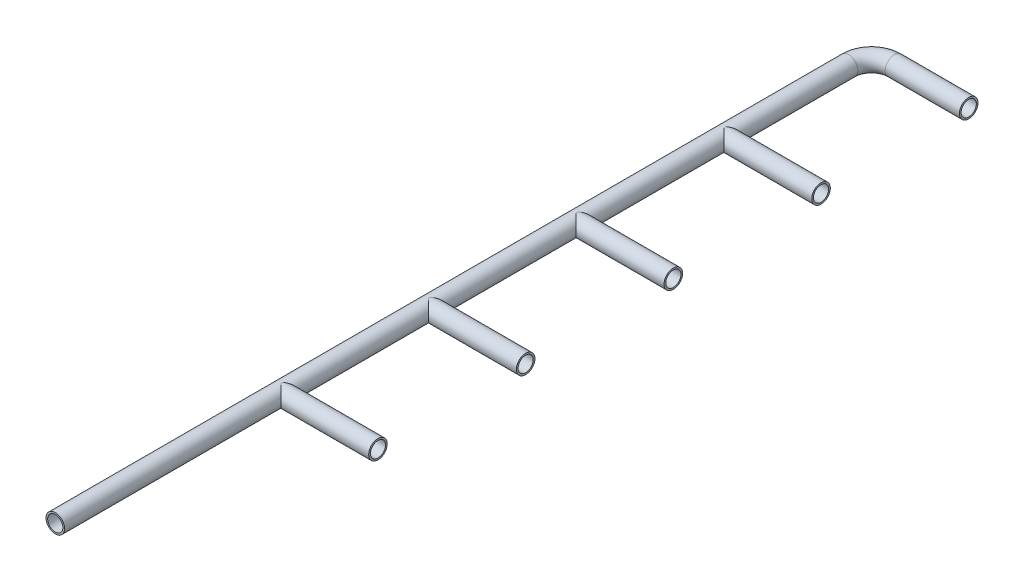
ISO-10303-21;
HEADER;
FILE_DESCRIPTION(('STEP AP214'),'2;1');
FILE_NAME('part.step','',(''),(''),'','','');
FILE_SCHEMA(('AUTOMOTIVE_DESIGN { 1 0 10303 214 1 1 1 1 }'));
ENDSEC;
DATA;
#1=APPLICATION_CONTEXT('core data for automotive mechanical design processes');
#2=APPLICATION_PROTOCOL_DEFINITION('international standard','automotive_design',2000,#1);
#3=PRODUCT_CONTEXT('',#1,'mechanical');
#4=PRODUCT('Part','Part','',(#3));
#5=PRODUCT_RELATED_PRODUCT_CATEGORY('part','',(#4));
#6=PRODUCT_DEFINITION_FORMATION('','',#4);
#7=PRODUCT_DEFINITION_CONTEXT('part definition',#1,'design');
#8=PRODUCT_DEFINITION('design','',#6,#7);
#9=PRODUCT_DEFINITION_SHAPE('','',#8);
#10=(LENGTH_UNIT() NAMED_UNIT(*) SI_UNIT(.MILLI.,.METRE.));
#11=(NAMED_UNIT(*) PLANE_ANGLE_UNIT() SI_UNIT($,.RADIAN.));
#12=(NAMED_UNIT(*) SI_UNIT($,.STERADIAN.) SOLID_ANGLE_UNIT());
#13=UNCERTAINTY_MEASURE_WITH_UNIT(LENGTH_MEASURE(1.E-05),#10,'distance_accuracy_value','');
#14=(GEOMETRIC_REPRESENTATION_CONTEXT(3) GLOBAL_UNCERTAINTY_ASSIGNED_CONTEXT((#13)) GLOBAL_UNIT_ASSIGNED_CONTEXT((#10,
#11,#12)) REPRESENTATION_CONTEXT('',''));
#15=CARTESIAN_POINT('',(0.,0.,0.));
#16=DIRECTION('',(0.,0.,1.));
#17=DIRECTION('',(1.,0.,0.));
#18=AXIS2_PLACEMENT_3D('',#15,#16,#17);
#19=CARTESIAN_POINT('',(44.,0.,175.));
#20=DIRECTION('',(-1.,0.,0.));
#21=DIRECTION('',(0.,0.,1.));
#22=AXIS2_PLACEMENT_3D('',#19,#20,#21);
#23=CYLINDRICAL_SURFACE('',#22,4.49999999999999);
#24=CARTESIAN_POINT('',(44.,0.,175.));
#25=DIRECTION('',(1.,0.,0.));
#26=DIRECTION('',(0.,0.,-1.));
#27=AXIS2_PLACEMENT_3D('',#24,#25,#26);
#28=CIRCLE('',#27,4.49999999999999);
#29=CARTESIAN_POINT('',(44.,0.,170.5));
#30=VERTEX_POINT('',#29);
#31=EDGE_CURVE('E44',#30,#30,#28,.T.);
#32=ORIENTED_EDGE('',*,*,#31,.T.);
#33=EDGE_LOOP('',(#32));
#34=FACE_BOUND('',#33,.T.);
#35=CARTESIAN_POINT('',(-8.09451225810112,0.,170.5));
#36=CARTESIAN_POINT('',(-8.09451286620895,-0.107379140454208,170.500000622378));
#37=CARTESIAN_POINT('',(-8.09766371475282,-0.214768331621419,170.503850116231));
#38=CARTESIAN_POINT('',(-8.11019615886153,-0.42867793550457,170.519180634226));
#39=CARTESIAN_POINT('',(-8.11958077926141,-0.535197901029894,170.53066536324));
#40=CARTESIAN_POINT('',(-8.14438291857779,-0.746615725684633,170.561082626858));
#41=CARTESIAN_POINT('',(-8.15980938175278,-0.851510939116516,170.580026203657));
#42=CARTESIAN_POINT('',(-8.19635944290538,-1.05878683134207,170.625045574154));
#43=CARTESIAN_POINT('',(-8.21748562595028,-1.16116634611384,170.651124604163));
#44=CARTESIAN_POINT('',(-8.2648335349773,-1.36201834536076,170.709804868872));
#45=CARTESIAN_POINT('',(-8.29101905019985,-1.46051293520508,170.742359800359));
#46=CARTESIAN_POINT('',(-8.34808554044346,-1.65383925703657,170.813659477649));
#47=CARTESIAN_POINT('',(-8.37896820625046,-1.74866965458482,170.852406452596));
#48=CARTESIAN_POINT('',(-8.47787144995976,-2.02698200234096,170.977237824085));
#49=CARTESIAN_POINT('',(-8.55219314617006,-2.2044733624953,171.071968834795));
#50=CARTESIAN_POINT('',(-8.68737451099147,-2.4872001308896,171.24739599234));
#51=CARTESIAN_POINT('',(-8.74493664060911,-2.59738857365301,171.322889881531));
#52=CARTESIAN_POINT('',(-8.86447017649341,-2.80917454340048,171.482037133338));
#53=CARTESIAN_POINT('',(-8.92644161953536,-2.91077199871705,171.56569056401));
#54=CARTESIAN_POINT('',(-9.05364976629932,-3.10550182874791,171.740696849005));
#55=CARTESIAN_POINT('',(-9.11889543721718,-3.19860874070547,171.832071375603));
#56=CARTESIAN_POINT('',(-9.2511179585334,-3.37596674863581,172.021795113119));
#57=CARTESIAN_POINT('',(-9.31809414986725,-3.46022115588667,172.120141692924));
#58=CARTESIAN_POINT('',(-9.45352282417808,-3.62125138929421,172.325332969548));
#59=CARTESIAN_POINT('',(-9.52198082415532,-3.69787289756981,172.432295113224));
#60=CARTESIAN_POINT('',(-9.65751631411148,-3.84185330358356,172.653182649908));
#61=CARTESIAN_POINT('',(-9.72459334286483,-3.90920914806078,172.767110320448));
#62=CARTESIAN_POINT('',(-9.85506361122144,-4.0341859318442,173.001758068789));
#63=CARTESIAN_POINT('',(-9.91846590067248,-4.09183151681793,173.122459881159));
#64=CARTESIAN_POINT('',(-10.0390166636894,-4.19700441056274,173.371089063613));
#65=CARTESIAN_POINT('',(-10.096170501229,-4.24454043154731,173.499010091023));
#66=CARTESIAN_POINT('',(-10.2070267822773,-4.333655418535,173.777971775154));
#67=CARTESIAN_POINT('',(-10.2595147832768,-4.37385803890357,173.9299545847));
#68=CARTESIAN_POINT('',(-10.346125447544,-4.43857924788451,174.242218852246));
#69=CARTESIAN_POINT('',(-10.3802938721,-4.46313694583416,174.40247852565));
#70=CARTESIAN_POINT('',(-10.4136923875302,-4.48693097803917,174.647403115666));
#71=CARTESIAN_POINT('',(-10.4218438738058,-4.49268326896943,174.73028973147));
#72=CARTESIAN_POINT('',(-10.4316324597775,-4.49958169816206,174.896654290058));
#73=CARTESIAN_POINT('',(-10.4332700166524,-4.50072815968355,174.980132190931));
#74=CARTESIAN_POINT('',(-10.4299235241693,-4.49837526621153,175.146901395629));
#75=CARTESIAN_POINT('',(-10.424938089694,-4.49487493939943,175.230192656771));
#76=CARTESIAN_POINT('',(-10.4086205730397,-4.48332386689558,175.395863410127));
#77=CARTESIAN_POINT('',(-10.3972851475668,-4.47527072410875,175.478242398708));
#78=CARTESIAN_POINT('',(-10.3671343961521,-4.45358445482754,175.651200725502));
#79=CARTESIAN_POINT('',(-10.3475866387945,-4.43939917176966,175.741582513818));
#80=CARTESIAN_POINT('',(-10.3023005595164,-4.40592067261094,175.919837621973));
#81=CARTESIAN_POINT('',(-10.2765577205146,-4.38662372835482,176.007709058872));
#82=CARTESIAN_POINT('',(-10.1916478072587,-4.32152347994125,176.267412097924));
#83=CARTESIAN_POINT('',(-10.1248642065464,-4.26855420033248,176.435003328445));
#84=CARTESIAN_POINT('',(-9.99578543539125,-4.15988119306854,176.721416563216));
#85=CARTESIAN_POINT('',(-9.93589811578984,-4.1075125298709,176.842688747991));
#86=CARTESIAN_POINT('',(-9.81166705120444,-3.99339376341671,177.078448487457));
#87=CARTESIAN_POINT('',(-9.74732096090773,-3.93163870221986,177.192932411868));
#88=CARTESIAN_POINT('',(-9.61634170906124,-3.79906062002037,177.415352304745));
#89=CARTESIAN_POINT('',(-9.5497057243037,-3.72822608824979,177.523279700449));
#90=CARTESIAN_POINT('',(-9.41600210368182,-3.57773467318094,177.732473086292));
#91=CARTESIAN_POINT('',(-9.34893454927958,-3.49807941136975,177.833740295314));
#92=CARTESIAN_POINT('',(-9.21325884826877,-3.32671380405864,178.033305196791));
#93=CARTESIAN_POINT('',(-9.14469290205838,-3.2346540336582,178.131332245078));
#94=CARTESIAN_POINT('',(-9.01022760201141,-3.0410901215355,178.31963941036));
#95=CARTESIAN_POINT('',(-8.944328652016,-2.93958455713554,178.409918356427));
#96=CARTESIAN_POINT('',(-8.81682151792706,-2.72744159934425,178.581849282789));
#97=CARTESIAN_POINT('',(-8.75520377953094,-2.61682582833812,178.66352069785));
#98=CARTESIAN_POINT('',(-8.63757466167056,-2.38652932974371,178.817551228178));
#99=CARTESIAN_POINT('',(-8.58156327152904,-2.26684861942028,178.889910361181));
#100=CARTESIAN_POINT('',(-8.45258737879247,-1.96189099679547,179.055015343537));
#101=CARTESIAN_POINT('',(-8.38357678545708,-1.7716363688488,179.141961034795));
#102=CARTESIAN_POINT('',(-8.29490400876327,-1.47474820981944,179.252802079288));
#103=CARTESIAN_POINT('',(-8.26781579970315,-1.37384354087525,179.286491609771));
#104=CARTESIAN_POINT('',(-8.21908509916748,-1.16870441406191,179.346899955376));
#105=CARTESIAN_POINT('',(-8.19743997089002,-1.06447159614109,179.373622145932));
#106=CARTESIAN_POINT('',(-8.15992590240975,-0.852602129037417,179.419831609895));
#107=CARTESIAN_POINT('',(-8.14409852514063,-0.744946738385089,179.439266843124));
#108=CARTESIAN_POINT('',(-8.11880697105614,-0.527815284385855,179.470282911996));
#109=CARTESIAN_POINT('',(-8.10933984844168,-0.418340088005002,179.481867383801));
#110=CARTESIAN_POINT('',(-8.096991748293,-0.198471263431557,179.496971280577));
#111=CARTESIAN_POINT('',(-8.0941102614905,-0.0880777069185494,179.500491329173));
#112=CARTESIAN_POINT('',(-8.09500450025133,0.13263546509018,179.4993983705));
#113=CARTESIAN_POINT('',(-8.09877971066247,0.242955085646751,179.494785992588));
#114=CARTESIAN_POINT('',(-8.11217768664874,0.451426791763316,179.478393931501));
#115=CARTESIAN_POINT('',(-8.12117055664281,0.549681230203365,179.467386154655));
#116=CARTESIAN_POINT('',(-8.14427204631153,0.744675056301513,179.439052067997));
#117=CARTESIAN_POINT('',(-8.15838228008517,0.841413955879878,179.421723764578));
#118=CARTESIAN_POINT('',(-8.20801420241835,1.12836191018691,179.360612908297));
#119=CARTESIAN_POINT('',(-8.25084847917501,1.31546948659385,179.307690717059));
#120=CARTESIAN_POINT('',(-8.35501831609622,1.68400246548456,179.17778092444));
#121=CARTESIAN_POINT('',(-8.41699513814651,1.86494167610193,179.099955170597));
#122=CARTESIAN_POINT('',(-8.55502836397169,2.2109496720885,178.924202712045));
#123=CARTESIAN_POINT('',(-8.63108872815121,2.37601397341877,178.826270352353));
#124=CARTESIAN_POINT('',(-8.77117400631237,2.6460966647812,178.642402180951));
#125=CARTESIAN_POINT('',(-8.83279869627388,2.75518794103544,178.560514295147));
#126=CARTESIAN_POINT('',(-8.96001272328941,2.96418085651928,178.388501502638));
#127=CARTESIAN_POINT('',(-9.0256021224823,3.06408235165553,178.29837646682));
#128=CARTESIAN_POINT('',(-9.15957181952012,3.25498997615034,178.110158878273));
#129=CARTESIAN_POINT('',(-9.22796236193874,3.34595836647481,178.012035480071));
#130=CARTESIAN_POINT('',(-9.36574021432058,3.51847465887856,177.808579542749));
#131=CARTESIAN_POINT('',(-9.43512708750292,3.60002655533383,177.703250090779));
#132=CARTESIAN_POINT('',(-9.57441583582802,3.75497743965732,177.483648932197));
#133=CARTESIAN_POINT('',(-9.64430650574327,3.82821480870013,177.369255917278));
#134=CARTESIAN_POINT('',(-9.78133118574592,3.96471949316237,177.132985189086));
#135=CARTESIAN_POINT('',(-9.84846385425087,4.02798199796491,177.01110390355));
#136=CARTESIAN_POINT('',(-9.97694288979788,4.14374569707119,176.760217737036));
#137=CARTESIAN_POINT('',(-10.0383150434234,4.19629621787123,176.631249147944));
#138=CARTESIAN_POINT('',(-10.1520631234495,4.29010168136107,176.365590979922));
#139=CARTESIAN_POINT('',(-10.204450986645,4.33137165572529,176.228911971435));
#140=CARTESIAN_POINT('',(-10.2976432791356,4.40275510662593,175.942506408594));
#141=CARTESIAN_POINT('',(-10.3379270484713,4.43238059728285,175.792480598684));
#142=CARTESIAN_POINT('',(-10.398528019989,4.47628637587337,175.486446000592));
#143=CARTESIAN_POINT('',(-10.4188947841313,4.4906047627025,175.330453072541));
#144=CARTESIAN_POINT('',(-10.4361162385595,4.50274130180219,175.015562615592));
#145=CARTESIAN_POINT('',(-10.4328385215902,4.5004665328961,174.856653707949));
#146=CARTESIAN_POINT('',(-10.4031100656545,4.4794235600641,174.542035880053));
#147=CARTESIAN_POINT('',(-10.3766212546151,4.46062825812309,174.386332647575));
#148=CARTESIAN_POINT('',(-10.2947037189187,4.40050737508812,174.038139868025));
#149=CARTESIAN_POINT('',(-10.2331276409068,4.35424369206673,173.848008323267));
#150=CARTESIAN_POINT('',(-10.0907253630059,4.24048840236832,173.481676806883));
#151=CARTESIAN_POINT('',(-10.0098395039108,4.1729307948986,173.305522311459));
#152=CARTESIAN_POINT('',(-9.85917538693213,4.03792960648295,173.008843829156));
#153=CARTESIAN_POINT('',(-9.79156600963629,3.97455375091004,172.885301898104));
#154=CARTESIAN_POINT('',(-9.6533334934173,3.83752201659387,172.645752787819));
#155=CARTESIAN_POINT('',(-9.58270899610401,3.7638614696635,172.52974906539));
#156=CARTESIAN_POINT('',(-9.44062713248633,3.60645285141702,172.3051307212));
#157=CARTESIAN_POINT('',(-9.369168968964,3.52269426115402,172.196523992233));
#158=CARTESIAN_POINT('',(-9.22734046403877,3.34525190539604,171.987006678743));
#159=CARTESIAN_POINT('',(-9.15696993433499,3.25156988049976,171.886094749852));
#160=CARTESIAN_POINT('',(-9.01779403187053,3.0526438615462,171.690752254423));
#161=CARTESIAN_POINT('',(-8.94903487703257,2.94723193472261,171.596459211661));
#162=CARTESIAN_POINT('',(-8.81598511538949,2.72622721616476,171.416992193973));
#163=CARTESIAN_POINT('',(-8.75169532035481,2.61063258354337,171.331819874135));
#164=CARTESIAN_POINT('',(-8.6294274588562,2.369835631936,171.171851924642));
#165=CARTESIAN_POINT('',(-8.57143345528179,2.24465900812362,171.097029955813));
#166=CARTESIAN_POINT('',(-8.46328230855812,1.98499981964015,170.958790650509));
#167=CARTESIAN_POINT('',(-8.41312013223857,1.85052331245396,170.895365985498));
#168=CARTESIAN_POINT('',(-8.33763823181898,1.62006923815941,170.800566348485));
#169=CARTESIAN_POINT('',(-8.3096492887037,1.52642366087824,170.765600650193));
#170=CARTESIAN_POINT('',(-8.25830017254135,1.33587693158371,170.701683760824));
#171=CARTESIAN_POINT('',(-8.23493874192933,1.23897667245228,170.672730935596));
#172=CARTESIAN_POINT('',(-8.19330996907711,1.04262454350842,170.621277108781));
#173=CARTESIAN_POINT('',(-8.17503226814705,0.943178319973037,170.598762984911));
#174=CARTESIAN_POINT('',(-8.14387268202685,0.742200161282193,170.560450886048));
#175=CARTESIAN_POINT('',(-8.13098860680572,0.640669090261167,170.544650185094));
#176=CARTESIAN_POINT('',(-8.11217499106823,0.449424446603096,170.521600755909));
#177=CARTESIAN_POINT('',(-8.10556212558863,0.359878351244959,170.513511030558));
#178=CARTESIAN_POINT('',(-8.09672995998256,0.180223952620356,170.502709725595));
#179=CARTESIAN_POINT('',(-8.09451174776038,0.0901155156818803,170.499999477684));
#180=CARTESIAN_POINT('',(-8.09451225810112,0.,170.5));
#181=B_SPLINE_CURVE_WITH_KNOTS('',3,(#35,#36,#37,#38,#39,#40,#41,#42,#43,#44,#45,#46,#47,#48,
#49,#50,#51,#52,#53,#54,#55,#56,#57,#58,#59,#60,#61,#62,#63,#64,#65,#66,#67,#68,#69,#70,#71,#72,
#73,#74,#75,#76,#77,#78,#79,#80,#81,#82,#83,#84,#85,#86,#87,#88,#89,#90,#91,#92,#93,#94,#95,#96,
#97,#98,#99,#100,#101,#102,#103,#104,#105,#106,#107,#108,#109,#110,#111,#112,#113,#114,#115,
#116,#117,#118,#119,#120,#121,#122,#123,#124,#125,#126,#127,#128,#129,#130,#131,#132,#133,#134,
#135,#136,#137,#138,#139,#140,#141,#142,#143,#144,#145,#146,#147,#148,#149,#150,#151,#152,#153,
#154,#155,#156,#157,#158,#159,#160,#161,#162,#163,#164,#165,#166,#167,#168,#169,#170,#171,#172,
#173,#174,#175,#176,#177,#178,#179,#180),.UNSPECIFIED.,.T.,.F.,(4,2,2,2,2,2,2,2,2,2,2,2,2,2,2,2,
2,2,2,2,2,2,2,2,2,2,2,2,2,2,2,2,2,2,2,2,2,2,2,2,2,2,2,2,2,2,2,2,2,2,2,2,2,2,2,2,2,2,2,2,2,2,2,2,
2,2,2,2,2,2,2,2,4),(0.,0.322040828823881,0.644238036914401,0.966914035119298,1.28973662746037,
1.61032900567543,1.93103705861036,2.57185439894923,3.00770706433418,3.44356336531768,
3.88068651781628,4.31764557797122,4.76215233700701,5.20680522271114,5.65031194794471,
6.09343490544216,6.58914307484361,7.08360715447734,7.33372842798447,7.5838321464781,
7.83398817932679,8.08427604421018,8.36449723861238,8.64492337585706,9.20677772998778,
9.64140846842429,10.0762695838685,10.5116875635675,10.9470256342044,11.3993741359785,
11.8517908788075,12.303163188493,12.7545346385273,13.4122297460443,13.7412269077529,
14.0700643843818,14.4012074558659,14.7321970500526,15.0631610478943,15.3940994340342,
15.6915739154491,15.989142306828,16.5837805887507,17.2010176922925,17.8184286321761,
18.266926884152,18.7154321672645,19.1657573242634,19.6158907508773,20.0736538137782,
20.5316369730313,20.9874610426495,21.4426747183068,21.9153279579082,22.3868020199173,
22.8609183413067,23.3358137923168,23.9478178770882,24.5617378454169,25.024495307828,
25.4874635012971,25.9509181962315,26.4142917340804,26.8854572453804,27.356708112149,
27.8267367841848,28.2964621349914,28.6075863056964,28.9186258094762,29.229026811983,
29.5393016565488,29.8095002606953,30.0797657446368),.UNSPECIFIED.);
#182=CARTESIAN_POINT('',(-8.09451225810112,0.,170.5));
#183=VERTEX_POINT('',#182);
#184=EDGE_CURVE('E547',#183,#183,#181,.T.);
#185=ORIENTED_EDGE('',*,*,#184,.T.);
#186=EDGE_LOOP('',(#185));
#187=FACE_BOUND('',#186,.T.);
#188=ADVANCED_FACE('F37',(#34,#187),#23,.F.);
#189=CARTESIAN_POINT('',(44.,0.,175.));
#190=DIRECTION('',(-1.,0.,0.));
#191=DIRECTION('',(0.,0.,1.));
#192=AXIS2_PLACEMENT_3D('',#189,#190,#191);
#193=CYLINDRICAL_SURFACE('',#192,5.50000000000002);
#194=CARTESIAN_POINT('',(44.,0.,175.));
#195=DIRECTION('',(1.,0.,0.));
#196=DIRECTION('',(0.,0.,-1.));
#197=AXIS2_PLACEMENT_3D('',#194,#195,#196);
#198=CIRCLE('',#197,5.50000000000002);
#199=CARTESIAN_POINT('',(44.,0.,169.5));
#200=VERTEX_POINT('',#199);
#201=EDGE_CURVE('E11',#200,#200,#198,.T.);
#202=ORIENTED_EDGE('',*,*,#201,.F.);
#203=EDGE_LOOP('',(#202));
#204=FACE_BOUND('',#203,.T.);
#205=CARTESIAN_POINT('',(-13.5945122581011,0.,175.));
#206=DIRECTION('',(0.707106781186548,0.,-0.707106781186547));
#207=DIRECTION('',(-0.707106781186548,0.,-0.707106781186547));
#208=AXIS2_PLACEMENT_3D('',#205,#206,#207);
#209=ELLIPSE('',#208,7.77817459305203,5.5);
#210=CARTESIAN_POINT('',(-13.,-5.4677742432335,175.594512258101));
#211=VERTEX_POINT('',#210);
#212=CARTESIAN_POINT('',(-13.,5.46777424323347,175.594512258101));
#213=VERTEX_POINT('',#212);
#214=EDGE_CURVE('E551',#211,#213,#209,.F.);
#215=ORIENTED_EDGE('',*,*,#214,.F.);
#216=CARTESIAN_POINT('',(-13.,0.,175.));
#217=DIRECTION('',(1.,0.,0.));
#218=DIRECTION('',(0.,0.,-1.));
#219=AXIS2_PLACEMENT_3D('',#216,#217,#218);
#220=CIRCLE('',#219,5.50000000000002);
#221=CARTESIAN_POINT('',(-13.,-5.4677742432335,174.405487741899));
#222=VERTEX_POINT('',#221);
#223=EDGE_CURVE('E701',#211,#222,#220,.T.);
#224=ORIENTED_EDGE('',*,*,#223,.T.);
#225=CARTESIAN_POINT('',(-13.5945122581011,0.,175.));
#226=DIRECTION('',(-0.707106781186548,0.,-0.707106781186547));
#227=DIRECTION('',(0.707106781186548,0.,-0.707106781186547));
#228=AXIS2_PLACEMENT_3D('',#225,#226,#227);
#229=ELLIPSE('',#228,7.77817459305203,5.5);
#230=CARTESIAN_POINT('',(-13.,5.46777424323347,174.405487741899));
#231=VERTEX_POINT('',#230);
#232=EDGE_CURVE('E695',#231,#222,#229,.T.);
#233=ORIENTED_EDGE('',*,*,#232,.F.);
#234=EDGE_CURVE('E205',#231,#213,#220,.T.);
#235=ORIENTED_EDGE('',*,*,#234,.T.);
#236=EDGE_LOOP('',(#215,#224,#233,#235));
#237=FACE_BOUND('',#236,.T.);
#238=ADVANCED_FACE('F535',(#204,#237),#193,.T.);
#239=CARTESIAN_POINT('',(44.,0.,0.));
#240=DIRECTION('',(1.,0.,0.));
#241=DIRECTION('',(0.,0.,-1.));
#242=AXIS2_PLACEMENT_3D('',#239,#240,#241);
#243=PLANE('',#242);
#244=ORIENTED_EDGE('',*,*,#31,.F.);
#245=EDGE_LOOP('',(#244));
#246=FACE_BOUND('',#245,.T.);
#247=ORIENTED_EDGE('',*,*,#201,.T.);
#248=EDGE_LOOP('',(#247));
#249=FACE_BOUND('',#248,.T.);
#250=ADVANCED_FACE('F540',(#246,#249),#243,.T.);
#251=CARTESIAN_POINT('',(-13.5945122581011,0.,396.094512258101));
#252=DIRECTION('',(0.,0.,-1.));
#253=DIRECTION('',(-1.,0.,0.));
#254=AXIS2_PLACEMENT_3D('',#251,#252,#253);
#255=CYLINDRICAL_SURFACE('',#254,5.49999999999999);
#256=ORIENTED_EDGE('',*,*,#184,.F.);
#257=EDGE_LOOP('',(#256));
#258=FACE_BOUND('',#257,.T.);
#259=ADVANCED_FACE('F298',(#258),#255,.T.);
#260=CARTESIAN_POINT('',(-13.5945122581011,0.,396.094512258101));
#261=DIRECTION('',(0.,0.,-1.));
#262=DIRECTION('',(-1.,0.,0.));
#263=AXIS2_PLACEMENT_3D('',#260,#261,#262);
#264=CYLINDRICAL_SURFACE('',#263,4.5);
#265=CARTESIAN_POINT('',(-13.,-4.46055547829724,178.217676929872));
#266=CARTESIAN_POINT('',(-12.8806070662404,-4.44465049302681,178.239708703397));
#267=CARTESIAN_POINT('',(-12.7632286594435,-4.42412168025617,178.267848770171));
#268=CARTESIAN_POINT('',(-12.5334793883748,-4.37469294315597,178.333731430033));
#269=CARTESIAN_POINT('',(-12.4210911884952,-4.34582512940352,178.371437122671));
#270=CARTESIAN_POINT('',(-12.2022568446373,-4.28072137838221,178.453714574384));
#271=CARTESIAN_POINT('',(-12.0957706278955,-4.2445457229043,178.498229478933));
#272=CARTESIAN_POINT('',(-11.8876274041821,-4.16520806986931,178.592330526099));
#273=CARTESIAN_POINT('',(-11.7859762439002,-4.12203787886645,178.641922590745));
#274=CARTESIAN_POINT('',(-11.5590339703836,-4.01580864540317,178.759147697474));
#275=CARTESIAN_POINT('',(-11.4353185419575,-3.95059562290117,178.827877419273));
#276=CARTESIAN_POINT('',(-11.1956119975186,-3.80980251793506,178.968033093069));
#277=CARTESIAN_POINT('',(-11.0796207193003,-3.73422265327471,179.039458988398));
#278=CARTESIAN_POINT('',(-10.8548080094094,-3.57257030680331,179.183118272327));
#279=CARTESIAN_POINT('',(-10.7460175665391,-3.48645651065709,179.255353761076));
#280=CARTESIAN_POINT('',(-10.5363829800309,-3.3041099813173,179.398443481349));
#281=CARTESIAN_POINT('',(-10.4355373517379,-3.2078791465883,179.469297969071));
#282=CARTESIAN_POINT('',(-10.17518604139,-2.93503330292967,179.656040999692));
#283=CARTESIAN_POINT('',(-10.023412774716,-2.7488960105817,179.769141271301));
#284=CARTESIAN_POINT('',(-9.74847359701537,-2.34875665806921,179.978368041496));
#285=CARTESIAN_POINT('',(-9.62522575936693,-2.13483722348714,180.074542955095));
#286=CARTESIAN_POINT('',(-9.43320384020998,-1.72466349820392,180.226253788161));
#287=CARTESIAN_POINT('',(-9.35852602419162,-1.53280022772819,180.286040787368));
#288=CARTESIAN_POINT('',(-9.26610915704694,-1.23521819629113,180.360480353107));
#289=CARTESIAN_POINT('',(-9.23856313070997,-1.13435096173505,180.382759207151));
#290=CARTESIAN_POINT('',(-9.19040030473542,-0.929947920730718,180.42180788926));
#291=CARTESIAN_POINT('',(-9.16978061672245,-0.82641324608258,180.438580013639));
#292=CARTESIAN_POINT('',(-9.13571420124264,-0.616812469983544,180.466331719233));
#293=CARTESIAN_POINT('',(-9.12230722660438,-0.510735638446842,180.477279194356));
#294=CARTESIAN_POINT('',(-9.10308052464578,-0.297482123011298,180.4929889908));
#295=CARTESIAN_POINT('',(-9.09725759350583,-0.1903059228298,180.497753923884));
#296=CARTESIAN_POINT('',(-9.0932983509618,0.0242837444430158,180.500993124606));
#297=CARTESIAN_POINT('',(-9.09516204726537,0.131697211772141,180.499467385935));
#298=CARTESIAN_POINT('',(-9.10654033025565,0.345838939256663,180.490162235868));
#299=CARTESIAN_POINT('',(-9.11605453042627,0.452567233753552,180.482383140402));
#300=CARTESIAN_POINT('',(-9.14147445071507,0.655793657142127,180.461638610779));
#301=CARTESIAN_POINT('',(-9.15679381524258,0.752414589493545,180.449149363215));
#302=CARTESIAN_POINT('',(-9.19350600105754,0.943741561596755,180.419293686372));
#303=CARTESIAN_POINT('',(-9.21490085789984,1.03844694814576,180.401925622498));
#304=CARTESIAN_POINT('',(-9.28778189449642,1.31881929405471,180.342948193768));
#305=CARTESIAN_POINT('',(-9.34798097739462,1.50086999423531,180.294452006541));
#306=CARTESIAN_POINT('',(-9.49353165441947,1.86353483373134,180.178415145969));
#307=CARTESIAN_POINT('',(-9.58030718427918,2.04322188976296,180.10980961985));
#308=CARTESIAN_POINT('',(-9.77368046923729,2.38534417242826,179.959341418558));
#309=CARTESIAN_POINT('',(-9.88027570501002,2.54778158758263,179.877480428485));
#310=CARTESIAN_POINT('',(-10.1329322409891,2.88444321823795,179.687670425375));
#311=CARTESIAN_POINT('',(-10.2826367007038,3.05480308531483,179.577745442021));
#312=CARTESIAN_POINT('',(-10.6037327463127,3.36987902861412,179.351054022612));
#313=CARTESIAN_POINT('',(-10.7752042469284,3.51449563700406,179.234263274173));
#314=CARTESIAN_POINT('',(-11.0678184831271,3.72620908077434,179.046844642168));
#315=CARTESIAN_POINT('',(-11.1827769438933,3.80165516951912,178.975832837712));
#316=CARTESIAN_POINT('',(-11.4204009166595,3.94237546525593,178.836336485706));
#317=CARTESIAN_POINT('',(-11.5430714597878,4.00764293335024,178.767853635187));
#318=CARTESIAN_POINT('',(-11.7953890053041,4.12704558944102,178.636661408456));
#319=CARTESIAN_POINT('',(-11.9249806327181,4.18125612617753,178.573914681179));
#320=CARTESIAN_POINT('',(-12.1920531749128,4.27822809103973,178.457239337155));
#321=CARTESIAN_POINT('',(-12.3295205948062,4.3210084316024,178.403296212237));
#322=CARTESIAN_POINT('',(-12.5562560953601,4.37947415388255,178.327390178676));
#323=CARTESIAN_POINT('',(-12.6430769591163,4.39918305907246,178.301218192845));
#324=CARTESIAN_POINT('',(-12.819552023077,4.43368502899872,178.254728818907));
#325=CARTESIAN_POINT('',(-12.9092151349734,4.44846051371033,178.234432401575));
#326=CARTESIAN_POINT('',(-13.,4.46055547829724,178.217676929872));
#327=B_SPLINE_CURVE_WITH_KNOTS('',3,(#265,#266,#267,#268,#269,#270,#271,#272,#273,#274,#275,
#276,#277,#278,#279,#280,#281,#282,#283,#284,#285,#286,#287,#288,#289,#290,#291,#292,#293,#294,
#295,#296,#297,#298,#299,#300,#301,#302,#303,#304,#305,#306,#307,#308,#309,#310,#311,#312,#313,
#314,#315,#316,#317,#318,#319,#320,#321,#322,#323,#324,#325,#326),.UNSPECIFIED.,.F.,.F.,(4,2,2,
2,2,2,2,2,2,2,2,2,2,2,2,2,2,2,2,2,2,2,2,2,2,2,2,2,2,2,4),(0.,0.366704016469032,
0.732014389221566,1.09442611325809,1.457265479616,1.92410837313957,2.39094145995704,
2.85966800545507,3.32830675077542,4.12143936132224,4.91226497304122,5.55252455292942,
5.87290911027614,6.19315989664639,6.51515811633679,6.83702026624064,7.15888273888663,
7.48072895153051,7.77625351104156,8.07187720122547,8.66274108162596,9.29350296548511,
9.92418472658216,10.6776791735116,11.4340246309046,11.8978444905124,12.3619701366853,
12.8228186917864,13.2828999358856,13.560963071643,13.8400067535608),.UNSPECIFIED.);
#328=CARTESIAN_POINT('',(-13.,-4.46055547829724,178.217676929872));
#329=VERTEX_POINT('',#328);
#330=CARTESIAN_POINT('',(-13.,4.46055547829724,178.217676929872));
#331=VERTEX_POINT('',#330);
#332=EDGE_CURVE('E222',#329,#331,#327,.T.);
#333=ORIENTED_EDGE('',*,*,#332,.F.);
#334=DIRECTION('',(0.,0.,-1.));
#335=VECTOR('',#334,1.);
#336=CARTESIAN_POINT('',(-13.,-4.46055547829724,396.094512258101));
#337=LINE('',#336,#335);
#338=CARTESIAN_POINT('',(-13.,-4.46055547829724,175.594512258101));
#339=VERTEX_POINT('',#338);
#340=EDGE_CURVE('E214',#329,#339,#337,.T.);
#341=ORIENTED_EDGE('',*,*,#340,.T.);
#342=CARTESIAN_POINT('',(-13.5945122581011,0.,175.));
#343=DIRECTION('',(0.707106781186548,0.,-0.707106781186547));
#344=DIRECTION('',(-0.707106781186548,0.,-0.707106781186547));
#345=AXIS2_PLACEMENT_3D('',#342,#343,#344);
#346=ELLIPSE('',#345,6.36396103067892,4.5);
#347=CARTESIAN_POINT('',(-13.,4.46055547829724,175.594512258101));
#348=VERTEX_POINT('',#347);
#349=EDGE_CURVE('E209',#339,#348,#346,.F.);
#350=ORIENTED_EDGE('',*,*,#349,.T.);
#351=DIRECTION('',(0.,0.,-1.));
#352=VECTOR('',#351,1.);
#353=CARTESIAN_POINT('',(-13.,4.46055547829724,396.094512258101));
#354=LINE('',#353,#352);
#355=EDGE_CURVE('E196',#348,#331,#354,.F.);
#356=ORIENTED_EDGE('',*,*,#355,.T.);
#357=EDGE_LOOP('',(#333,#341,#350,#356));
#358=FACE_BOUND('',#357,.T.);
#359=CARTESIAN_POINT('',(-13.,-4.46055547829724,3.21767692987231));
#360=CARTESIAN_POINT('',(-12.8806070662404,-4.44465049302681,3.23970870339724));
#361=CARTESIAN_POINT('',(-12.7632286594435,-4.42412168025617,3.26784877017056));
#362=CARTESIAN_POINT('',(-12.5334793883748,-4.37469294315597,3.33373143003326));
#363=CARTESIAN_POINT('',(-12.4210911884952,-4.34582512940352,3.37143712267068));
#364=CARTESIAN_POINT('',(-12.2022568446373,-4.28072137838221,3.45371457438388));
#365=CARTESIAN_POINT('',(-12.0957706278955,-4.2445457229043,3.49822947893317));
#366=CARTESIAN_POINT('',(-11.8876274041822,-4.16520806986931,3.59233052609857));
#367=CARTESIAN_POINT('',(-11.7859762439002,-4.12203787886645,3.6419225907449));
#368=CARTESIAN_POINT('',(-11.5590339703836,-4.01580864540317,3.75914769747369));
#369=CARTESIAN_POINT('',(-11.4353185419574,-3.95059562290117,3.82787741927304));
#370=CARTESIAN_POINT('',(-11.1956119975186,-3.80980251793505,3.96803309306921));
#371=CARTESIAN_POINT('',(-11.0796207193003,-3.73422265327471,4.03945898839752));
#372=CARTESIAN_POINT('',(-10.8548080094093,-3.57257030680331,4.18311827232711));
#373=CARTESIAN_POINT('',(-10.7460175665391,-3.48645651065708,4.25535376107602));
#374=CARTESIAN_POINT('',(-10.5363829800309,-3.3041099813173,4.39844348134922));
#375=CARTESIAN_POINT('',(-10.4355373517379,-3.20787914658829,4.46929796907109));
#376=CARTESIAN_POINT('',(-10.1751860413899,-2.93503330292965,4.65604099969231));
#377=CARTESIAN_POINT('',(-10.023412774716,-2.74889601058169,4.7691412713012));
#378=CARTESIAN_POINT('',(-9.74847359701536,-2.3487566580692,4.97836804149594));
#379=CARTESIAN_POINT('',(-9.62522575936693,-2.13483722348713,5.07454295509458));
#380=CARTESIAN_POINT('',(-9.43320384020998,-1.72466349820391,5.22625378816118));
#381=CARTESIAN_POINT('',(-9.35852602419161,-1.53280022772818,5.28604078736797));
#382=CARTESIAN_POINT('',(-9.26610915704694,-1.23521819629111,5.3604803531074));
#383=CARTESIAN_POINT('',(-9.23856313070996,-1.13435096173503,5.38275920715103));
#384=CARTESIAN_POINT('',(-9.19040030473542,-0.929947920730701,5.42180788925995));
#385=CARTESIAN_POINT('',(-9.16978061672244,-0.826413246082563,5.43858001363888));
#386=CARTESIAN_POINT('',(-9.13571420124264,-0.616812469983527,5.46633171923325));
#387=CARTESIAN_POINT('',(-9.12230722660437,-0.510735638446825,5.47727919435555));
#388=CARTESIAN_POINT('',(-9.10308052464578,-0.297482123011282,5.49298899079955));
#389=CARTESIAN_POINT('',(-9.09725759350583,-0.190305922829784,5.49775392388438));
#390=CARTESIAN_POINT('',(-9.0932983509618,0.0242837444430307,5.50099312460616));
#391=CARTESIAN_POINT('',(-9.09516204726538,0.131697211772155,5.49946738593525));
#392=CARTESIAN_POINT('',(-9.10654033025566,0.345838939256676,5.49016223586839));
#393=CARTESIAN_POINT('',(-9.11605453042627,0.452567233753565,5.48238314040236));
#394=CARTESIAN_POINT('',(-9.14147445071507,0.655793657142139,5.46163861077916));
#395=CARTESIAN_POINT('',(-9.15679381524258,0.752414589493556,5.4491493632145));
#396=CARTESIAN_POINT('',(-9.19350600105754,0.943741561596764,5.41929368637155));
#397=CARTESIAN_POINT('',(-9.21490085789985,1.03844694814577,5.40192562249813));
#398=CARTESIAN_POINT('',(-9.28778189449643,1.31881929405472,5.34294819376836));
#399=CARTESIAN_POINT('',(-9.34798097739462,1.50086999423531,5.29445200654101));
#400=CARTESIAN_POINT('',(-9.49353165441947,1.86353483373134,5.17841514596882));
#401=CARTESIAN_POINT('',(-9.58030718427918,2.04322188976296,5.10980961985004));
#402=CARTESIAN_POINT('',(-9.77368046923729,2.38534417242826,4.9593414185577));
#403=CARTESIAN_POINT('',(-9.88027570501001,2.54778158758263,4.87748042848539));
#404=CARTESIAN_POINT('',(-10.1329322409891,2.88444321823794,4.68767042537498));
#405=CARTESIAN_POINT('',(-10.2826367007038,3.05480308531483,4.57774544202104));
#406=CARTESIAN_POINT('',(-10.6037327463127,3.36987902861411,4.35105402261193));
#407=CARTESIAN_POINT('',(-10.7752042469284,3.51449563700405,4.23426327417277));
#408=CARTESIAN_POINT('',(-11.0678184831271,3.72620908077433,4.04684464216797));
#409=CARTESIAN_POINT('',(-11.1827769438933,3.80165516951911,3.97583283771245));
#410=CARTESIAN_POINT('',(-11.4204009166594,3.94237546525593,3.83633648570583));
#411=CARTESIAN_POINT('',(-11.5430714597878,4.00764293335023,3.7678536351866));
#412=CARTESIAN_POINT('',(-11.7953890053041,4.12704558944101,3.63666140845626));
#413=CARTESIAN_POINT('',(-11.924980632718,4.18125612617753,3.57391468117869));
#414=CARTESIAN_POINT('',(-12.1920531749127,4.27822809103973,3.45723933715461));
#415=CARTESIAN_POINT('',(-12.3295205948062,4.3210084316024,3.40329621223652));
#416=CARTESIAN_POINT('',(-12.55625609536,4.37947415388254,3.32739017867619));
#417=CARTESIAN_POINT('',(-12.6430769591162,4.39918305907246,3.30121819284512));
#418=CARTESIAN_POINT('',(-12.819552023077,4.43368502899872,3.25472881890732));
#419=CARTESIAN_POINT('',(-12.9092151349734,4.44846051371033,3.23443240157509));
#420=CARTESIAN_POINT('',(-13.,4.46055547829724,3.21767692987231));
#421=B_SPLINE_CURVE_WITH_KNOTS('',3,(#359,#360,#361,#362,#363,#364,#365,#366,#367,#368,#369,
#370,#371,#372,#373,#374,#375,#376,#377,#378,#379,#380,#381,#382,#383,#384,#385,#386,#387,#388,
#389,#390,#391,#392,#393,#394,#395,#396,#397,#398,#399,#400,#401,#402,#403,#404,#405,#406,#407,
#408,#409,#410,#411,#412,#413,#414,#415,#416,#417,#418,#419,#420),.UNSPECIFIED.,.F.,.F.,(4,2,2,
2,2,2,2,2,2,2,2,2,2,2,2,2,2,2,2,2,2,2,2,2,2,2,2,2,2,2,4),(0.,0.366704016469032,
0.732014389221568,1.09442611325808,1.45726547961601,1.92410837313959,2.39094145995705,
2.85966800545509,3.32830675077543,4.12143936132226,4.91226497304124,5.55252455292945,
5.87290911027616,6.19315989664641,6.51515811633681,6.83702026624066,7.15888273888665,
7.48072895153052,7.77625351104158,8.07187720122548,8.66274108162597,9.29350296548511,
9.92418472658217,10.6776791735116,11.4340246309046,11.8978444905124,12.3619701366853,
12.8228186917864,13.2828999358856,13.560963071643,13.8400067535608),.UNSPECIFIED.);
#422=CARTESIAN_POINT('',(-13.,-4.46055547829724,3.21767692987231));
#423=VERTEX_POINT('',#422);
#424=CARTESIAN_POINT('',(-13.,4.46055547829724,3.21767692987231));
#425=VERTEX_POINT('',#424);
#426=EDGE_CURVE('E251',#423,#425,#421,.T.);
#427=ORIENTED_EDGE('',*,*,#426,.F.);
#428=DIRECTION('',(0.,0.,-1.));
#429=VECTOR('',#428,1.);
#430=CARTESIAN_POINT('',(-13.,-4.46055547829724,396.094512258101));
#431=LINE('',#430,#429);
#432=CARTESIAN_POINT('',(-13.,-4.46055547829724,0.594512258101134));
#433=VERTEX_POINT('',#432);
#434=EDGE_CURVE('E243',#423,#433,#431,.T.);
#435=ORIENTED_EDGE('',*,*,#434,.T.);
#436=CARTESIAN_POINT('',(-13.5945122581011,0.,0.));
#437=DIRECTION('',(0.707106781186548,0.,-0.707106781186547));
#438=DIRECTION('',(-0.707106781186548,0.,-0.707106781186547));
#439=AXIS2_PLACEMENT_3D('',#436,#437,#438);
#440=ELLIPSE('',#439,6.36396103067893,4.5);
#441=CARTESIAN_POINT('',(-13.,4.46055547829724,0.594512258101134));
#442=VERTEX_POINT('',#441);
#443=EDGE_CURVE('E506',#433,#442,#440,.F.);
#444=ORIENTED_EDGE('',*,*,#443,.T.);
#445=DIRECTION('',(0.,0.,-1.));
#446=VECTOR('',#445,1.);
#447=CARTESIAN_POINT('',(-13.,4.46055547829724,396.094512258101));
#448=LINE('',#447,#446);
#449=EDGE_CURVE('E236',#442,#425,#448,.F.);
#450=ORIENTED_EDGE('',*,*,#449,.T.);
#451=EDGE_LOOP('',(#427,#435,#444,#450));
#452=FACE_BOUND('',#451,.T.);
#453=CARTESIAN_POINT('',(-13.,-4.46055547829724,90.7176769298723));
#454=CARTESIAN_POINT('',(-12.8806070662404,-4.44465049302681,90.7397087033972));
#455=CARTESIAN_POINT('',(-12.7632286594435,-4.42412168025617,90.7678487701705));
#456=CARTESIAN_POINT('',(-12.5334793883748,-4.37469294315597,90.8337314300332));
#457=CARTESIAN_POINT('',(-12.4210911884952,-4.34582512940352,90.8714371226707));
#458=CARTESIAN_POINT('',(-12.2022568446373,-4.28072137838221,90.9537145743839));
#459=CARTESIAN_POINT('',(-12.0957706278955,-4.2445457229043,90.9982294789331));
#460=CARTESIAN_POINT('',(-11.8876274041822,-4.16520806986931,91.0923305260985));
#461=CARTESIAN_POINT('',(-11.7859762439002,-4.12203787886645,91.1419225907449));
#462=CARTESIAN_POINT('',(-11.5590339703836,-4.01580864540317,91.2591476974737));
#463=CARTESIAN_POINT('',(-11.4353185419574,-3.95059562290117,91.327877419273));
#464=CARTESIAN_POINT('',(-11.1956119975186,-3.80980251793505,91.4680330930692));
#465=CARTESIAN_POINT('',(-11.0796207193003,-3.73422265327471,91.5394589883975));
#466=CARTESIAN_POINT('',(-10.8548080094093,-3.5725703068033,91.6831182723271));
#467=CARTESIAN_POINT('',(-10.7460175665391,-3.48645651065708,91.755353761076));
#468=CARTESIAN_POINT('',(-10.5363829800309,-3.30410998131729,91.8984434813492));
#469=CARTESIAN_POINT('',(-10.4355373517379,-3.20787914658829,91.9692979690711));
#470=CARTESIAN_POINT('',(-10.1751860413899,-2.93503330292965,92.1560409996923));
#471=CARTESIAN_POINT('',(-10.023412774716,-2.74889601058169,92.2691412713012));
#472=CARTESIAN_POINT('',(-9.74847359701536,-2.3487566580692,92.4783680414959));
#473=CARTESIAN_POINT('',(-9.62522575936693,-2.13483722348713,92.5745429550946));
#474=CARTESIAN_POINT('',(-9.43320384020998,-1.72466349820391,92.7262537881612));
#475=CARTESIAN_POINT('',(-9.35852602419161,-1.53280022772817,92.786040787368));
#476=CARTESIAN_POINT('',(-9.26610915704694,-1.23521819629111,92.8604803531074));
#477=CARTESIAN_POINT('',(-9.23856313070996,-1.13435096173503,92.882759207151));
#478=CARTESIAN_POINT('',(-9.19040030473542,-0.929947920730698,92.9218078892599));
#479=CARTESIAN_POINT('',(-9.16978061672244,-0.82641324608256,92.9385800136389));
#480=CARTESIAN_POINT('',(-9.13571420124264,-0.616812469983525,92.9663317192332));
#481=CARTESIAN_POINT('',(-9.12230722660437,-0.510735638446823,92.9772791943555));
#482=CARTESIAN_POINT('',(-9.10308052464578,-0.297482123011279,92.9929889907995));
#483=CARTESIAN_POINT('',(-9.09725759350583,-0.19030592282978,92.9977539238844));
#484=CARTESIAN_POINT('',(-9.0932983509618,0.0242837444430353,93.0009931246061));
#485=CARTESIAN_POINT('',(-9.09516204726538,0.131697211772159,92.9994673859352));
#486=CARTESIAN_POINT('',(-9.10654033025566,0.345838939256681,92.9901622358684));
#487=CARTESIAN_POINT('',(-9.11605453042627,0.452567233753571,92.9823831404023));
#488=CARTESIAN_POINT('',(-9.14147445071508,0.655793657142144,92.9616386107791));
#489=CARTESIAN_POINT('',(-9.15679381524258,0.75241458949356,92.9491493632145));
#490=CARTESIAN_POINT('',(-9.19350600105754,0.943741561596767,92.9192936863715));
#491=CARTESIAN_POINT('',(-9.21490085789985,1.03844694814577,92.9019256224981));
#492=CARTESIAN_POINT('',(-9.28778189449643,1.31881929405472,92.8429481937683));
#493=CARTESIAN_POINT('',(-9.34798097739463,1.50086999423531,92.794452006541));
#494=CARTESIAN_POINT('',(-9.49353165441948,1.86353483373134,92.6784151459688));
#495=CARTESIAN_POINT('',(-9.58030718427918,2.04322188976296,92.60980961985));
#496=CARTESIAN_POINT('',(-9.77368046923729,2.38534417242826,92.4593414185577));
#497=CARTESIAN_POINT('',(-9.88027570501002,2.54778158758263,92.3774804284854));
#498=CARTESIAN_POINT('',(-10.1329322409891,2.88444321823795,92.187670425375));
#499=CARTESIAN_POINT('',(-10.2826367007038,3.05480308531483,92.077745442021));
#500=CARTESIAN_POINT('',(-10.6037327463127,3.36987902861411,91.8510540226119));
#501=CARTESIAN_POINT('',(-10.7752042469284,3.51449563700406,91.7342632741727));
#502=CARTESIAN_POINT('',(-11.0678184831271,3.72620908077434,91.5468446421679));
#503=CARTESIAN_POINT('',(-11.1827769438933,3.80165516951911,91.4758328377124));
#504=CARTESIAN_POINT('',(-11.4204009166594,3.94237546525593,91.3363364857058));
#505=CARTESIAN_POINT('',(-11.5430714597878,4.00764293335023,91.2678536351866));
#506=CARTESIAN_POINT('',(-11.7953890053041,4.12704558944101,91.1366614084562));
#507=CARTESIAN_POINT('',(-11.924980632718,4.18125612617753,91.0739146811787));
#508=CARTESIAN_POINT('',(-12.1920531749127,4.27822809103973,90.9572393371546));
#509=CARTESIAN_POINT('',(-12.3295205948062,4.3210084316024,90.9032962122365));
#510=CARTESIAN_POINT('',(-12.55625609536,4.37947415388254,90.8273901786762));
#511=CARTESIAN_POINT('',(-12.6430769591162,4.39918305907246,90.8012181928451));
#512=CARTESIAN_POINT('',(-12.819552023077,4.43368502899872,90.7547288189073));
#513=CARTESIAN_POINT('',(-12.9092151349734,4.44846051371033,90.7344324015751));
#514=CARTESIAN_POINT('',(-13.,4.46055547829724,90.7176769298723));
#515=B_SPLINE_CURVE_WITH_KNOTS('',3,(#453,#454,#455,#456,#457,#458,#459,#460,#461,#462,#463,
#464,#465,#466,#467,#468,#469,#470,#471,#472,#473,#474,#475,#476,#477,#478,#479,#480,#481,#482,
#483,#484,#485,#486,#487,#488,#489,#490,#491,#492,#493,#494,#495,#496,#497,#498,#499,#500,#501,
#502,#503,#504,#505,#506,#507,#508,#509,#510,#511,#512,#513,#514),.UNSPECIFIED.,.F.,.F.,(4,2,2,
2,2,2,2,2,2,2,2,2,2,2,2,2,2,2,2,2,2,2,2,2,2,2,2,2,2,2,4),(0.,0.366704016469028,
0.732014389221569,1.09442611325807,1.45726547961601,1.9241083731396,2.39094145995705,
2.8596680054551,3.32830675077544,4.12143936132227,4.91226497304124,5.55252455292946,
5.87290911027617,6.19315989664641,6.51515811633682,6.83702026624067,7.15888273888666,
7.48072895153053,7.77625351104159,8.07187720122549,8.66274108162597,9.29350296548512,
9.92418472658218,10.6776791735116,11.4340246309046,11.8978444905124,12.3619701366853,
12.8228186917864,13.2828999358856,13.560963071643,13.8400067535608),.UNSPECIFIED.);
#516=CARTESIAN_POINT('',(-13.,-4.46055547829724,90.7176769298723));
#517=VERTEX_POINT('',#516);
#518=CARTESIAN_POINT('',(-13.,4.46055547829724,90.7176769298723));
#519=VERTEX_POINT('',#518);
#520=EDGE_CURVE('E347',#517,#519,#515,.T.);
#521=ORIENTED_EDGE('',*,*,#520,.F.);
#522=DIRECTION('',(0.,0.,-1.));
#523=VECTOR('',#522,1.);
#524=CARTESIAN_POINT('',(-13.,-4.46055547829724,396.094512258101));
#525=LINE('',#524,#523);
#526=CARTESIAN_POINT('',(-13.,-4.46055547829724,88.0945122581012));
#527=VERTEX_POINT('',#526);
#528=EDGE_CURVE('E489',#517,#527,#525,.T.);
#529=ORIENTED_EDGE('',*,*,#528,.T.);
#530=CARTESIAN_POINT('',(-13.5945122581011,0.,87.5));
#531=DIRECTION('',(0.707106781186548,0.,-0.707106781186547));
#532=DIRECTION('',(-0.707106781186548,0.,-0.707106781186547));
#533=AXIS2_PLACEMENT_3D('',#530,#531,#532);
#534=ELLIPSE('',#533,6.36396103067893,4.5);
#535=CARTESIAN_POINT('',(-13.,4.46055547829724,88.0945122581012));
#536=VERTEX_POINT('',#535);
#537=EDGE_CURVE('E356',#527,#536,#534,.F.);
#538=ORIENTED_EDGE('',*,*,#537,.T.);
#539=DIRECTION('',(0.,0.,-1.));
#540=VECTOR('',#539,1.);
#541=CARTESIAN_POINT('',(-13.,4.46055547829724,396.094512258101));
#542=LINE('',#541,#540);
#543=EDGE_CURVE('E484',#536,#519,#542,.F.);
#544=ORIENTED_EDGE('',*,*,#543,.T.);
#545=EDGE_LOOP('',(#521,#529,#538,#544));
#546=FACE_BOUND('',#545,.T.);
#547=DIRECTION('',(0.,0.,-1.));
#548=VECTOR('',#547,1.);
#549=CARTESIAN_POINT('',(-13.,-4.46055547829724,396.094512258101));
#550=LINE('',#549,#548);
#551=CARTESIAN_POINT('',(-13.,-4.46055547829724,259.282323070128));
#552=VERTEX_POINT('',#551);
#553=CARTESIAN_POINT('',(-13.,-4.46055547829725,261.905487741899));
#554=VERTEX_POINT('',#553);
#555=EDGE_CURVE('E450',#552,#554,#550,.F.);
#556=ORIENTED_EDGE('',*,*,#555,.F.);
#557=CARTESIAN_POINT('',(-13.,4.46055547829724,259.282323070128));
#558=CARTESIAN_POINT('',(-12.8806070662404,4.44465049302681,259.260291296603));
#559=CARTESIAN_POINT('',(-12.7632286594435,4.42412168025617,259.232151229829));
#560=CARTESIAN_POINT('',(-12.5334793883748,4.37469294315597,259.166268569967));
#561=CARTESIAN_POINT('',(-12.4210911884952,4.34582512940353,259.128562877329));
#562=CARTESIAN_POINT('',(-12.2022568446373,4.28072137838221,259.046285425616));
#563=CARTESIAN_POINT('',(-12.0957706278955,4.2445457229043,259.001770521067));
#564=CARTESIAN_POINT('',(-11.8876274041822,4.16520806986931,258.907669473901));
#565=CARTESIAN_POINT('',(-11.7859762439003,4.12203787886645,258.858077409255));
#566=CARTESIAN_POINT('',(-11.5590339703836,4.01580864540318,258.740852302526));
#567=CARTESIAN_POINT('',(-11.4353185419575,3.95059562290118,258.672122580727));
#568=CARTESIAN_POINT('',(-11.1956119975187,3.80980251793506,258.531966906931));
#569=CARTESIAN_POINT('',(-11.0796207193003,3.73422265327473,258.460541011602));
#570=CARTESIAN_POINT('',(-10.8548080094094,3.57257030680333,258.316881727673));
#571=CARTESIAN_POINT('',(-10.7460175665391,3.48645651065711,258.244646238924));
#572=CARTESIAN_POINT('',(-10.536382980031,3.30410998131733,258.101556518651));
#573=CARTESIAN_POINT('',(-10.4355373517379,3.20787914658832,258.030702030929));
#574=CARTESIAN_POINT('',(-10.17518604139,2.93503330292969,257.843959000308));
#575=CARTESIAN_POINT('',(-10.023412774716,2.74889601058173,257.730858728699));
#576=CARTESIAN_POINT('',(-9.74847359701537,2.34875665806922,257.521631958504));
#577=CARTESIAN_POINT('',(-9.62522575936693,2.13483722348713,257.425457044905));
#578=CARTESIAN_POINT('',(-9.43320384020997,1.7246634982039,257.273746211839));
#579=CARTESIAN_POINT('',(-9.35852602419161,1.53280022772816,257.213959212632));
#580=CARTESIAN_POINT('',(-9.26610915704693,1.23521819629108,257.139519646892));
#581=CARTESIAN_POINT('',(-9.23856313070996,1.134350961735,257.117240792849));
#582=CARTESIAN_POINT('',(-9.19040030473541,0.929947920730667,257.07819211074));
#583=CARTESIAN_POINT('',(-9.16978061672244,0.826413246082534,257.061419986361));
#584=CARTESIAN_POINT('',(-9.13571420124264,0.6168124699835,257.033668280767));
#585=CARTESIAN_POINT('',(-9.12230722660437,0.510735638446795,257.022720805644));
#586=CARTESIAN_POINT('',(-9.10308052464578,0.297482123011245,257.0070110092));
#587=CARTESIAN_POINT('',(-9.09725759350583,0.190305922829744,257.002246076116));
#588=CARTESIAN_POINT('',(-9.0932983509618,-0.0242837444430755,256.999006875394));
#589=CARTESIAN_POINT('',(-9.09516204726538,-0.131697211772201,257.000532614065));
#590=CARTESIAN_POINT('',(-9.10654033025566,-0.345838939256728,257.009837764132));
#591=CARTESIAN_POINT('',(-9.11605453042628,-0.45256723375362,257.017616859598));
#592=CARTESIAN_POINT('',(-9.14147445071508,-0.655793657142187,257.038361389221));
#593=CARTESIAN_POINT('',(-9.15679381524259,-0.752414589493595,257.050850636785));
#594=CARTESIAN_POINT('',(-9.19350600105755,-0.943741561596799,257.080706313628));
#595=CARTESIAN_POINT('',(-9.21490085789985,-1.03844694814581,257.098074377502));
#596=CARTESIAN_POINT('',(-9.28778189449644,-1.31881929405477,257.157051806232));
#597=CARTESIAN_POINT('',(-9.34798097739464,-1.50086999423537,257.205547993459));
#598=CARTESIAN_POINT('',(-9.4935316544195,-1.86353483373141,257.321584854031));
#599=CARTESIAN_POINT('',(-9.58030718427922,-2.04322188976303,257.39019038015));
#600=CARTESIAN_POINT('',(-9.77368046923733,-2.38534417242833,257.540658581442));
#601=CARTESIAN_POINT('',(-9.88027570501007,-2.54778158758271,257.622519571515));
#602=CARTESIAN_POINT('',(-10.1329322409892,-2.88444321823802,257.812329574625));
#603=CARTESIAN_POINT('',(-10.2826367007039,-3.05480308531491,257.922254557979));
#604=CARTESIAN_POINT('',(-10.6037327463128,-3.36987902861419,258.148945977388));
#605=CARTESIAN_POINT('',(-10.7752042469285,-3.51449563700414,258.265736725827));
#606=CARTESIAN_POINT('',(-11.0678184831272,-3.72620908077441,258.453155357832));
#607=CARTESIAN_POINT('',(-11.1827769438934,-3.80165516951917,258.524167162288));
#608=CARTESIAN_POINT('',(-11.4204009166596,-3.94237546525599,258.663663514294));
#609=CARTESIAN_POINT('',(-11.5430714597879,-4.0076429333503,258.732146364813));
#610=CARTESIAN_POINT('',(-11.7953890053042,-4.12704558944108,258.863338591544));
#611=CARTESIAN_POINT('',(-11.9249806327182,-4.18125612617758,258.926085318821));
#612=CARTESIAN_POINT('',(-12.1920531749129,-4.27822809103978,259.042760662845));
#613=CARTESIAN_POINT('',(-12.3295205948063,-4.32100843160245,259.096703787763));
#614=CARTESIAN_POINT('',(-12.5562560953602,-4.37947415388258,259.172609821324));
#615=CARTESIAN_POINT('',(-12.6430769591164,-4.39918305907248,259.198781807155));
#616=CARTESIAN_POINT('',(-12.8195520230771,-4.43368502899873,259.245271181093));
#617=CARTESIAN_POINT('',(-12.9092151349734,-4.44846051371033,259.265567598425));
#618=CARTESIAN_POINT('',(-13.,-4.46055547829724,259.282323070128));
#619=B_SPLINE_CURVE_WITH_KNOTS('',3,(#557,#558,#559,#560,#561,#562,#563,#564,#565,#566,#567,
#568,#569,#570,#571,#572,#573,#574,#575,#576,#577,#578,#579,#580,#581,#582,#583,#584,#585,#586,
#587,#588,#589,#590,#591,#592,#593,#594,#595,#596,#597,#598,#599,#600,#601,#602,#603,#604,#605,
#606,#607,#608,#609,#610,#611,#612,#613,#614,#615,#616,#617,#618),.UNSPECIFIED.,.F.,.F.,(4,2,2,
2,2,2,2,2,2,2,2,2,2,2,2,2,2,2,2,2,2,2,2,2,2,2,2,2,2,2,4),(0.,0.366704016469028,
0.732014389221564,1.09442611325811,1.45726547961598,1.92410837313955,2.39094145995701,
2.85966800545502,3.32830675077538,4.12143936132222,4.91226497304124,5.55252455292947,
5.8729091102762,6.19315989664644,6.51515811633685,6.8370202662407,7.1588827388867,
7.48072895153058,7.77625351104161,8.07187720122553,8.66274108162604,9.29350296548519,
9.92418472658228,10.6776791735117,11.4340246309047,11.8978444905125,12.3619701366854,
12.8228186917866,13.2828999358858,13.5609630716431,13.8400067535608),.UNSPECIFIED.);
#620=CARTESIAN_POINT('',(-13.,4.46055547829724,259.282323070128));
#621=VERTEX_POINT('',#620);
#622=EDGE_CURVE('E381',#621,#552,#619,.T.);
#623=ORIENTED_EDGE('',*,*,#622,.F.);
#624=DIRECTION('',(0.,0.,-1.));
#625=VECTOR('',#624,1.);
#626=CARTESIAN_POINT('',(-13.,4.46055547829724,396.094512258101));
#627=LINE('',#626,#625);
#628=CARTESIAN_POINT('',(-13.,4.46055547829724,261.905487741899));
#629=VERTEX_POINT('',#628);
#630=EDGE_CURVE('E444',#629,#621,#627,.T.);
#631=ORIENTED_EDGE('',*,*,#630,.F.);
#632=CARTESIAN_POINT('',(-13.5945122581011,0.,262.5));
#633=DIRECTION('',(-0.707106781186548,0.,-0.707106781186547));
#634=DIRECTION('',(-0.707106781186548,0.,0.707106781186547));
#635=AXIS2_PLACEMENT_3D('',#632,#633,#634);
#636=ELLIPSE('',#635,6.36396103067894,4.50000000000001);
#637=EDGE_CURVE('E390',#629,#554,#636,.T.);
#638=ORIENTED_EDGE('',*,*,#637,.T.);
#639=EDGE_LOOP('',(#556,#623,#631,#638));
#640=FACE_BOUND('',#639,.T.);
#641=CARTESIAN_POINT('',(-13.5945122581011,0.,396.094512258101));
#642=DIRECTION('',(0.,0.,1.));
#643=DIRECTION('',(1.,0.,0.));
#644=AXIS2_PLACEMENT_3D('',#641,#642,#643);
#645=CIRCLE('',#644,4.5);
#646=CARTESIAN_POINT('',(-9.09451225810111,0.,396.094512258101));
#647=VERTEX_POINT('',#646);
#648=EDGE_CURVE('E360',#647,#647,#645,.T.);
#649=ORIENTED_EDGE('',*,*,#648,.T.);
#650=EDGE_LOOP('',(#649));
#651=FACE_BOUND('',#650,.T.);
#652=CARTESIAN_POINT('',(-13.5945122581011,0.,-73.9054877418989));
#653=DIRECTION('',(0.,0.,1.));
#654=DIRECTION('',(1.,0.,0.));
#655=AXIS2_PLACEMENT_3D('',#652,#653,#654);
#656=CIRCLE('',#655,4.5);
#657=CARTESIAN_POINT('',(-18.0945122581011,0.,-73.9054877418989));
#658=VERTEX_POINT('',#657);
#659=EDGE_CURVE('E359',#658,#658,#656,.T.);
#660=ORIENTED_EDGE('',*,*,#659,.F.);
#661=EDGE_LOOP('',(#660));
#662=FACE_BOUND('',#661,.T.);
#663=CARTESIAN_POINT('',(-13.,-4.46055547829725,263.094512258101));
#664=VERTEX_POINT('',#663);
#665=CARTESIAN_POINT('',(-13.,-4.46055547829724,265.717676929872));
#666=VERTEX_POINT('',#665);
#667=EDGE_CURVE('E447',#664,#666,#550,.F.);
#668=ORIENTED_EDGE('',*,*,#667,.F.);
#669=CARTESIAN_POINT('',(-13.5945122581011,0.,262.5));
#670=DIRECTION('',(-0.707106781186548,0.,0.707106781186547));
#671=DIRECTION('',(-0.707106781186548,0.,-0.707106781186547));
#672=AXIS2_PLACEMENT_3D('',#669,#670,#671);
#673=ELLIPSE('',#672,6.36396103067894,4.50000000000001);
#674=CARTESIAN_POINT('',(-13.,4.46055547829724,263.094512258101));
#675=VERTEX_POINT('',#674);
#676=EDGE_CURVE('E411',#664,#675,#673,.T.);
#677=ORIENTED_EDGE('',*,*,#676,.T.);
#678=CARTESIAN_POINT('',(-13.,4.46055547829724,265.717676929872));
#679=VERTEX_POINT('',#678);
#680=EDGE_CURVE('E446',#679,#675,#627,.T.);
#681=ORIENTED_EDGE('',*,*,#680,.F.);
#682=CARTESIAN_POINT('',(-13.,-4.46055547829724,265.717676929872));
#683=CARTESIAN_POINT('',(-12.8806070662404,-4.4446504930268,265.739708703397));
#684=CARTESIAN_POINT('',(-12.7632286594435,-4.42412168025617,265.767848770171));
#685=CARTESIAN_POINT('',(-12.5334793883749,-4.37469294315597,265.833731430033));
#686=CARTESIAN_POINT('',(-12.4210911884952,-4.34582512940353,265.871437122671));
#687=CARTESIAN_POINT('',(-12.2022568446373,-4.28072137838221,265.953714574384));
#688=CARTESIAN_POINT('',(-12.0957706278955,-4.2445457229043,265.998229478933));
#689=CARTESIAN_POINT('',(-11.8876274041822,-4.16520806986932,266.092330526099));
#690=CARTESIAN_POINT('',(-11.7859762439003,-4.12203787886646,266.141922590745));
#691=CARTESIAN_POINT('',(-11.5590339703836,-4.01580864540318,266.259147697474));
#692=CARTESIAN_POINT('',(-11.4353185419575,-3.95059562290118,266.327877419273));
#693=CARTESIAN_POINT('',(-11.1956119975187,-3.80980251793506,266.468033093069));
#694=CARTESIAN_POINT('',(-11.0796207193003,-3.73422265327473,266.539458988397));
#695=CARTESIAN_POINT('',(-10.8548080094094,-3.57257030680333,266.683118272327));
#696=CARTESIAN_POINT('',(-10.7460175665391,-3.48645651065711,266.755353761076));
#697=CARTESIAN_POINT('',(-10.536382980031,-3.30410998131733,266.898443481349));
#698=CARTESIAN_POINT('',(-10.4355373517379,-3.20787914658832,266.969297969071));
#699=CARTESIAN_POINT('',(-10.17518604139,-2.93503330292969,267.156040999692));
#700=CARTESIAN_POINT('',(-10.023412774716,-2.74889601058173,267.269141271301));
#701=CARTESIAN_POINT('',(-9.74847359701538,-2.34875665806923,267.478368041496));
#702=CARTESIAN_POINT('',(-9.62522575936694,-2.13483722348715,267.574542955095));
#703=CARTESIAN_POINT('',(-9.43320384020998,-1.72466349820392,267.726253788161));
#704=CARTESIAN_POINT('',(-9.35852602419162,-1.53280022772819,267.786040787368));
#705=CARTESIAN_POINT('',(-9.26610915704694,-1.23521819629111,267.860480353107));
#706=CARTESIAN_POINT('',(-9.23856313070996,-1.13435096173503,267.882759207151));
#707=CARTESIAN_POINT('',(-9.19040030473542,-0.929947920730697,267.92180788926));
#708=CARTESIAN_POINT('',(-9.16978061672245,-0.826413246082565,267.938580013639));
#709=CARTESIAN_POINT('',(-9.13571420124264,-0.616812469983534,267.966331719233));
#710=CARTESIAN_POINT('',(-9.12230722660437,-0.51073563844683,267.977279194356));
#711=CARTESIAN_POINT('',(-9.10308052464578,-0.297482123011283,267.9929889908));
#712=CARTESIAN_POINT('',(-9.09725759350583,-0.190305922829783,267.997753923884));
#713=CARTESIAN_POINT('',(-9.0932983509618,0.0242837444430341,268.000993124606));
#714=CARTESIAN_POINT('',(-9.09516204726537,0.131697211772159,267.999467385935));
#715=CARTESIAN_POINT('',(-9.10654033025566,0.345838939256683,267.990162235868));
#716=CARTESIAN_POINT('',(-9.11605453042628,0.452567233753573,267.982383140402));
#717=CARTESIAN_POINT('',(-9.14147445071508,0.65579365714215,267.961638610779));
#718=CARTESIAN_POINT('',(-9.15679381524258,0.752414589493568,267.949149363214));
#719=CARTESIAN_POINT('',(-9.19350600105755,0.943741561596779,267.919293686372));
#720=CARTESIAN_POINT('',(-9.21490085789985,1.03844694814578,267.901925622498));
#721=CARTESIAN_POINT('',(-9.28778189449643,1.31881929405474,267.842948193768));
#722=CARTESIAN_POINT('',(-9.34798097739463,1.50086999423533,267.794452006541));
#723=CARTESIAN_POINT('',(-9.49353165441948,1.86353483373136,267.678415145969));
#724=CARTESIAN_POINT('',(-9.5803071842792,2.04322188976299,267.60980961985));
#725=CARTESIAN_POINT('',(-9.77368046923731,2.38534417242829,267.459341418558));
#726=CARTESIAN_POINT('',(-9.88027570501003,2.54778158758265,267.377480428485));
#727=CARTESIAN_POINT('',(-10.1329322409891,2.88444321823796,267.187670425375));
#728=CARTESIAN_POINT('',(-10.2826367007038,3.05480308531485,267.077745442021));
#729=CARTESIAN_POINT('',(-10.6037327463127,3.36987902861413,266.851054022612));
#730=CARTESIAN_POINT('',(-10.7752042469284,3.51449563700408,266.734263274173));
#731=CARTESIAN_POINT('',(-11.0678184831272,3.72620908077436,266.546844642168));
#732=CARTESIAN_POINT('',(-11.1827769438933,3.80165516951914,266.475832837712));
#733=CARTESIAN_POINT('',(-11.4204009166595,3.94237546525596,266.336336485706));
#734=CARTESIAN_POINT('',(-11.5430714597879,4.00764293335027,266.267853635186));
#735=CARTESIAN_POINT('',(-11.7953890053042,4.12704558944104,266.136661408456));
#736=CARTESIAN_POINT('',(-11.9249806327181,4.18125612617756,266.073914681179));
#737=CARTESIAN_POINT('',(-12.1920531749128,4.27822809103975,265.957239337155));
#738=CARTESIAN_POINT('',(-12.3295205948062,4.32100843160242,265.903296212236));
#739=CARTESIAN_POINT('',(-12.5562560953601,4.37947415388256,265.827390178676));
#740=CARTESIAN_POINT('',(-12.6430769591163,4.39918305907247,265.801218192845));
#741=CARTESIAN_POINT('',(-12.819552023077,4.43368502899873,265.754728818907));
#742=CARTESIAN_POINT('',(-12.9092151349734,4.44846051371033,265.734432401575));
#743=CARTESIAN_POINT('',(-13.,4.46055547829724,265.717676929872));
#744=B_SPLINE_CURVE_WITH_KNOTS('',3,(#682,#683,#684,#685,#686,#687,#688,#689,#690,#691,#692,
#693,#694,#695,#696,#697,#698,#699,#700,#701,#702,#703,#704,#705,#706,#707,#708,#709,#710,#711,
#712,#713,#714,#715,#716,#717,#718,#719,#720,#721,#722,#723,#724,#725,#726,#727,#728,#729,#730,
#731,#732,#733,#734,#735,#736,#737,#738,#739,#740,#741,#742,#743),.UNSPECIFIED.,.F.,.F.,(4,2,2,
2,2,2,2,2,2,2,2,2,2,2,2,2,2,2,2,2,2,2,2,2,2,2,2,2,2,2,4),(0.,0.366704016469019,
0.732014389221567,1.09442611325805,1.45726547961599,1.92410837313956,2.39094145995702,
2.85966800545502,3.32830675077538,4.12143936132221,4.91226497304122,5.55252455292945,
5.87290911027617,6.19315989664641,6.51515811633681,6.83702026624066,7.15888273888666,
7.48072895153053,7.7762535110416,8.0718772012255,8.66274108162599,9.29350296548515,
9.9241847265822,10.6776791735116,11.4340246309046,11.8978444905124,12.3619701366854,
12.8228186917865,13.2828999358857,13.560963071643,13.8400067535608),.UNSPECIFIED.);
#745=EDGE_CURVE('E405',#666,#679,#744,.T.);
#746=ORIENTED_EDGE('',*,*,#745,.F.);
#747=EDGE_LOOP('',(#668,#677,#681,#746));
#748=FACE_BOUND('',#747,.T.);
#749=CARTESIAN_POINT('',(-13.5945122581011,0.,87.5));
#750=DIRECTION('',(-0.707106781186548,0.,-0.707106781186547));
#751=DIRECTION('',(0.707106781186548,0.,-0.707106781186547));
#752=AXIS2_PLACEMENT_3D('',#749,#750,#751);
#753=ELLIPSE('',#752,6.36396103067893,4.5);
#754=CARTESIAN_POINT('',(-13.,4.46055547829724,86.9054877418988));
#755=VERTEX_POINT('',#754);
#756=CARTESIAN_POINT('',(-13.,-4.46055547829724,86.9054877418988));
#757=VERTEX_POINT('',#756);
#758=EDGE_CURVE('E353',#755,#757,#753,.T.);
#759=ORIENTED_EDGE('',*,*,#758,.T.);
#760=CARTESIAN_POINT('',(-13.,-4.46055547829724,84.2823230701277));
#761=VERTEX_POINT('',#760);
#762=EDGE_CURVE('E487',#757,#761,#525,.T.);
#763=ORIENTED_EDGE('',*,*,#762,.T.);
#764=CARTESIAN_POINT('',(-13.,4.46055547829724,84.2823230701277));
#765=CARTESIAN_POINT('',(-12.8806070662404,4.4446504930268,84.2602912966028));
#766=CARTESIAN_POINT('',(-12.7632286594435,4.42412168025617,84.2321512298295));
#767=CARTESIAN_POINT('',(-12.5334793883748,4.37469294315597,84.1662685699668));
#768=CARTESIAN_POINT('',(-12.4210911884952,4.34582512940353,84.1285628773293));
#769=CARTESIAN_POINT('',(-12.2022568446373,4.28072137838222,84.0462854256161));
#770=CARTESIAN_POINT('',(-12.0957706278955,4.24454572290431,84.0017705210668));
#771=CARTESIAN_POINT('',(-11.8876274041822,4.16520806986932,83.9076694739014));
#772=CARTESIAN_POINT('',(-11.7859762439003,4.12203787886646,83.8580774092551));
#773=CARTESIAN_POINT('',(-11.5590339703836,4.01580864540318,83.7408523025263));
#774=CARTESIAN_POINT('',(-11.4353185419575,3.95059562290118,83.672122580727));
#775=CARTESIAN_POINT('',(-11.1956119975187,3.80980251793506,83.5319669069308));
#776=CARTESIAN_POINT('',(-11.0796207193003,3.73422265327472,83.4605410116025));
#777=CARTESIAN_POINT('',(-10.8548080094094,3.57257030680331,83.3168817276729));
#778=CARTESIAN_POINT('',(-10.7460175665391,3.48645651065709,83.244646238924));
#779=CARTESIAN_POINT('',(-10.5363829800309,3.3041099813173,83.1015565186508));
#780=CARTESIAN_POINT('',(-10.4355373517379,3.20787914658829,83.0307020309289));
#781=CARTESIAN_POINT('',(-10.1751860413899,2.93503330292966,82.8439590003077));
#782=CARTESIAN_POINT('',(-10.023412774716,2.74889601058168,82.7308587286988));
#783=CARTESIAN_POINT('',(-9.74847359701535,2.34875665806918,82.5216319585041));
#784=CARTESIAN_POINT('',(-9.62522575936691,2.13483722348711,82.4254570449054));
#785=CARTESIAN_POINT('',(-9.43320384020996,1.72466349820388,82.2737462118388));
#786=CARTESIAN_POINT('',(-9.3585260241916,1.53280022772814,82.213959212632));
#787=CARTESIAN_POINT('',(-9.26610915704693,1.23521819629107,82.1395196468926));
#788=CARTESIAN_POINT('',(-9.23856313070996,1.134350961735,82.117240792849));
#789=CARTESIAN_POINT('',(-9.19040030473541,0.929947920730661,82.07819211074));
#790=CARTESIAN_POINT('',(-9.16978061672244,0.826413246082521,82.0614199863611));
#791=CARTESIAN_POINT('',(-9.13571420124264,0.616812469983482,82.0336682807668));
#792=CARTESIAN_POINT('',(-9.12230722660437,0.51073563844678,82.0227208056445));
#793=CARTESIAN_POINT('',(-9.10308052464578,0.297482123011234,82.0070110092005));
#794=CARTESIAN_POINT('',(-9.09725759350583,0.190305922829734,82.0022460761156));
#795=CARTESIAN_POINT('',(-9.09329835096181,-0.0242837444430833,81.9990068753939));
#796=CARTESIAN_POINT('',(-9.09516204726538,-0.131697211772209,82.0005326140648));
#797=CARTESIAN_POINT('',(-9.10654033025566,-0.345838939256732,82.0098377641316));
#798=CARTESIAN_POINT('',(-9.11605453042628,-0.452567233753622,82.0176168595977));
#799=CARTESIAN_POINT('',(-9.14147445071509,-0.655793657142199,82.0383613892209));
#800=CARTESIAN_POINT('',(-9.15679381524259,-0.752414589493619,82.0508506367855));
#801=CARTESIAN_POINT('',(-9.19350600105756,-0.943741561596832,82.0807063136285));
#802=CARTESIAN_POINT('',(-9.21490085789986,-1.03844694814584,82.0980743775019));
#803=CARTESIAN_POINT('',(-9.28778189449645,-1.31881929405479,82.1570518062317));
#804=CARTESIAN_POINT('',(-9.34798097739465,-1.50086999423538,82.205547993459));
#805=CARTESIAN_POINT('',(-9.49353165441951,-1.86353483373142,82.3215848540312));
#806=CARTESIAN_POINT('',(-9.58030718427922,-2.04322188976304,82.39019038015));
#807=CARTESIAN_POINT('',(-9.77368046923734,-2.38534417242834,82.5406585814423));
#808=CARTESIAN_POINT('',(-9.88027570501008,-2.54778158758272,82.6225195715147));
#809=CARTESIAN_POINT('',(-10.1329322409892,-2.88444321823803,82.8123295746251));
#810=CARTESIAN_POINT('',(-10.2826367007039,-3.05480308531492,82.922254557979));
#811=CARTESIAN_POINT('',(-10.6037327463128,-3.3698790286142,83.1489459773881));
#812=CARTESIAN_POINT('',(-10.7752042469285,-3.51449563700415,83.2657367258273));
#813=CARTESIAN_POINT('',(-11.0678184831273,-3.72620908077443,83.4531553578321));
#814=CARTESIAN_POINT('',(-11.1827769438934,-3.8016551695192,83.5241671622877));
#815=CARTESIAN_POINT('',(-11.4204009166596,-3.94237546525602,83.6636635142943));
#816=CARTESIAN_POINT('',(-11.543071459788,-4.00764293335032,83.7321463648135));
#817=CARTESIAN_POINT('',(-11.7953890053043,-4.12704558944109,83.8633385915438));
#818=CARTESIAN_POINT('',(-11.9249806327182,-4.1812561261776,83.9260853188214));
#819=CARTESIAN_POINT('',(-12.1920531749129,-4.2782280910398,84.0427606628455));
#820=CARTESIAN_POINT('',(-12.3295205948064,-4.32100843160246,84.0967037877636));
#821=CARTESIAN_POINT('',(-12.5562560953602,-4.37947415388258,84.1726098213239));
#822=CARTESIAN_POINT('',(-12.6430769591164,-4.39918305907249,84.1987818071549));
#823=CARTESIAN_POINT('',(-12.8195520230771,-4.43368502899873,84.2452711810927));
#824=CARTESIAN_POINT('',(-12.9092151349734,-4.44846051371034,84.2655675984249));
#825=CARTESIAN_POINT('',(-13.,-4.46055547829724,84.2823230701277));
#826=B_SPLINE_CURVE_WITH_KNOTS('',3,(#764,#765,#766,#767,#768,#769,#770,#771,#772,#773,#774,
#775,#776,#777,#778,#779,#780,#781,#782,#783,#784,#785,#786,#787,#788,#789,#790,#791,#792,#793,
#794,#795,#796,#797,#798,#799,#800,#801,#802,#803,#804,#805,#806,#807,#808,#809,#810,#811,#812,
#813,#814,#815,#816,#817,#818,#819,#820,#821,#822,#823,#824,#825),.UNSPECIFIED.,.F.,.F.,(4,2,2,
2,2,2,2,2,2,2,2,2,2,2,2,2,2,2,2,2,2,2,2,2,2,2,2,2,2,2,4),(0.,0.366704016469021,
0.732014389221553,1.09442611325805,1.45726547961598,1.92410837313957,2.39094145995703,
2.85966800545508,3.32830675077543,4.12143936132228,4.91226497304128,5.55252455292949,
5.8729091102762,6.19315989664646,6.51515811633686,6.83702026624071,7.15888273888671,
7.48072895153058,7.77625351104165,8.07187720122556,8.66274108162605,9.29350296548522,
9.9241847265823,10.6776791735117,11.4340246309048,11.8978444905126,12.3619701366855,
12.8228186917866,13.2828999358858,13.5609630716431,13.8400067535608),.UNSPECIFIED.);
#827=CARTESIAN_POINT('',(-13.,4.46055547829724,84.2823230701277));
#828=VERTEX_POINT('',#827);
#829=EDGE_CURVE('E341',#828,#761,#826,.T.);
#830=ORIENTED_EDGE('',*,*,#829,.F.);
#831=EDGE_CURVE('E486',#828,#755,#542,.F.);
#832=ORIENTED_EDGE('',*,*,#831,.T.);
#833=EDGE_LOOP('',(#759,#763,#830,#832));
#834=FACE_BOUND('',#833,.T.);
#835=CARTESIAN_POINT('',(-13.5945122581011,0.,0.));
#836=DIRECTION('',(-0.707106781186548,0.,-0.707106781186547));
#837=DIRECTION('',(0.707106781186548,0.,-0.707106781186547));
#838=AXIS2_PLACEMENT_3D('',#835,#836,#837);
#839=ELLIPSE('',#838,6.36396103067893,4.5);
#840=CARTESIAN_POINT('',(-13.,4.46055547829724,-0.594512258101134));
#841=VERTEX_POINT('',#840);
#842=CARTESIAN_POINT('',(-13.,-4.46055547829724,-0.594512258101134));
#843=VERTEX_POINT('',#842);
#844=EDGE_CURVE('E510',#841,#843,#839,.T.);
#845=ORIENTED_EDGE('',*,*,#844,.T.);
#846=CARTESIAN_POINT('',(-13.,-4.46055547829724,-3.21767692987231));
#847=VERTEX_POINT('',#846);
#848=EDGE_CURVE('E240',#843,#847,#431,.T.);
#849=ORIENTED_EDGE('',*,*,#848,.T.);
#850=CARTESIAN_POINT('',(-13.,4.46055547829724,-3.21767692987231));
#851=CARTESIAN_POINT('',(-12.8806070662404,4.44465049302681,-3.23970870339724));
#852=CARTESIAN_POINT('',(-12.7632286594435,4.42412168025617,-3.26784877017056));
#853=CARTESIAN_POINT('',(-12.5334793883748,4.37469294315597,-3.33373143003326));
#854=CARTESIAN_POINT('',(-12.4210911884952,4.34582512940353,-3.37143712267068));
#855=CARTESIAN_POINT('',(-12.2022568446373,4.28072137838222,-3.45371457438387));
#856=CARTESIAN_POINT('',(-12.0957706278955,4.24454572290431,-3.49822947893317));
#857=CARTESIAN_POINT('',(-11.8876274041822,4.16520806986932,-3.59233052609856));
#858=CARTESIAN_POINT('',(-11.7859762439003,4.12203787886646,-3.64192259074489));
#859=CARTESIAN_POINT('',(-11.5590339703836,4.01580864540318,-3.75914769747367));
#860=CARTESIAN_POINT('',(-11.4353185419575,3.95059562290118,-3.82787741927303));
#861=CARTESIAN_POINT('',(-11.1956119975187,3.80980251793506,-3.96803309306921));
#862=CARTESIAN_POINT('',(-11.0796207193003,3.73422265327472,-4.03945898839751));
#863=CARTESIAN_POINT('',(-10.8548080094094,3.57257030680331,-4.1831182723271));
#864=CARTESIAN_POINT('',(-10.7460175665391,3.48645651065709,-4.25535376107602));
#865=CARTESIAN_POINT('',(-10.5363829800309,3.3041099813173,-4.39844348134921));
#866=CARTESIAN_POINT('',(-10.4355373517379,3.2078791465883,-4.46929796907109));
#867=CARTESIAN_POINT('',(-10.17518604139,2.93503330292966,-4.65604099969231));
#868=CARTESIAN_POINT('',(-10.023412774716,2.74889601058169,-4.76914127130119));
#869=CARTESIAN_POINT('',(-9.74847359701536,2.34875665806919,-4.97836804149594));
#870=CARTESIAN_POINT('',(-9.62522575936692,2.13483722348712,-5.07454295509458));
#871=CARTESIAN_POINT('',(-9.43320384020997,1.72466349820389,-5.22625378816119));
#872=CARTESIAN_POINT('',(-9.3585260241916,1.53280022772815,-5.28604078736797));
#873=CARTESIAN_POINT('',(-9.26610915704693,1.23521819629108,-5.3604803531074));
#874=CARTESIAN_POINT('',(-9.23856313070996,1.134350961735,-5.38275920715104));
#875=CARTESIAN_POINT('',(-9.19040030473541,0.929947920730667,-5.42180788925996));
#876=CARTESIAN_POINT('',(-9.16978061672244,0.826413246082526,-5.43858001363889));
#877=CARTESIAN_POINT('',(-9.13571420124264,0.616812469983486,-5.46633171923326));
#878=CARTESIAN_POINT('',(-9.12230722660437,0.510735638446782,-5.47727919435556));
#879=CARTESIAN_POINT('',(-9.10308052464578,0.297482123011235,-5.49298899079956));
#880=CARTESIAN_POINT('',(-9.09725759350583,0.190305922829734,-5.49775392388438));
#881=CARTESIAN_POINT('',(-9.09329835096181,-0.0242837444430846,-5.50099312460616));
#882=CARTESIAN_POINT('',(-9.09516204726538,-0.131697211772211,-5.49946738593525));
#883=CARTESIAN_POINT('',(-9.10654033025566,-0.345838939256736,-5.49016223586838));
#884=CARTESIAN_POINT('',(-9.11605453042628,-0.452567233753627,-5.48238314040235));
#885=CARTESIAN_POINT('',(-9.14147445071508,-0.655793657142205,-5.46163861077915));
#886=CARTESIAN_POINT('',(-9.15679381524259,-0.752414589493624,-5.44914936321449));
#887=CARTESIAN_POINT('',(-9.19350600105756,-0.943741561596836,-5.41929368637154));
#888=CARTESIAN_POINT('',(-9.21490085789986,-1.03844694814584,-5.40192562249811));
#889=CARTESIAN_POINT('',(-9.28778189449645,-1.31881929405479,-5.34294819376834));
#890=CARTESIAN_POINT('',(-9.34798097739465,-1.50086999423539,-5.29445200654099));
#891=CARTESIAN_POINT('',(-9.49353165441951,-1.86353483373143,-5.17841514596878));
#892=CARTESIAN_POINT('',(-9.58030718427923,-2.04322188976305,-5.10980961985));
#893=CARTESIAN_POINT('',(-9.77368046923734,-2.38534417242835,-4.95934141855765));
#894=CARTESIAN_POINT('',(-9.88027570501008,-2.54778158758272,-4.87748042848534));
#895=CARTESIAN_POINT('',(-10.1329322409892,-2.88444321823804,-4.68767042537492));
#896=CARTESIAN_POINT('',(-10.2826367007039,-3.05480308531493,-4.57774544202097));
#897=CARTESIAN_POINT('',(-10.6037327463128,-3.36987902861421,-4.35105402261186));
#898=CARTESIAN_POINT('',(-10.7752042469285,-3.51449563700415,-4.23426327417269));
#899=CARTESIAN_POINT('',(-11.0678184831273,-3.72620908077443,-4.04684464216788));
#900=CARTESIAN_POINT('',(-11.1827769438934,-3.8016551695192,-3.97583283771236));
#901=CARTESIAN_POINT('',(-11.4204009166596,-3.94237546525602,-3.83633648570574));
#902=CARTESIAN_POINT('',(-11.543071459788,-4.00764293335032,-3.7678536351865));
#903=CARTESIAN_POINT('',(-11.7953890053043,-4.12704558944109,-3.63666140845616));
#904=CARTESIAN_POINT('',(-11.9249806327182,-4.1812561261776,-3.5739146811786));
#905=CARTESIAN_POINT('',(-12.192053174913,-4.2782280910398,-3.45723933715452));
#906=CARTESIAN_POINT('',(-12.3295205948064,-4.32100843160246,-3.40329621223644));
#907=CARTESIAN_POINT('',(-12.5562560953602,-4.37947415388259,-3.32739017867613));
#908=CARTESIAN_POINT('',(-12.6430769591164,-4.39918305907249,-3.30121819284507));
#909=CARTESIAN_POINT('',(-12.8195520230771,-4.43368502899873,-3.25472881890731));
#910=CARTESIAN_POINT('',(-12.9092151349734,-4.44846051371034,-3.23443240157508));
#911=CARTESIAN_POINT('',(-13.,-4.46055547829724,-3.21767692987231));
#912=B_SPLINE_CURVE_WITH_KNOTS('',3,(#850,#851,#852,#853,#854,#855,#856,#857,#858,#859,#860,
#861,#862,#863,#864,#865,#866,#867,#868,#869,#870,#871,#872,#873,#874,#875,#876,#877,#878,#879,
#880,#881,#882,#883,#884,#885,#886,#887,#888,#889,#890,#891,#892,#893,#894,#895,#896,#897,#898,
#899,#900,#901,#902,#903,#904,#905,#906,#907,#908,#909,#910,#911),.UNSPECIFIED.,.F.,.F.,(4,2,2,
2,2,2,2,2,2,2,2,2,2,2,2,2,2,2,2,2,2,2,2,2,2,2,2,2,2,2,4),(0.,0.366704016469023,
0.732014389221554,1.09442611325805,1.45726547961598,1.92410837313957,2.39094145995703,
2.85966800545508,3.32830675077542,4.12143936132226,4.91226497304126,5.55252455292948,
5.87290911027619,6.19315989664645,6.51515811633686,6.83702026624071,7.15888273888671,
7.48072895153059,7.77625351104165,8.07187720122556,8.66274108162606,9.29350296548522,
9.9241847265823,10.6776791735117,11.4340246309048,11.8978444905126,12.3619701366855,
12.8228186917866,13.2828999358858,13.5609630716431,13.8400067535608),.UNSPECIFIED.);
#913=CARTESIAN_POINT('',(-13.,4.46055547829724,-3.21767692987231));
#914=VERTEX_POINT('',#913);
#915=EDGE_CURVE('E244',#914,#847,#912,.T.);
#916=ORIENTED_EDGE('',*,*,#915,.F.);
#917=EDGE_CURVE('E239',#914,#841,#448,.F.);
#918=ORIENTED_EDGE('',*,*,#917,.T.);
#919=EDGE_LOOP('',(#845,#849,#916,#918));
#920=FACE_BOUND('',#919,.T.);
#921=CARTESIAN_POINT('',(-13.5945122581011,0.,175.));
#922=DIRECTION('',(-0.707106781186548,0.,-0.707106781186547));
#923=DIRECTION('',(0.707106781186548,0.,-0.707106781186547));
#924=AXIS2_PLACEMENT_3D('',#921,#922,#923);
#925=ELLIPSE('',#924,6.36396103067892,4.5);
#926=CARTESIAN_POINT('',(-13.,4.46055547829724,174.405487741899));
#927=VERTEX_POINT('',#926);
#928=CARTESIAN_POINT('',(-13.,-4.46055547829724,174.405487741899));
#929=VERTEX_POINT('',#928);
#930=EDGE_CURVE('E216',#927,#929,#925,.T.);
#931=ORIENTED_EDGE('',*,*,#930,.T.);
#932=CARTESIAN_POINT('',(-13.,-4.46055547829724,171.782323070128));
#933=VERTEX_POINT('',#932);
#934=EDGE_CURVE('E707',#929,#933,#337,.T.);
#935=ORIENTED_EDGE('',*,*,#934,.T.);
#936=CARTESIAN_POINT('',(-13.,4.46055547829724,171.782323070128));
#937=CARTESIAN_POINT('',(-12.8806070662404,4.44465049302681,171.760291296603));
#938=CARTESIAN_POINT('',(-12.7632286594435,4.42412168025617,171.732151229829));
#939=CARTESIAN_POINT('',(-12.5334793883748,4.37469294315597,171.666268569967));
#940=CARTESIAN_POINT('',(-12.4210911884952,4.34582512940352,171.628562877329));
#941=CARTESIAN_POINT('',(-12.2022568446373,4.28072137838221,171.546285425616));
#942=CARTESIAN_POINT('',(-12.0957706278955,4.2445457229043,171.501770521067));
#943=CARTESIAN_POINT('',(-11.8876274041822,4.16520806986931,171.407669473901));
#944=CARTESIAN_POINT('',(-11.7859762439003,4.12203787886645,171.358077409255));
#945=CARTESIAN_POINT('',(-11.5590339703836,4.01580864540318,171.240852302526));
#946=CARTESIAN_POINT('',(-11.4353185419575,3.95059562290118,171.172122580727));
#947=CARTESIAN_POINT('',(-11.1956119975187,3.80980251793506,171.031966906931));
#948=CARTESIAN_POINT('',(-11.0796207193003,3.73422265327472,170.960541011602));
#949=CARTESIAN_POINT('',(-10.8548080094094,3.57257030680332,170.816881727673));
#950=CARTESIAN_POINT('',(-10.7460175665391,3.48645651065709,170.744646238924));
#951=CARTESIAN_POINT('',(-10.5363829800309,3.3041099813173,170.601556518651));
#952=CARTESIAN_POINT('',(-10.4355373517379,3.2078791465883,170.530702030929));
#953=CARTESIAN_POINT('',(-10.17518604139,2.93503330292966,170.343959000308));
#954=CARTESIAN_POINT('',(-10.023412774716,2.74889601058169,170.230858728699));
#955=CARTESIAN_POINT('',(-9.74847359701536,2.34875665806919,170.021631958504));
#956=CARTESIAN_POINT('',(-9.62522575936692,2.13483722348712,169.925457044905));
#957=CARTESIAN_POINT('',(-9.43320384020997,1.72466349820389,169.773746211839));
#958=CARTESIAN_POINT('',(-9.3585260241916,1.53280022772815,169.713959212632));
#959=CARTESIAN_POINT('',(-9.26610915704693,1.23521819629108,169.639519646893));
#960=CARTESIAN_POINT('',(-9.23856313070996,1.134350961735,169.617240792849));
#961=CARTESIAN_POINT('',(-9.19040030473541,0.929947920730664,169.57819211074));
#962=CARTESIAN_POINT('',(-9.16978061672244,0.826413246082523,169.561419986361));
#963=CARTESIAN_POINT('',(-9.13571420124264,0.616812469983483,169.533668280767));
#964=CARTESIAN_POINT('',(-9.12230722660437,0.51073563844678,169.522720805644));
#965=CARTESIAN_POINT('',(-9.10308052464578,0.297482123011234,169.5070110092));
#966=CARTESIAN_POINT('',(-9.09725759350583,0.190305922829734,169.502246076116));
#967=CARTESIAN_POINT('',(-9.09329835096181,-0.0242837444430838,169.499006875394));
#968=CARTESIAN_POINT('',(-9.09516204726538,-0.131697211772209,169.500532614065));
#969=CARTESIAN_POINT('',(-9.10654033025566,-0.345838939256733,169.509837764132));
#970=CARTESIAN_POINT('',(-9.11605453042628,-0.452567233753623,169.517616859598));
#971=CARTESIAN_POINT('',(-9.14147445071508,-0.655793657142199,169.538361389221));
#972=CARTESIAN_POINT('',(-9.15679381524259,-0.752414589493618,169.550850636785));
#973=CARTESIAN_POINT('',(-9.19350600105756,-0.943741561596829,169.580706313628));
#974=CARTESIAN_POINT('',(-9.21490085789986,-1.03844694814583,169.598074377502));
#975=CARTESIAN_POINT('',(-9.28778189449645,-1.31881929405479,169.657051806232));
#976=CARTESIAN_POINT('',(-9.34798097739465,-1.50086999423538,169.705547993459));
#977=CARTESIAN_POINT('',(-9.49353165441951,-1.86353483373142,169.821584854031));
#978=CARTESIAN_POINT('',(-9.58030718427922,-2.04322188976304,169.89019038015));
#979=CARTESIAN_POINT('',(-9.77368046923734,-2.38534417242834,170.040658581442));
#980=CARTESIAN_POINT('',(-9.88027570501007,-2.54778158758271,170.122519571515));
#981=CARTESIAN_POINT('',(-10.1329322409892,-2.88444321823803,170.312329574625));
#982=CARTESIAN_POINT('',(-10.2826367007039,-3.05480308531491,170.422254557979));
#983=CARTESIAN_POINT('',(-10.6037327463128,-3.3698790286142,170.648945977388));
#984=CARTESIAN_POINT('',(-10.7752042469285,-3.51449563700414,170.765736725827));
#985=CARTESIAN_POINT('',(-11.0678184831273,-3.72620908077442,170.953155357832));
#986=CARTESIAN_POINT('',(-11.1827769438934,-3.80165516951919,171.024167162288));
#987=CARTESIAN_POINT('',(-11.4204009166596,-3.94237546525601,171.163663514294));
#988=CARTESIAN_POINT('',(-11.543071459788,-4.00764293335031,171.232146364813));
#989=CARTESIAN_POINT('',(-11.7953890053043,-4.12704558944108,171.363338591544));
#990=CARTESIAN_POINT('',(-11.9249806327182,-4.18125612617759,171.426085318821));
#991=CARTESIAN_POINT('',(-12.1920531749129,-4.27822809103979,171.542760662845));
#992=CARTESIAN_POINT('',(-12.3295205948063,-4.32100843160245,171.596703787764));
#993=CARTESIAN_POINT('',(-12.5562560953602,-4.37947415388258,171.672609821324));
#994=CARTESIAN_POINT('',(-12.6430769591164,-4.39918305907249,171.698781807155));
#995=CARTESIAN_POINT('',(-12.8195520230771,-4.43368502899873,171.745271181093));
#996=CARTESIAN_POINT('',(-12.9092151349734,-4.44846051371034,171.765567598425));
#997=CARTESIAN_POINT('',(-13.,-4.46055547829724,171.782323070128));
#998=B_SPLINE_CURVE_WITH_KNOTS('',3,(#936,#937,#938,#939,#940,#941,#942,#943,#944,#945,#946,
#947,#948,#949,#950,#951,#952,#953,#954,#955,#956,#957,#958,#959,#960,#961,#962,#963,#964,#965,
#966,#967,#968,#969,#970,#971,#972,#973,#974,#975,#976,#977,#978,#979,#980,#981,#982,#983,#984,
#985,#986,#987,#988,#989,#990,#991,#992,#993,#994,#995,#996,#997),.UNSPECIFIED.,.F.,.F.,(4,2,2,
2,2,2,2,2,2,2,2,2,2,2,2,2,2,2,2,2,2,2,2,2,2,2,2,2,2,2,4),(0.,0.36670401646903,0.732014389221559,
1.09442611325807,1.45726547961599,1.92410837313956,2.39094145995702,2.85966800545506,
3.32830675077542,4.12143936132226,4.91226497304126,5.55252455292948,5.87290911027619,
6.19315989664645,6.51515811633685,6.8370202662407,7.1588827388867,7.48072895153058,
7.77625351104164,8.07187720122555,8.66274108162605,9.29350296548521,9.92418472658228,
10.6776791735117,11.4340246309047,11.8978444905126,12.3619701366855,12.8228186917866,
13.2828999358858,13.5609630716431,13.8400067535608),.UNSPECIFIED.);
#999=CARTESIAN_POINT('',(-13.,4.46055547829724,171.782323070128));
#1000=VERTEX_POINT('',#999);
#1001=EDGE_CURVE('E710',#1000,#933,#998,.T.);
#1002=ORIENTED_EDGE('',*,*,#1001,.F.);
#1003=EDGE_CURVE('E204',#1000,#927,#354,.F.);
#1004=ORIENTED_EDGE('',*,*,#1003,.T.);
#1005=EDGE_LOOP('',(#931,#935,#1002,#1004));
#1006=FACE_BOUND('',#1005,.T.);
#1007=ADVANCED_FACE('F212',(#358,#452,#546,#640,#651,#662,#748,#834,#920,#1006),#264,.F.);
#1008=DIRECTION('',(0.,0.,-1.));
#1009=VECTOR('',#1008,1.);
#1010=CARTESIAN_POINT('',(-13.,-5.46777424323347,396.094512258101));
#1011=LINE('',#1010,#1009);
#1012=CARTESIAN_POINT('',(-13.,-5.46777424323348,0.594512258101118));
#1013=VERTEX_POINT('',#1012);
#1014=CARTESIAN_POINT('',(-13.,-5.46777424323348,-0.594512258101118));
#1015=VERTEX_POINT('',#1014);
#1016=EDGE_CURVE('E288',#1013,#1015,#1011,.T.);
#1017=ORIENTED_EDGE('',*,*,#1016,.F.);
#1018=CARTESIAN_POINT('',(-13.5945122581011,0.,0.));
#1019=DIRECTION('',(0.707106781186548,0.,-0.707106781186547));
#1020=DIRECTION('',(-0.707106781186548,0.,-0.707106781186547));
#1021=AXIS2_PLACEMENT_3D('',#1018,#1019,#1020);
#1022=ELLIPSE('',#1021,7.77817459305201,5.49999999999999);
#1023=CARTESIAN_POINT('',(-13.,5.46777424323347,0.594512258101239));
#1024=VERTEX_POINT('',#1023);
#1025=EDGE_CURVE('E591',#1013,#1024,#1022,.F.);
#1026=ORIENTED_EDGE('',*,*,#1025,.T.);
#1027=DIRECTION('',(0.,0.,-1.));
#1028=VECTOR('',#1027,1.);
#1029=CARTESIAN_POINT('',(-13.,5.46777424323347,396.094512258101));
#1030=LINE('',#1029,#1028);
#1031=CARTESIAN_POINT('',(-13.,5.46777424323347,-0.594512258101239));
#1032=VERTEX_POINT('',#1031);
#1033=EDGE_CURVE('E321',#1032,#1024,#1030,.F.);
#1034=ORIENTED_EDGE('',*,*,#1033,.F.);
#1035=CARTESIAN_POINT('',(-13.5945122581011,0.,0.));
#1036=DIRECTION('',(-0.707106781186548,0.,-0.707106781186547));
#1037=DIRECTION('',(0.707106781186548,0.,-0.707106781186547));
#1038=AXIS2_PLACEMENT_3D('',#1035,#1036,#1037);
#1039=ELLIPSE('',#1038,7.77817459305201,5.49999999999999);
#1040=EDGE_CURVE('E597',#1032,#1015,#1039,.T.);
#1041=ORIENTED_EDGE('',*,*,#1040,.T.);
#1042=EDGE_LOOP('',(#1017,#1026,#1034,#1041));
#1043=FACE_BOUND('',#1042,.T.);
#1044=CARTESIAN_POINT('',(-13.5945122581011,0.,262.5));
#1045=DIRECTION('',(-0.707106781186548,0.,-0.707106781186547));
#1046=DIRECTION('',(-0.707106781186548,0.,0.707106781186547));
#1047=AXIS2_PLACEMENT_3D('',#1044,#1045,#1046);
#1048=ELLIPSE('',#1047,7.77817459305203,5.5);
#1049=CARTESIAN_POINT('',(-13.,5.46777424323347,261.905487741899));
#1050=VERTEX_POINT('',#1049);
#1051=CARTESIAN_POINT('',(-13.,-5.46777424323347,261.905487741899));
#1052=VERTEX_POINT('',#1051);
#1053=EDGE_CURVE('E415',#1050,#1052,#1048,.T.);
#1054=ORIENTED_EDGE('',*,*,#1053,.T.);
#1055=DIRECTION('',(0.,0.,-1.));
#1056=VECTOR('',#1055,1.);
#1057=CARTESIAN_POINT('',(-13.,-5.46777424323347,396.094512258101));
#1058=LINE('',#1057,#1056);
#1059=CARTESIAN_POINT('',(-13.,-5.46777424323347,263.094512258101));
#1060=VERTEX_POINT('',#1059);
#1061=EDGE_CURVE('E453',#1052,#1060,#1058,.F.);
#1062=ORIENTED_EDGE('',*,*,#1061,.T.);
#1063=CARTESIAN_POINT('',(-13.5945122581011,0.,262.5));
#1064=DIRECTION('',(-0.707106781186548,0.,0.707106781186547));
#1065=DIRECTION('',(-0.707106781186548,0.,-0.707106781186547));
#1066=AXIS2_PLACEMENT_3D('',#1063,#1064,#1065);
#1067=ELLIPSE('',#1066,7.77817459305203,5.5);
#1068=CARTESIAN_POINT('',(-13.,5.46777424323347,263.094512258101));
#1069=VERTEX_POINT('',#1068);
#1070=EDGE_CURVE('E413',#1060,#1069,#1067,.T.);
#1071=ORIENTED_EDGE('',*,*,#1070,.T.);
#1072=DIRECTION('',(0.,0.,-1.));
#1073=VECTOR('',#1072,1.);
#1074=CARTESIAN_POINT('',(-13.,5.46777424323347,396.094512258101));
#1075=LINE('',#1074,#1073);
#1076=EDGE_CURVE('E451',#1069,#1050,#1075,.T.);
#1077=ORIENTED_EDGE('',*,*,#1076,.T.);
#1078=EDGE_LOOP('',(#1054,#1062,#1071,#1077));
#1079=FACE_BOUND('',#1078,.T.);
#1080=CARTESIAN_POINT('',(-13.5945122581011,0.,396.094512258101));
#1081=DIRECTION('',(0.,0.,1.));
#1082=DIRECTION('',(1.,0.,0.));
#1083=AXIS2_PLACEMENT_3D('',#1080,#1081,#1082);
#1084=CIRCLE('',#1083,5.49999999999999);
#1085=CARTESIAN_POINT('',(-8.09451225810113,0.,396.094512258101));
#1086=VERTEX_POINT('',#1085);
#1087=EDGE_CURVE('E363',#1086,#1086,#1084,.T.);
#1088=ORIENTED_EDGE('',*,*,#1087,.F.);
#1089=EDGE_LOOP('',(#1088));
#1090=FACE_BOUND('',#1089,.T.);
#1091=CARTESIAN_POINT('',(-13.5945122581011,0.,-73.9054877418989));
#1092=DIRECTION('',(0.,0.,1.));
#1093=DIRECTION('',(1.,0.,0.));
#1094=AXIS2_PLACEMENT_3D('',#1091,#1092,#1093);
#1095=CIRCLE('',#1094,5.49999999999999);
#1096=CARTESIAN_POINT('',(-19.0945122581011,0.,-73.9054877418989));
#1097=VERTEX_POINT('',#1096);
#1098=EDGE_CURVE('E371',#1097,#1097,#1095,.T.);
#1099=ORIENTED_EDGE('',*,*,#1098,.T.);
#1100=EDGE_LOOP('',(#1099));
#1101=FACE_BOUND('',#1100,.T.);
#1102=DIRECTION('',(0.,0.,-1.));
#1103=VECTOR('',#1102,1.);
#1104=CARTESIAN_POINT('',(-13.,-5.46777424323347,396.094512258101));
#1105=LINE('',#1104,#1103);
#1106=CARTESIAN_POINT('',(-13.,-5.46777424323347,88.0945122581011));
#1107=VERTEX_POINT('',#1106);
#1108=CARTESIAN_POINT('',(-13.,-5.46777424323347,86.9054877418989));
#1109=VERTEX_POINT('',#1108);
#1110=EDGE_CURVE('E322',#1107,#1109,#1105,.T.);
#1111=ORIENTED_EDGE('',*,*,#1110,.F.);
#1112=CARTESIAN_POINT('',(-13.5945122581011,0.,87.5));
#1113=DIRECTION('',(0.707106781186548,0.,-0.707106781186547));
#1114=DIRECTION('',(-0.707106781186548,0.,-0.707106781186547));
#1115=AXIS2_PLACEMENT_3D('',#1112,#1113,#1114);
#1116=ELLIPSE('',#1115,7.77817459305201,5.49999999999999);
#1117=CARTESIAN_POINT('',(-13.,5.46777424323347,88.0945122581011));
#1118=VERTEX_POINT('',#1117);
#1119=EDGE_CURVE('E459',#1107,#1118,#1116,.F.);
#1120=ORIENTED_EDGE('',*,*,#1119,.T.);
#1121=DIRECTION('',(0.,0.,-1.));
#1122=VECTOR('',#1121,1.);
#1123=CARTESIAN_POINT('',(-13.,5.46777424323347,396.094512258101));
#1124=LINE('',#1123,#1122);
#1125=CARTESIAN_POINT('',(-13.,5.46777424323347,86.9054877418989));
#1126=VERTEX_POINT('',#1125);
#1127=EDGE_CURVE('E455',#1126,#1118,#1124,.F.);
#1128=ORIENTED_EDGE('',*,*,#1127,.F.);
#1129=CARTESIAN_POINT('',(-13.5945122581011,0.,87.5));
#1130=DIRECTION('',(-0.707106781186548,0.,-0.707106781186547));
#1131=DIRECTION('',(0.707106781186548,0.,-0.707106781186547));
#1132=AXIS2_PLACEMENT_3D('',#1129,#1130,#1131);
#1133=ELLIPSE('',#1132,7.77817459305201,5.49999999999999);
#1134=EDGE_CURVE('E458',#1126,#1109,#1133,.T.);
#1135=ORIENTED_EDGE('',*,*,#1134,.T.);
#1136=EDGE_LOOP('',(#1111,#1120,#1128,#1135));
#1137=FACE_BOUND('',#1136,.T.);
#1138=DIRECTION('',(0.,0.,-1.));
#1139=VECTOR('',#1138,1.);
#1140=CARTESIAN_POINT('',(-13.,-5.46777424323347,396.094512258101));
#1141=LINE('',#1140,#1139);
#1142=EDGE_CURVE('E549',#211,#222,#1141,.T.);
#1143=ORIENTED_EDGE('',*,*,#1142,.F.);
#1144=ORIENTED_EDGE('',*,*,#214,.T.);
#1145=DIRECTION('',(0.,0.,-1.));
#1146=VECTOR('',#1145,1.);
#1147=CARTESIAN_POINT('',(-13.,5.46777424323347,396.094512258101));
#1148=LINE('',#1147,#1146);
#1149=EDGE_CURVE('E287',#231,#213,#1148,.F.);
#1150=ORIENTED_EDGE('',*,*,#1149,.F.);
#1151=ORIENTED_EDGE('',*,*,#232,.T.);
#1152=EDGE_LOOP('',(#1143,#1144,#1150,#1151));
#1153=FACE_BOUND('',#1152,.T.);
#1154=ADVANCED_FACE('F573',(#1043,#1079,#1090,#1101,#1137,#1153),#255,.T.);
#1155=CARTESIAN_POINT('',(44.,0.,262.5));
#1156=DIRECTION('',(-1.,0.,0.));
#1157=DIRECTION('',(0.,0.,1.));
#1158=AXIS2_PLACEMENT_3D('',#1155,#1156,#1157);
#1159=CYLINDRICAL_SURFACE('',#1158,4.50000000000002);
#1160=CARTESIAN_POINT('',(44.,0.,262.5));
#1161=DIRECTION('',(1.,0.,0.));
#1162=DIRECTION('',(0.,0.,-1.));
#1163=AXIS2_PLACEMENT_3D('',#1160,#1161,#1162);
#1164=CIRCLE('',#1163,4.50000000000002);
#1165=CARTESIAN_POINT('',(44.,0.,258.));
#1166=VERTEX_POINT('',#1165);
#1167=EDGE_CURVE('E438',#1166,#1166,#1164,.T.);
#1168=ORIENTED_EDGE('',*,*,#1167,.T.);
#1169=EDGE_LOOP('',(#1168));
#1170=FACE_BOUND('',#1169,.T.);
#1171=CARTESIAN_POINT('',(-8.09451225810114,0.,267.));
#1172=CARTESIAN_POINT('',(-8.09451286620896,0.107379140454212,266.999999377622));
#1173=CARTESIAN_POINT('',(-8.09766371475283,0.214768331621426,266.996149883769));
#1174=CARTESIAN_POINT('',(-8.11019615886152,0.428677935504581,266.980819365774));
#1175=CARTESIAN_POINT('',(-8.11958077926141,0.535197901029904,266.96933463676));
#1176=CARTESIAN_POINT('',(-8.1443829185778,0.746615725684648,266.938917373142));
#1177=CARTESIAN_POINT('',(-8.15980938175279,0.851510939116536,266.919973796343));
#1178=CARTESIAN_POINT('',(-8.19635944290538,1.05878683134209,266.874954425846));
#1179=CARTESIAN_POINT('',(-8.21748562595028,1.16116634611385,266.848875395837));
#1180=CARTESIAN_POINT('',(-8.2648335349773,1.36201834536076,266.790195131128));
#1181=CARTESIAN_POINT('',(-8.29101905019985,1.46051293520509,266.757640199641));
#1182=CARTESIAN_POINT('',(-8.34808554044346,1.65383925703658,266.686340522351));
#1183=CARTESIAN_POINT('',(-8.37896820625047,1.74866965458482,266.647593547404));
#1184=CARTESIAN_POINT('',(-8.47787144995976,2.02698200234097,266.522762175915));
#1185=CARTESIAN_POINT('',(-8.55219314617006,2.2044733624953,266.428031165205));
#1186=CARTESIAN_POINT('',(-8.68737451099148,2.48720013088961,266.25260400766));
#1187=CARTESIAN_POINT('',(-8.74493664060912,2.59738857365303,266.177110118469));
#1188=CARTESIAN_POINT('',(-8.86447017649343,2.80917454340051,266.017962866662));
#1189=CARTESIAN_POINT('',(-8.92644161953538,2.91077199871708,265.93430943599));
#1190=CARTESIAN_POINT('',(-9.05364976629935,3.10550182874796,265.759303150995));
#1191=CARTESIAN_POINT('',(-9.11889543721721,3.19860874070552,265.667928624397));
#1192=CARTESIAN_POINT('',(-9.25111795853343,3.37596674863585,265.478204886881));
#1193=CARTESIAN_POINT('',(-9.31809414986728,3.46022115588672,265.379858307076));
#1194=CARTESIAN_POINT('',(-9.45352282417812,3.62125138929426,265.174667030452));
#1195=CARTESIAN_POINT('',(-9.52198082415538,3.69787289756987,265.067704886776));
#1196=CARTESIAN_POINT('',(-9.65751631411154,3.84185330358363,264.846817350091));
#1197=CARTESIAN_POINT('',(-9.72459334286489,3.90920914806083,264.732889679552));
#1198=CARTESIAN_POINT('',(-9.8550636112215,4.03418593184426,264.498241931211));
#1199=CARTESIAN_POINT('',(-9.91846590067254,4.09183151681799,264.37754011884));
#1200=CARTESIAN_POINT('',(-10.0390166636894,4.1970044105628,264.128910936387));
#1201=CARTESIAN_POINT('',(-10.096170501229,4.24454043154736,264.000989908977));
#1202=CARTESIAN_POINT('',(-10.2070267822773,4.33365541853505,263.722028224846));
#1203=CARTESIAN_POINT('',(-10.2595147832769,4.37385803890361,263.5700454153));
#1204=CARTESIAN_POINT('',(-10.3461254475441,4.43857924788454,263.257781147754));
#1205=CARTESIAN_POINT('',(-10.3802938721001,4.46313694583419,263.09752147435));
#1206=CARTESIAN_POINT('',(-10.4136923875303,4.4869309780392,262.852596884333));
#1207=CARTESIAN_POINT('',(-10.4218438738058,4.49268326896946,262.76971026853));
#1208=CARTESIAN_POINT('',(-10.4316324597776,4.49958169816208,262.603345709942));
#1209=CARTESIAN_POINT('',(-10.4332700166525,4.50072815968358,262.519867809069));
#1210=CARTESIAN_POINT('',(-10.4299235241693,4.49837526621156,262.35309860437));
#1211=CARTESIAN_POINT('',(-10.424938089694,4.49487493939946,262.269807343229));
#1212=CARTESIAN_POINT('',(-10.4086205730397,4.48332386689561,262.104136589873));
#1213=CARTESIAN_POINT('',(-10.3972851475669,4.47527072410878,262.021757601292));
#1214=CARTESIAN_POINT('',(-10.3671343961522,4.45358445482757,261.848799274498));
#1215=CARTESIAN_POINT('',(-10.3475866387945,4.43939917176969,261.758417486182));
#1216=CARTESIAN_POINT('',(-10.3023005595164,4.40592067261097,261.580162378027));
#1217=CARTESIAN_POINT('',(-10.2765577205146,4.38662372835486,261.492290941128));
#1218=CARTESIAN_POINT('',(-10.1916478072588,4.32152347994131,261.232587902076));
#1219=CARTESIAN_POINT('',(-10.1248642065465,4.26855420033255,261.064996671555));
#1220=CARTESIAN_POINT('',(-9.99578543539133,4.15988119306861,260.778583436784));
#1221=CARTESIAN_POINT('',(-9.93589811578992,4.10751252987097,260.657311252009));
#1222=CARTESIAN_POINT('',(-9.81166705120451,3.99339376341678,260.421551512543));
#1223=CARTESIAN_POINT('',(-9.7473209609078,3.93163870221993,260.307067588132));
#1224=CARTESIAN_POINT('',(-9.61634170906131,3.79906062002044,260.084647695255));
#1225=CARTESIAN_POINT('',(-9.54970572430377,3.72822608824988,259.976720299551));
#1226=CARTESIAN_POINT('',(-9.4160021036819,3.57773467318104,259.767526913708));
#1227=CARTESIAN_POINT('',(-9.34893454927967,3.49807941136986,259.666259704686));
#1228=CARTESIAN_POINT('',(-9.21325884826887,3.32671380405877,259.466694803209));
#1229=CARTESIAN_POINT('',(-9.14469290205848,3.23465403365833,259.368667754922));
#1230=CARTESIAN_POINT('',(-9.0102276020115,3.04109012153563,259.18036058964));
#1231=CARTESIAN_POINT('',(-8.94432865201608,2.93958455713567,259.090081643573));
#1232=CARTESIAN_POINT('',(-8.81682151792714,2.72744159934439,258.918150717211));
#1233=CARTESIAN_POINT('',(-8.75520377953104,2.61682582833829,258.83647930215));
#1234=CARTESIAN_POINT('',(-8.63757466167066,2.38652932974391,258.682448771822));
#1235=CARTESIAN_POINT('',(-8.58156327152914,2.26684861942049,258.610089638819));
#1236=CARTESIAN_POINT('',(-8.45258737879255,1.9618909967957,258.444984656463));
#1237=CARTESIAN_POINT('',(-8.38357678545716,1.77163636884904,258.358038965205));
#1238=CARTESIAN_POINT('',(-8.29490400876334,1.47474820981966,258.247197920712));
#1239=CARTESIAN_POINT('',(-8.26781579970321,1.37384354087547,258.213508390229));
#1240=CARTESIAN_POINT('',(-8.21908509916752,1.16870441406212,258.153100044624));
#1241=CARTESIAN_POINT('',(-8.19743997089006,1.0644715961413,258.126377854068));
#1242=CARTESIAN_POINT('',(-8.15992590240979,0.852602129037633,258.080168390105));
#1243=CARTESIAN_POINT('',(-8.14409852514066,0.744946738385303,258.060733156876));
#1244=CARTESIAN_POINT('',(-8.11880697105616,0.52781528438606,258.029717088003));
#1245=CARTESIAN_POINT('',(-8.1093398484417,0.418340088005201,258.018132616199));
#1246=CARTESIAN_POINT('',(-8.09699174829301,0.198471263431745,258.003028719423));
#1247=CARTESIAN_POINT('',(-8.09411026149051,0.0880777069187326,257.999508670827));
#1248=CARTESIAN_POINT('',(-8.09500450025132,-0.132635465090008,258.0006016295));
#1249=CARTESIAN_POINT('',(-8.09877971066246,-0.242955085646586,258.005214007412));
#1250=CARTESIAN_POINT('',(-8.11217768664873,-0.451426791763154,258.021606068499));
#1251=CARTESIAN_POINT('',(-8.12117055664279,-0.549681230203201,258.032613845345));
#1252=CARTESIAN_POINT('',(-8.14427204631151,-0.744675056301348,258.060947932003));
#1253=CARTESIAN_POINT('',(-8.15838228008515,-0.841413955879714,258.078276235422));
#1254=CARTESIAN_POINT('',(-8.20801420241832,-1.12836191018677,258.139387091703));
#1255=CARTESIAN_POINT('',(-8.25084847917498,-1.31546948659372,258.192309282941));
#1256=CARTESIAN_POINT('',(-8.35501831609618,-1.68400246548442,258.32221907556));
#1257=CARTESIAN_POINT('',(-8.41699513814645,-1.86494167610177,258.400044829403));
#1258=CARTESIAN_POINT('',(-8.55502836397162,-2.21094967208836,258.575797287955));
#1259=CARTESIAN_POINT('',(-8.63108872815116,-2.37601397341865,258.673729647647));
#1260=CARTESIAN_POINT('',(-8.7711740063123,-2.64609666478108,258.857597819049));
#1261=CARTESIAN_POINT('',(-8.8327986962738,-2.75518794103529,258.939485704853));
#1262=CARTESIAN_POINT('',(-8.9600127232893,-2.96418085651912,259.111498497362));
#1263=CARTESIAN_POINT('',(-9.0256021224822,-3.06408235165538,259.20162353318));
#1264=CARTESIAN_POINT('',(-9.15957181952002,-3.25498997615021,259.389841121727));
#1265=CARTESIAN_POINT('',(-9.22796236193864,-3.34595836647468,259.487964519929));
#1266=CARTESIAN_POINT('',(-9.36574021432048,-3.51847465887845,259.69142045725));
#1267=CARTESIAN_POINT('',(-9.43512708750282,-3.60002655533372,259.796749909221));
#1268=CARTESIAN_POINT('',(-9.57441583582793,-3.75497743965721,260.016351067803));
#1269=CARTESIAN_POINT('',(-9.64430650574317,-3.82821480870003,260.130744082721));
#1270=CARTESIAN_POINT('',(-9.78133118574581,-3.96471949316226,260.367014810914));
#1271=CARTESIAN_POINT('',(-9.84846385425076,-4.02798199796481,260.488896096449));
#1272=CARTESIAN_POINT('',(-9.97694288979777,-4.1437456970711,260.739782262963));
#1273=CARTESIAN_POINT('',(-10.0383150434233,-4.19629621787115,260.868750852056));
#1274=CARTESIAN_POINT('',(-10.1520631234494,-4.29010168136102,261.134409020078));
#1275=CARTESIAN_POINT('',(-10.204450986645,-4.33137165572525,261.271088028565));
#1276=CARTESIAN_POINT('',(-10.2976432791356,-4.4027551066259,261.557493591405));
#1277=CARTESIAN_POINT('',(-10.3379270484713,-4.43238059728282,261.707519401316));
#1278=CARTESIAN_POINT('',(-10.398528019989,-4.47628637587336,262.013553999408));
#1279=CARTESIAN_POINT('',(-10.4188947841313,-4.4906047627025,262.169546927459));
#1280=CARTESIAN_POINT('',(-10.4361162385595,-4.50274130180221,262.484437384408));
#1281=CARTESIAN_POINT('',(-10.4328385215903,-4.50046653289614,262.643346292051));
#1282=CARTESIAN_POINT('',(-10.4031100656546,-4.47942356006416,262.957964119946));
#1283=CARTESIAN_POINT('',(-10.3766212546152,-4.46062825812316,263.113667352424));
#1284=CARTESIAN_POINT('',(-10.2947037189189,-4.40050737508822,263.461860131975));
#1285=CARTESIAN_POINT('',(-10.233127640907,-4.35424369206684,263.651991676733));
#1286=CARTESIAN_POINT('',(-10.0907253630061,-4.24048840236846,264.018323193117));
#1287=CARTESIAN_POINT('',(-10.009839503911,-4.17293079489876,264.194477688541));
#1288=CARTESIAN_POINT('',(-9.85917538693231,-4.03792960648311,264.491156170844));
#1289=CARTESIAN_POINT('',(-9.79156600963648,-3.97455375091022,264.614698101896));
#1290=CARTESIAN_POINT('',(-9.6533334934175,-3.83752201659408,264.854247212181));
#1291=CARTESIAN_POINT('',(-9.58270899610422,-3.76386146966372,264.97025093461));
#1292=CARTESIAN_POINT('',(-9.44062713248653,-3.60645285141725,265.1948692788));
#1293=CARTESIAN_POINT('',(-9.36916896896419,-3.52269426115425,265.303476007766));
#1294=CARTESIAN_POINT('',(-9.22734046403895,-3.34525190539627,265.512993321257));
#1295=CARTESIAN_POINT('',(-9.15696993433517,-3.25156988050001,265.613905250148));
#1296=CARTESIAN_POINT('',(-9.01779403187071,-3.05264386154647,265.809247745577));
#1297=CARTESIAN_POINT('',(-8.94903487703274,-2.94723193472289,265.903540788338));
#1298=CARTESIAN_POINT('',(-8.81598511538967,-2.72622721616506,266.083007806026));
#1299=CARTESIAN_POINT('',(-8.75169532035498,-2.61063258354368,266.168180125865));
#1300=CARTESIAN_POINT('',(-8.62942745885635,-2.36983563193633,266.328148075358));
#1301=CARTESIAN_POINT('',(-8.57143345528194,-2.24465900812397,266.402970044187));
#1302=CARTESIAN_POINT('',(-8.46328230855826,-1.9849998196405,266.541209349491));
#1303=CARTESIAN_POINT('',(-8.4131201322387,-1.8505233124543,266.604634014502));
#1304=CARTESIAN_POINT('',(-8.33763823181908,-1.62006923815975,266.699433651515));
#1305=CARTESIAN_POINT('',(-8.3096492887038,-1.52642366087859,266.734399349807));
#1306=CARTESIAN_POINT('',(-8.25830017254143,-1.33587693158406,266.798316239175));
#1307=CARTESIAN_POINT('',(-8.23493874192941,-1.23897667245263,266.827269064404));
#1308=CARTESIAN_POINT('',(-8.19330996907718,-1.04262454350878,266.878722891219));
#1309=CARTESIAN_POINT('',(-8.17503226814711,-0.943178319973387,266.901237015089));
#1310=CARTESIAN_POINT('',(-8.1438726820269,-0.742200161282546,266.939549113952));
#1311=CARTESIAN_POINT('',(-8.13098860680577,-0.640669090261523,266.955349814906));
#1312=CARTESIAN_POINT('',(-8.11217499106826,-0.449424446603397,266.978399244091));
#1313=CARTESIAN_POINT('',(-8.10556212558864,-0.3598783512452,266.986488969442));
#1314=CARTESIAN_POINT('',(-8.09672995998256,-0.180223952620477,266.997290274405));
#1315=CARTESIAN_POINT('',(-8.09451174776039,-0.0901155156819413,267.000000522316));
#1316=CARTESIAN_POINT('',(-8.09451225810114,0.,267.));
#1317=B_SPLINE_CURVE_WITH_KNOTS('',3,(#1171,#1172,#1173,#1174,#1175,#1176,#1177,#1178,#1179,
#1180,#1181,#1182,#1183,#1184,#1185,#1186,#1187,#1188,#1189,#1190,#1191,#1192,#1193,#1194,#1195,
#1196,#1197,#1198,#1199,#1200,#1201,#1202,#1203,#1204,#1205,#1206,#1207,#1208,#1209,#1210,#1211,
#1212,#1213,#1214,#1215,#1216,#1217,#1218,#1219,#1220,#1221,#1222,#1223,#1224,#1225,#1226,#1227,
#1228,#1229,#1230,#1231,#1232,#1233,#1234,#1235,#1236,#1237,#1238,#1239,#1240,#1241,#1242,#1243,
#1244,#1245,#1246,#1247,#1248,#1249,#1250,#1251,#1252,#1253,#1254,#1255,#1256,#1257,#1258,#1259,
#1260,#1261,#1262,#1263,#1264,#1265,#1266,#1267,#1268,#1269,#1270,#1271,#1272,#1273,#1274,#1275,
#1276,#1277,#1278,#1279,#1280,#1281,#1282,#1283,#1284,#1285,#1286,#1287,#1288,#1289,#1290,#1291,
#1292,#1293,#1294,#1295,#1296,#1297,#1298,#1299,#1300,#1301,#1302,#1303,#1304,#1305,#1306,#1307,
#1308,#1309,#1310,#1311,#1312,#1313,#1314,#1315,#1316),.UNSPECIFIED.,.T.,.F.,(4,2,2,2,2,2,2,2,2,
2,2,2,2,2,2,2,2,2,2,2,2,2,2,2,2,2,2,2,2,2,2,2,2,2,2,2,2,2,2,2,2,2,2,2,2,2,2,2,2,2,2,2,2,2,2,2,2,
2,2,2,2,2,2,2,2,2,2,2,2,2,2,2,4),(0.,0.322040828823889,0.644238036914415,0.966914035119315,
1.28973662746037,1.61032900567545,1.93103705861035,2.57185439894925,3.00770706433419,
3.44356336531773,3.88068651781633,4.31764557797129,4.76215233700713,5.20680522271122,
5.65031194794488,6.09343490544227,6.58914307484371,7.08360715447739,7.3337284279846,
7.58383214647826,7.83398817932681,8.08427604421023,8.3644972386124,8.64492337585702,
9.20677772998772,9.64140846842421,10.0762695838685,10.5116875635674,10.9470256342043,
11.3993741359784,11.8517908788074,12.3031631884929,12.7545346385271,13.4122297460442,
13.7412269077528,14.0700643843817,14.4012074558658,14.7321970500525,15.0631610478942,
15.3940994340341,15.6915739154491,15.9891423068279,16.5837805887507,17.2010176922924,
17.8184286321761,18.2669268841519,18.7154321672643,19.1657573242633,19.6158907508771,
20.0736538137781,20.5316369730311,20.9874610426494,21.4426747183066,21.915327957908,
22.3868020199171,22.8609183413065,23.3358137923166,23.947817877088,24.5617378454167,
25.0244953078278,25.4874635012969,25.9509181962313,26.4142917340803,26.8854572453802,
27.3567081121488,27.8267367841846,28.2964621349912,28.6075863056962,28.9186258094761,
29.2290268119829,29.5393016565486,29.8095002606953,30.079765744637),.UNSPECIFIED.);
#1318=CARTESIAN_POINT('',(-8.09451225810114,0.,267.));
#1319=VERTEX_POINT('',#1318);
#1320=EDGE_CURVE('E306',#1319,#1319,#1317,.T.);
#1321=ORIENTED_EDGE('',*,*,#1320,.T.);
#1322=EDGE_LOOP('',(#1321));
#1323=FACE_BOUND('',#1322,.T.);
#1324=ADVANCED_FACE('F690',(#1170,#1323),#1159,.F.);
#1325=CARTESIAN_POINT('',(44.,0.,262.5));
#1326=DIRECTION('',(-1.,0.,0.));
#1327=DIRECTION('',(0.,0.,1.));
#1328=AXIS2_PLACEMENT_3D('',#1325,#1326,#1327);
#1329=CYLINDRICAL_SURFACE('',#1328,5.50000000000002);
#1330=CARTESIAN_POINT('',(44.,0.,262.5));
#1331=DIRECTION('',(1.,0.,0.));
#1332=DIRECTION('',(0.,0.,-1.));
#1333=AXIS2_PLACEMENT_3D('',#1330,#1331,#1332);
#1334=CIRCLE('',#1333,5.50000000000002);
#1335=CARTESIAN_POINT('',(44.,0.,257.));
#1336=VERTEX_POINT('',#1335);
#1337=EDGE_CURVE('E441',#1336,#1336,#1334,.T.);
#1338=ORIENTED_EDGE('',*,*,#1337,.F.);
#1339=EDGE_LOOP('',(#1338));
#1340=FACE_BOUND('',#1339,.T.);
#1341=ORIENTED_EDGE('',*,*,#1053,.F.);
#1342=CARTESIAN_POINT('',(-13.,0.,262.5));
#1343=DIRECTION('',(1.,0.,0.));
#1344=DIRECTION('',(0.,0.,-1.));
#1345=AXIS2_PLACEMENT_3D('',#1342,#1343,#1344);
#1346=CIRCLE('',#1345,5.50000000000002);
#1347=EDGE_CURVE('E437',#1050,#1069,#1346,.T.);
#1348=ORIENTED_EDGE('',*,*,#1347,.T.);
#1349=ORIENTED_EDGE('',*,*,#1070,.F.);
#1350=EDGE_CURVE('E436',#1060,#1052,#1346,.T.);
#1351=ORIENTED_EDGE('',*,*,#1350,.T.);
#1352=EDGE_LOOP('',(#1341,#1348,#1349,#1351));
#1353=FACE_BOUND('',#1352,.T.);
#1354=ADVANCED_FACE('F398',(#1340,#1353),#1329,.T.);
#1355=CARTESIAN_POINT('',(-13.,0.,0.));
#1356=DIRECTION('',(1.,0.,0.));
#1357=DIRECTION('',(0.,0.,-1.));
#1358=AXIS2_PLACEMENT_3D('',#1355,#1356,#1357);
#1359=PLANE('',#1358);
#1360=ORIENTED_EDGE('',*,*,#1061,.F.);
#1361=ORIENTED_EDGE('',*,*,#1350,.F.);
#1362=EDGE_LOOP('',(#1360,#1361));
#1363=FACE_BOUND('',#1362,.T.);
#1364=ADVANCED_FACE('F640',(#1363),#1359,.F.);
#1365=ORIENTED_EDGE('',*,*,#1076,.F.);
#1366=ORIENTED_EDGE('',*,*,#1347,.F.);
#1367=EDGE_LOOP('',(#1365,#1366));
#1368=FACE_BOUND('',#1367,.T.);
#1369=ADVANCED_FACE('F643',(#1368),#1359,.F.);
#1370=CARTESIAN_POINT('',(44.,0.,0.));
#1371=DIRECTION('',(1.,0.,0.));
#1372=DIRECTION('',(0.,0.,-1.));
#1373=AXIS2_PLACEMENT_3D('',#1370,#1371,#1372);
#1374=PLANE('',#1373);
#1375=ORIENTED_EDGE('',*,*,#1167,.F.);
#1376=EDGE_LOOP('',(#1375));
#1377=FACE_BOUND('',#1376,.T.);
#1378=ORIENTED_EDGE('',*,*,#1337,.T.);
#1379=EDGE_LOOP('',(#1378));
#1380=FACE_BOUND('',#1379,.T.);
#1381=ADVANCED_FACE('F400',(#1377,#1380),#1374,.T.);
#1382=CARTESIAN_POINT('',(-13.5945122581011,0.,396.094512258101));
#1383=DIRECTION('',(0.,0.,1.));
#1384=DIRECTION('',(1.,0.,0.));
#1385=AXIS2_PLACEMENT_3D('',#1382,#1383,#1384);
#1386=PLANE('',#1385);
#1387=ORIENTED_EDGE('',*,*,#1087,.T.);
#1388=EDGE_LOOP('',(#1387));
#1389=FACE_BOUND('',#1388,.T.);
#1390=ORIENTED_EDGE('',*,*,#648,.F.);
#1391=EDGE_LOOP('',(#1390));
#1392=FACE_BOUND('',#1391,.T.);
#1393=ADVANCED_FACE('F300',(#1389,#1392),#1386,.T.);
#1394=CARTESIAN_POINT('',(0.,0.,-73.9054877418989));
#1395=DIRECTION('',(0.,-1.,0.));
#1396=DIRECTION('',(0.,0.,-1.));
#1397=AXIS2_PLACEMENT_3D('',#1394,#1395,#1396);
#1398=TOROIDAL_SURFACE('',#1397,13.5945122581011,5.49999999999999);
#1399=CARTESIAN_POINT('',(0.,0.,-87.5));
#1400=DIRECTION('',(-1.,0.,0.));
#1401=DIRECTION('',(0.,0.,1.));
#1402=AXIS2_PLACEMENT_3D('',#1399,#1400,#1401);
#1403=CIRCLE('',#1402,5.49999999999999);
#1404=CARTESIAN_POINT('',(0.,0.,-93.));
#1405=VERTEX_POINT('',#1404);
#1406=EDGE_CURVE('E368',#1405,#1405,#1403,.T.);
#1407=CARTESIAN_POINT('',(0.,0.,-73.9054877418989));
#1408=DIRECTION('',(0.,-1.,0.));
#1409=DIRECTION('',(0.,0.,-1.));
#1410=AXIS2_PLACEMENT_3D('',#1407,#1408,#1409);
#1411=CIRCLE('',#1410,19.0945122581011);
#1412=EDGE_CURVE('',#1097,#1405,#1411,.T.);
#1413=ORIENTED_EDGE('',*,*,#1098,.F.);
#1414=ORIENTED_EDGE('',*,*,#1406,.T.);
#1415=ORIENTED_EDGE('',*,*,#1412,.T.);
#1416=ORIENTED_EDGE('',*,*,#1412,.F.);
#1417=EDGE_LOOP('',(#1413,#1415,#1414,#1416));
#1418=FACE_BOUND('',#1417,.T.);
#1419=ADVANCED_FACE('F675',(#1418),#1398,.T.);
#1420=CARTESIAN_POINT('',(0.,0.,-73.9054877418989));
#1421=DIRECTION('',(0.,-1.,0.));
#1422=DIRECTION('',(0.,0.,-1.));
#1423=AXIS2_PLACEMENT_3D('',#1420,#1421,#1422);
#1424=TOROIDAL_SURFACE('',#1423,13.5945122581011,4.5);
#1425=CARTESIAN_POINT('',(0.,0.,-87.5));
#1426=DIRECTION('',(1.,0.,0.));
#1427=DIRECTION('',(0.,0.,-1.));
#1428=AXIS2_PLACEMENT_3D('',#1425,#1426,#1427);
#1429=CIRCLE('',#1428,4.49999999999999);
#1430=CARTESIAN_POINT('',(0.,0.,-92.));
#1431=VERTEX_POINT('',#1430);
#1432=EDGE_CURVE('E374',#1431,#1431,#1429,.T.);
#1433=CARTESIAN_POINT('',(0.,0.,-73.9054877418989));
#1434=DIRECTION('',(0.,-1.,0.));
#1435=DIRECTION('',(0.,0.,-1.));
#1436=AXIS2_PLACEMENT_3D('',#1433,#1434,#1435);
#1437=CIRCLE('',#1436,18.0945122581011);
#1438=EDGE_CURVE('',#658,#1431,#1437,.T.);
#1439=ORIENTED_EDGE('',*,*,#659,.T.);
#1440=ORIENTED_EDGE('',*,*,#1432,.T.);
#1441=ORIENTED_EDGE('',*,*,#1438,.T.);
#1442=ORIENTED_EDGE('',*,*,#1438,.F.);
#1443=EDGE_LOOP('',(#1439,#1441,#1440,#1442));
#1444=FACE_BOUND('',#1443,.T.);
#1445=ADVANCED_FACE('F301',(#1444),#1424,.F.);
#1446=CARTESIAN_POINT('',(44.,0.,0.));
#1447=DIRECTION('',(1.,0.,0.));
#1448=DIRECTION('',(0.,0.,-1.));
#1449=AXIS2_PLACEMENT_3D('',#1446,#1447,#1448);
#1450=PLANE('',#1449);
#1451=CARTESIAN_POINT('',(44.,0.,-87.5));
#1452=DIRECTION('',(1.,0.,0.));
#1453=DIRECTION('',(0.,0.,-1.));
#1454=AXIS2_PLACEMENT_3D('',#1451,#1452,#1453);
#1455=CIRCLE('',#1454,4.49999999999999);
#1456=CARTESIAN_POINT('',(44.,0.,-92.));
#1457=VERTEX_POINT('',#1456);
#1458=EDGE_CURVE('E375',#1457,#1457,#1455,.T.);
#1459=ORIENTED_EDGE('',*,*,#1458,.F.);
#1460=EDGE_LOOP('',(#1459));
#1461=FACE_BOUND('',#1460,.T.);
#1462=CARTESIAN_POINT('',(44.,0.,-87.5));
#1463=DIRECTION('',(1.,0.,0.));
#1464=DIRECTION('',(0.,0.,-1.));
#1465=AXIS2_PLACEMENT_3D('',#1462,#1463,#1464);
#1466=CIRCLE('',#1465,5.49999999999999);
#1467=CARTESIAN_POINT('',(44.,0.,-93.));
#1468=VERTEX_POINT('',#1467);
#1469=EDGE_CURVE('E378',#1468,#1468,#1466,.T.);
#1470=ORIENTED_EDGE('',*,*,#1469,.T.);
#1471=EDGE_LOOP('',(#1470));
#1472=FACE_BOUND('',#1471,.T.);
#1473=ADVANCED_FACE('F668',(#1461,#1472),#1450,.T.);
#1474=CARTESIAN_POINT('',(44.,0.,-87.5));
#1475=DIRECTION('',(-1.,0.,0.));
#1476=DIRECTION('',(0.,0.,1.));
#1477=AXIS2_PLACEMENT_3D('',#1474,#1475,#1476);
#1478=CYLINDRICAL_SURFACE('',#1477,5.49999999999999);
#1479=ORIENTED_EDGE('',*,*,#1469,.F.);
#1480=EDGE_LOOP('',(#1479));
#1481=FACE_BOUND('',#1480,.T.);
#1482=ORIENTED_EDGE('',*,*,#1406,.F.);
#1483=EDGE_LOOP('',(#1482));
#1484=FACE_BOUND('',#1483,.T.);
#1485=ADVANCED_FACE('F663',(#1481,#1484),#1478,.T.);
#1486=CARTESIAN_POINT('',(44.,0.,-87.5));
#1487=DIRECTION('',(-1.,0.,0.));
#1488=DIRECTION('',(0.,0.,1.));
#1489=AXIS2_PLACEMENT_3D('',#1486,#1487,#1488);
#1490=CYLINDRICAL_SURFACE('',#1489,4.49999999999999);
#1491=ORIENTED_EDGE('',*,*,#1458,.T.);
#1492=EDGE_LOOP('',(#1491));
#1493=FACE_BOUND('',#1492,.T.);
#1494=ORIENTED_EDGE('',*,*,#1432,.F.);
#1495=EDGE_LOOP('',(#1494));
#1496=FACE_BOUND('',#1495,.T.);
#1497=ADVANCED_FACE('F659',(#1493,#1496),#1490,.F.);
#1498=CARTESIAN_POINT('',(-13.,0.,262.5));
#1499=DIRECTION('',(1.,0.,0.));
#1500=DIRECTION('',(0.,0.,-1.));
#1501=AXIS2_PLACEMENT_3D('',#1498,#1499,#1500);
#1502=CIRCLE('',#1501,4.50000000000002);
#1503=EDGE_CURVE('E426',#675,#664,#1502,.T.);
#1504=ORIENTED_EDGE('',*,*,#1503,.T.);
#1505=ORIENTED_EDGE('',*,*,#667,.T.);
#1506=EDGE_CURVE('E634',#679,#666,#1346,.T.);
#1507=ORIENTED_EDGE('',*,*,#1506,.F.);
#1508=ORIENTED_EDGE('',*,*,#680,.T.);
#1509=EDGE_LOOP('',(#1504,#1505,#1507,#1508));
#1510=FACE_BOUND('',#1509,.T.);
#1511=ADVANCED_FACE('F396',(#1510),#1359,.F.);
#1512=ORIENTED_EDGE('',*,*,#1506,.T.);
#1513=ORIENTED_EDGE('',*,*,#745,.T.);
#1514=EDGE_LOOP('',(#1512,#1513));
#1515=FACE_BOUND('',#1514,.T.);
#1516=ADVANCED_FACE('F392',(#1515),#1329,.T.);
#1517=ORIENTED_EDGE('',*,*,#676,.F.);
#1518=ORIENTED_EDGE('',*,*,#1503,.F.);
#1519=EDGE_LOOP('',(#1517,#1518));
#1520=FACE_BOUND('',#1519,.T.);
#1521=ADVANCED_FACE('F296',(#1520),#1159,.F.);
#1522=ORIENTED_EDGE('',*,*,#1320,.F.);
#1523=EDGE_LOOP('',(#1522));
#1524=FACE_BOUND('',#1523,.T.);
#1525=ADVANCED_FACE('F291',(#1524),#255,.T.);
#1526=EDGE_CURVE('E432',#552,#621,#1346,.T.);
#1527=ORIENTED_EDGE('',*,*,#1526,.F.);
#1528=ORIENTED_EDGE('',*,*,#555,.T.);
#1529=EDGE_CURVE('E422',#554,#629,#1502,.T.);
#1530=ORIENTED_EDGE('',*,*,#1529,.T.);
#1531=ORIENTED_EDGE('',*,*,#630,.T.);
#1532=EDGE_LOOP('',(#1527,#1528,#1530,#1531));
#1533=FACE_BOUND('',#1532,.T.);
#1534=ADVANCED_FACE('F295',(#1533),#1359,.F.);
#1535=ORIENTED_EDGE('',*,*,#1526,.T.);
#1536=ORIENTED_EDGE('',*,*,#622,.T.);
#1537=EDGE_LOOP('',(#1535,#1536));
#1538=FACE_BOUND('',#1537,.T.);
#1539=ADVANCED_FACE('F399',(#1538),#1329,.T.);
#1540=ORIENTED_EDGE('',*,*,#637,.F.);
#1541=ORIENTED_EDGE('',*,*,#1529,.F.);
#1542=EDGE_LOOP('',(#1540,#1541));
#1543=FACE_BOUND('',#1542,.T.);
#1544=ADVANCED_FACE('F655',(#1543),#1159,.F.);
#1545=CARTESIAN_POINT('',(-13.,0.,0.));
#1546=DIRECTION('',(1.,0.,0.));
#1547=DIRECTION('',(0.,0.,-1.));
#1548=AXIS2_PLACEMENT_3D('',#1545,#1546,#1547);
#1549=PLANE('',#1548);
#1550=CARTESIAN_POINT('',(-13.,0.,87.5));
#1551=DIRECTION('',(1.,0.,0.));
#1552=DIRECTION('',(0.,0.,-1.));
#1553=AXIS2_PLACEMENT_3D('',#1550,#1551,#1552);
#1554=CIRCLE('',#1553,5.49999999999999);
#1555=EDGE_CURVE('E477',#1126,#1118,#1554,.T.);
#1556=ORIENTED_EDGE('',*,*,#1555,.F.);
#1557=ORIENTED_EDGE('',*,*,#1127,.T.);
#1558=EDGE_LOOP('',(#1556,#1557));
#1559=FACE_BOUND('',#1558,.T.);
#1560=ADVANCED_FACE('F945',(#1559),#1549,.F.);
#1561=EDGE_CURVE('E467',#1107,#1109,#1554,.T.);
#1562=ORIENTED_EDGE('',*,*,#1561,.F.);
#1563=ORIENTED_EDGE('',*,*,#1110,.T.);
#1564=EDGE_LOOP('',(#1562,#1563));
#1565=FACE_BOUND('',#1564,.T.);
#1566=ADVANCED_FACE('F466',(#1565),#1549,.F.);
#1567=CARTESIAN_POINT('',(-13.,0.,87.5));
#1568=DIRECTION('',(1.,0.,0.));
#1569=DIRECTION('',(0.,0.,-1.));
#1570=AXIS2_PLACEMENT_3D('',#1567,#1568,#1569);
#1571=CYLINDRICAL_SURFACE('',#1570,5.49999999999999);
#1572=ORIENTED_EDGE('',*,*,#1119,.F.);
#1573=ORIENTED_EDGE('',*,*,#1561,.T.);
#1574=ORIENTED_EDGE('',*,*,#1134,.F.);
#1575=ORIENTED_EDGE('',*,*,#1555,.T.);
#1576=EDGE_LOOP('',(#1572,#1573,#1574,#1575));
#1577=FACE_BOUND('',#1576,.T.);
#1578=CARTESIAN_POINT('',(44.,0.,87.5));
#1579=DIRECTION('',(1.,0.,0.));
#1580=DIRECTION('',(0.,0.,-1.));
#1581=AXIS2_PLACEMENT_3D('',#1578,#1579,#1580);
#1582=CIRCLE('',#1581,5.49999999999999);
#1583=CARTESIAN_POINT('',(44.,0.,82.));
#1584=VERTEX_POINT('',#1583);
#1585=EDGE_CURVE('E499',#1584,#1584,#1582,.T.);
#1586=ORIENTED_EDGE('',*,*,#1585,.F.);
#1587=EDGE_LOOP('',(#1586));
#1588=FACE_BOUND('',#1587,.T.);
#1589=ADVANCED_FACE('F337',(#1577,#1588),#1571,.T.);
#1590=ORIENTED_EDGE('',*,*,#528,.F.);
#1591=EDGE_CURVE('E473',#519,#517,#1554,.T.);
#1592=ORIENTED_EDGE('',*,*,#1591,.F.);
#1593=ORIENTED_EDGE('',*,*,#543,.F.);
#1594=CARTESIAN_POINT('',(-13.,0.,87.5));
#1595=DIRECTION('',(1.,0.,0.));
#1596=DIRECTION('',(0.,0.,-1.));
#1597=AXIS2_PLACEMENT_3D('',#1594,#1595,#1596);
#1598=CIRCLE('',#1597,4.5);
#1599=EDGE_CURVE('E479',#536,#527,#1598,.T.);
#1600=ORIENTED_EDGE('',*,*,#1599,.T.);
#1601=EDGE_LOOP('',(#1590,#1592,#1593,#1600));
#1602=FACE_BOUND('',#1601,.T.);
#1603=ADVANCED_FACE('F615',(#1602),#1549,.F.);
#1604=ORIENTED_EDGE('',*,*,#1591,.T.);
#1605=ORIENTED_EDGE('',*,*,#520,.T.);
#1606=EDGE_LOOP('',(#1604,#1605));
#1607=FACE_BOUND('',#1606,.T.);
#1608=ADVANCED_FACE('F338',(#1607),#1571,.T.);
#1609=CARTESIAN_POINT('',(-13.,0.,87.5));
#1610=DIRECTION('',(1.,0.,0.));
#1611=DIRECTION('',(0.,0.,-1.));
#1612=AXIS2_PLACEMENT_3D('',#1609,#1610,#1611);
#1613=CYLINDRICAL_SURFACE('',#1612,4.5);
#1614=ORIENTED_EDGE('',*,*,#537,.F.);
#1615=ORIENTED_EDGE('',*,*,#1599,.F.);
#1616=EDGE_LOOP('',(#1614,#1615));
#1617=FACE_BOUND('',#1616,.T.);
#1618=ADVANCED_FACE('F330',(#1617),#1613,.F.);
#1619=ORIENTED_EDGE('',*,*,#758,.F.);
#1620=EDGE_CURVE('E482',#757,#755,#1598,.T.);
#1621=ORIENTED_EDGE('',*,*,#1620,.F.);
#1622=EDGE_LOOP('',(#1619,#1621));
#1623=FACE_BOUND('',#1622,.T.);
#1624=ADVANCED_FACE('F325',(#1623),#1613,.F.);
#1625=EDGE_CURVE('E474',#761,#828,#1554,.T.);
#1626=ORIENTED_EDGE('',*,*,#1625,.T.);
#1627=ORIENTED_EDGE('',*,*,#829,.T.);
#1628=EDGE_LOOP('',(#1626,#1627));
#1629=FACE_BOUND('',#1628,.T.);
#1630=ADVANCED_FACE('F329',(#1629),#1571,.T.);
#1631=ORIENTED_EDGE('',*,*,#762,.F.);
#1632=ORIENTED_EDGE('',*,*,#1620,.T.);
#1633=ORIENTED_EDGE('',*,*,#831,.F.);
#1634=ORIENTED_EDGE('',*,*,#1625,.F.);
#1635=EDGE_LOOP('',(#1631,#1632,#1633,#1634));
#1636=FACE_BOUND('',#1635,.T.);
#1637=ADVANCED_FACE('F335',(#1636),#1549,.F.);
#1638=CARTESIAN_POINT('',(44.,0.,0.));
#1639=DIRECTION('',(1.,0.,0.));
#1640=DIRECTION('',(0.,0.,-1.));
#1641=AXIS2_PLACEMENT_3D('',#1638,#1639,#1640);
#1642=PLANE('',#1641);
#1643=CARTESIAN_POINT('',(44.,0.,87.5));
#1644=DIRECTION('',(1.,0.,0.));
#1645=DIRECTION('',(0.,0.,-1.));
#1646=AXIS2_PLACEMENT_3D('',#1643,#1644,#1645);
#1647=CIRCLE('',#1646,4.5);
#1648=CARTESIAN_POINT('',(44.,0.,83.));
#1649=VERTEX_POINT('',#1648);
#1650=EDGE_CURVE('E502',#1649,#1649,#1647,.T.);
#1651=ORIENTED_EDGE('',*,*,#1650,.F.);
#1652=EDGE_LOOP('',(#1651));
#1653=FACE_BOUND('',#1652,.T.);
#1654=ORIENTED_EDGE('',*,*,#1585,.T.);
#1655=EDGE_LOOP('',(#1654));
#1656=FACE_BOUND('',#1655,.T.);
#1657=ADVANCED_FACE('F277',(#1653,#1656),#1642,.T.);
#1658=CARTESIAN_POINT('',(-8.09451225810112,0.,83.));
#1659=CARTESIAN_POINT('',(-8.09451286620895,-0.107379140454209,83.0000006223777));
#1660=CARTESIAN_POINT('',(-8.09766371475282,-0.214768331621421,83.0038501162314));
#1661=CARTESIAN_POINT('',(-8.11019615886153,-0.428677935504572,83.0191806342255));
#1662=CARTESIAN_POINT('',(-8.11958077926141,-0.535197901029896,83.0306653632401));
#1663=CARTESIAN_POINT('',(-8.14438291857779,-0.746615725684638,83.0610826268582));
#1664=CARTESIAN_POINT('',(-8.15980938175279,-0.851510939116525,83.0800262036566));
#1665=CARTESIAN_POINT('',(-8.19635944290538,-1.05878683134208,83.1250455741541));
#1666=CARTESIAN_POINT('',(-8.21748562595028,-1.16116634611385,83.1511246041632));
#1667=CARTESIAN_POINT('',(-8.2648335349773,-1.36201834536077,83.2098048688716));
#1668=CARTESIAN_POINT('',(-8.29101905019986,-1.4605129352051,83.242359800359));
#1669=CARTESIAN_POINT('',(-8.34808554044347,-1.6538392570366,83.3136594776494));
#1670=CARTESIAN_POINT('',(-8.37896820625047,-1.74866965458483,83.3524064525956));
#1671=CARTESIAN_POINT('',(-8.47787144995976,-2.02698200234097,83.4772378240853));
#1672=CARTESIAN_POINT('',(-8.55219314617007,-2.20447336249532,83.571968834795));
#1673=CARTESIAN_POINT('',(-8.68737451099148,-2.48720013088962,83.7473959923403));
#1674=CARTESIAN_POINT('',(-8.74493664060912,-2.59738857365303,83.8228898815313));
#1675=CARTESIAN_POINT('',(-8.86447017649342,-2.8091745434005,83.9820371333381));
#1676=CARTESIAN_POINT('',(-8.92644161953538,-2.91077199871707,84.0656905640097));
#1677=CARTESIAN_POINT('',(-9.05364976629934,-3.10550182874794,84.2406968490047));
#1678=CARTESIAN_POINT('',(-9.11889543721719,-3.1986087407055,84.3320713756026));
#1679=CARTESIAN_POINT('',(-9.25111795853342,-3.37596674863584,84.5217951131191));
#1680=CARTESIAN_POINT('',(-9.31809414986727,-3.46022115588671,84.6201416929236));
#1681=CARTESIAN_POINT('',(-9.4535228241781,-3.62125138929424,84.8253329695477));
#1682=CARTESIAN_POINT('',(-9.52198082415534,-3.69787289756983,84.9322951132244));
#1683=CARTESIAN_POINT('',(-9.6575163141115,-3.84185330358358,85.1531826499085));
#1684=CARTESIAN_POINT('',(-9.72459334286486,-3.9092091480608,85.2671103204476));
#1685=CARTESIAN_POINT('',(-9.85506361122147,-4.03418593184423,85.501758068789));
#1686=CARTESIAN_POINT('',(-9.9184659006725,-4.09183151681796,85.6224598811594));
#1687=CARTESIAN_POINT('',(-10.0390166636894,-4.19700441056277,85.8710890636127));
#1688=CARTESIAN_POINT('',(-10.096170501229,-4.24454043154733,85.9990100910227));
#1689=CARTESIAN_POINT('',(-10.2070267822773,-4.33365541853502,86.2779717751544));
#1690=CARTESIAN_POINT('',(-10.2595147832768,-4.3738580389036,86.4299545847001));
#1691=CARTESIAN_POINT('',(-10.3461254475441,-4.43857924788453,86.7422188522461));
#1692=CARTESIAN_POINT('',(-10.3802938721,-4.46313694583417,86.9024785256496));
#1693=CARTESIAN_POINT('',(-10.4136923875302,-4.48693097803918,87.1474031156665));
#1694=CARTESIAN_POINT('',(-10.4218438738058,-4.49268326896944,87.2302897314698));
#1695=CARTESIAN_POINT('',(-10.4316324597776,-4.49958169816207,87.3966542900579));
#1696=CARTESIAN_POINT('',(-10.4332700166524,-4.50072815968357,87.4801321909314));
#1697=CARTESIAN_POINT('',(-10.4299235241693,-4.49837526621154,87.6469013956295));
#1698=CARTESIAN_POINT('',(-10.424938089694,-4.49487493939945,87.730192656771));
#1699=CARTESIAN_POINT('',(-10.4086205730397,-4.48332386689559,87.8958634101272));
#1700=CARTESIAN_POINT('',(-10.3972851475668,-4.47527072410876,87.978242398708));
#1701=CARTESIAN_POINT('',(-10.3671343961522,-4.45358445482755,88.1512007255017));
#1702=CARTESIAN_POINT('',(-10.3475866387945,-4.43939917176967,88.2415825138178));
#1703=CARTESIAN_POINT('',(-10.3023005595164,-4.40592067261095,88.4198376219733));
#1704=CARTESIAN_POINT('',(-10.2765577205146,-4.38662372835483,88.5077090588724));
#1705=CARTESIAN_POINT('',(-10.1916478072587,-4.32152347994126,88.7674120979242));
#1706=CARTESIAN_POINT('',(-10.1248642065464,-4.26855420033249,88.9350033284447));
#1707=CARTESIAN_POINT('',(-9.99578543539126,-4.15988119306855,89.2214165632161));
#1708=CARTESIAN_POINT('',(-9.93589811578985,-4.10751252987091,89.342688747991));
#1709=CARTESIAN_POINT('',(-9.81166705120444,-3.99339376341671,89.5784484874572));
#1710=CARTESIAN_POINT('',(-9.74732096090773,-3.93163870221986,89.6929324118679));
#1711=CARTESIAN_POINT('',(-9.61634170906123,-3.79906062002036,89.9153523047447));
#1712=CARTESIAN_POINT('',(-9.54970572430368,-3.72822608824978,90.0232797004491));
#1713=CARTESIAN_POINT('',(-9.4160021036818,-3.57773467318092,90.232473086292));
#1714=CARTESIAN_POINT('',(-9.34893454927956,-3.49807941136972,90.3337402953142));
#1715=CARTESIAN_POINT('',(-9.21325884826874,-3.32671380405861,90.5333051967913));
#1716=CARTESIAN_POINT('',(-9.14469290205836,-3.23465403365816,90.631332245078));
#1717=CARTESIAN_POINT('',(-9.01022760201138,-3.04109012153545,90.8196394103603));
#1718=CARTESIAN_POINT('',(-8.94432865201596,-2.93958455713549,90.909918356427));
#1719=CARTESIAN_POINT('',(-8.81682151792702,-2.72744159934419,91.0818492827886));
#1720=CARTESIAN_POINT('',(-8.75520377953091,-2.61682582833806,91.1635206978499));
#1721=CARTESIAN_POINT('',(-8.63757466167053,-2.38652932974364,91.3175512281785));
#1722=CARTESIAN_POINT('',(-8.58156327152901,-2.2668486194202,91.3899103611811));
#1723=CARTESIAN_POINT('',(-8.45258737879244,-1.96189099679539,91.5550153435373));
#1724=CARTESIAN_POINT('',(-8.38357678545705,-1.77163636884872,91.6419610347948));
#1725=CARTESIAN_POINT('',(-8.29490400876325,-1.47474820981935,91.7528020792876));
#1726=CARTESIAN_POINT('',(-8.26781579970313,-1.37384354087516,91.7864916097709));
#1727=CARTESIAN_POINT('',(-8.21908509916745,-1.16870441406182,91.8468999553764));
#1728=CARTESIAN_POINT('',(-8.19743997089,-1.064471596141,91.8736221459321));
#1729=CARTESIAN_POINT('',(-8.15992590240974,-0.852602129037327,91.9198316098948));
#1730=CARTESIAN_POINT('',(-8.14409852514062,-0.744946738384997,91.9392668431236));
#1731=CARTESIAN_POINT('',(-8.11880697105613,-0.527815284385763,91.9702829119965));
#1732=CARTESIAN_POINT('',(-8.10933984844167,-0.418340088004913,91.9818673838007));
#1733=CARTESIAN_POINT('',(-8.096991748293,-0.198471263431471,91.9969712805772));
#1734=CARTESIAN_POINT('',(-8.0941102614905,-0.0880777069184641,92.0004913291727));
#1735=CARTESIAN_POINT('',(-8.09500450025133,0.132635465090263,91.9993983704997));
#1736=CARTESIAN_POINT('',(-8.09877971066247,0.242955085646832,91.994785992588));
#1737=CARTESIAN_POINT('',(-8.11217768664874,0.451426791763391,91.9783939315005));
#1738=CARTESIAN_POINT('',(-8.12117055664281,0.549681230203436,91.967386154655));
#1739=CARTESIAN_POINT('',(-8.14427204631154,0.74467505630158,91.9390520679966));
#1740=CARTESIAN_POINT('',(-8.15838228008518,0.841413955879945,91.9217237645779));
#1741=CARTESIAN_POINT('',(-8.20801420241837,1.12836191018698,91.8606129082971));
#1742=CARTESIAN_POINT('',(-8.25084847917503,1.31546948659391,91.8076907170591));
#1743=CARTESIAN_POINT('',(-8.35501831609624,1.68400246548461,91.6777809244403));
#1744=CARTESIAN_POINT('',(-8.41699513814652,1.86494167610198,91.5999551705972));
#1745=CARTESIAN_POINT('',(-8.55502836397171,2.21094967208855,91.4242027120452));
#1746=CARTESIAN_POINT('',(-8.63108872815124,2.37601397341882,91.3262703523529));
#1747=CARTESIAN_POINT('',(-8.7711740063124,2.64609666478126,91.1424021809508));
#1748=CARTESIAN_POINT('',(-8.83279869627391,2.75518794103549,91.0605142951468));
#1749=CARTESIAN_POINT('',(-8.96001272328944,2.96418085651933,90.8885015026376));
#1750=CARTESIAN_POINT('',(-9.02560212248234,3.06408235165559,90.7983764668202));
#1751=CARTESIAN_POINT('',(-9.15957181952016,3.2549899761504,90.6101588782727));
#1752=CARTESIAN_POINT('',(-9.22796236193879,3.34595836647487,90.5120354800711));
#1753=CARTESIAN_POINT('',(-9.36574021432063,3.51847465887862,90.3085795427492));
#1754=CARTESIAN_POINT('',(-9.43512708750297,3.60002655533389,90.203250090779));
#1755=CARTESIAN_POINT('',(-9.57441583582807,3.75497743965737,89.9836489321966));
#1756=CARTESIAN_POINT('',(-9.64430650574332,3.82821480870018,89.8692559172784));
#1757=CARTESIAN_POINT('',(-9.78133118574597,3.96471949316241,89.6329851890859));
#1758=CARTESIAN_POINT('',(-9.84846385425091,4.02798199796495,89.5111039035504));
#1759=CARTESIAN_POINT('',(-9.97694288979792,4.14374569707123,89.2602177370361));
#1760=CARTESIAN_POINT('',(-10.0383150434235,4.19629621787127,89.1312491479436));
#1761=CARTESIAN_POINT('',(-10.1520631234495,4.29010168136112,88.865590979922));
#1762=CARTESIAN_POINT('',(-10.2044509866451,4.33137165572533,88.7289119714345));
#1763=CARTESIAN_POINT('',(-10.2976432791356,4.40275510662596,88.4425064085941));
#1764=CARTESIAN_POINT('',(-10.3379270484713,4.43238059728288,88.292480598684));
#1765=CARTESIAN_POINT('',(-10.398528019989,4.47628637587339,87.9864460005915));
#1766=CARTESIAN_POINT('',(-10.4188947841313,4.49060476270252,87.8304530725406));
#1767=CARTESIAN_POINT('',(-10.4361162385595,4.5027413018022,87.5155626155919));
#1768=CARTESIAN_POINT('',(-10.4328385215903,4.50046653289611,87.3566537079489));
#1769=CARTESIAN_POINT('',(-10.4031100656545,4.47942356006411,87.0420358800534));
#1770=CARTESIAN_POINT('',(-10.3766212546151,4.46062825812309,86.8863326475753));
#1771=CARTESIAN_POINT('',(-10.2947037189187,4.40050737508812,86.5381398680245));
#1772=CARTESIAN_POINT('',(-10.2331276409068,4.35424369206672,86.3480083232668));
#1773=CARTESIAN_POINT('',(-10.0907253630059,4.2404884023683,85.9816768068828));
#1774=CARTESIAN_POINT('',(-10.0098395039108,4.17293079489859,85.8055223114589));
#1775=CARTESIAN_POINT('',(-9.8591753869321,4.03792960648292,85.5088438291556));
#1776=CARTESIAN_POINT('',(-9.79156600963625,3.97455375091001,85.3853018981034));
#1777=CARTESIAN_POINT('',(-9.65333349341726,3.83752201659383,85.1457527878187));
#1778=CARTESIAN_POINT('',(-9.58270899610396,3.76386146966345,85.0297490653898));
#1779=CARTESIAN_POINT('',(-9.44062713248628,3.60645285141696,84.8051307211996));
#1780=CARTESIAN_POINT('',(-9.36916896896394,3.52269426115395,84.6965239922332));
#1781=CARTESIAN_POINT('',(-9.22734046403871,3.34525190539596,84.487006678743));
#1782=CARTESIAN_POINT('',(-9.15696993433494,3.25156988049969,84.3860947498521));
#1783=CARTESIAN_POINT('',(-9.01779403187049,3.05264386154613,84.1907522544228));
#1784=CARTESIAN_POINT('',(-8.94903487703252,2.94723193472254,84.0964592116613));
#1785=CARTESIAN_POINT('',(-8.81598511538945,2.72622721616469,83.9169921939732));
#1786=CARTESIAN_POINT('',(-8.75169532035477,2.6106325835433,83.8318198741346));
#1787=CARTESIAN_POINT('',(-8.62942745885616,2.36983563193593,83.6718519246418));
#1788=CARTESIAN_POINT('',(-8.57143345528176,2.24465900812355,83.5970299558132));
#1789=CARTESIAN_POINT('',(-8.46328230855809,1.98499981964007,83.4587906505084));
#1790=CARTESIAN_POINT('',(-8.41312013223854,1.85052331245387,83.3953659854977));
#1791=CARTESIAN_POINT('',(-8.33763823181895,1.62006923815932,83.3005663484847));
#1792=CARTESIAN_POINT('',(-8.30964928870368,1.52642366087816,83.2656006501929));
#1793=CARTESIAN_POINT('',(-8.25830017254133,1.33587693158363,83.2016837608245));
#1794=CARTESIAN_POINT('',(-8.23493874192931,1.2389766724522,83.1727309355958));
#1795=CARTESIAN_POINT('',(-8.1933099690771,1.04262454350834,83.1212771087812));
#1796=CARTESIAN_POINT('',(-8.17503226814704,0.943178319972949,83.0987629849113));
#1797=CARTESIAN_POINT('',(-8.14387268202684,0.742200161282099,83.0604508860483));
#1798=CARTESIAN_POINT('',(-8.13098860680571,0.64066909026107,83.044650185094));
#1799=CARTESIAN_POINT('',(-8.11217499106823,0.449424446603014,83.0216007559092));
#1800=CARTESIAN_POINT('',(-8.10556212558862,0.359878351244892,83.0135110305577));
#1801=CARTESIAN_POINT('',(-8.09672995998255,0.180223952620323,83.0027097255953));
#1802=CARTESIAN_POINT('',(-8.09451174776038,0.0901155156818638,82.9999994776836));
#1803=CARTESIAN_POINT('',(-8.09451225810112,0.,83.));
#1804=B_SPLINE_CURVE_WITH_KNOTS('',3,(#1658,#1659,#1660,#1661,#1662,#1663,#1664,#1665,#1666,
#1667,#1668,#1669,#1670,#1671,#1672,#1673,#1674,#1675,#1676,#1677,#1678,#1679,#1680,#1681,#1682,
#1683,#1684,#1685,#1686,#1687,#1688,#1689,#1690,#1691,#1692,#1693,#1694,#1695,#1696,#1697,#1698,
#1699,#1700,#1701,#1702,#1703,#1704,#1705,#1706,#1707,#1708,#1709,#1710,#1711,#1712,#1713,#1714,
#1715,#1716,#1717,#1718,#1719,#1720,#1721,#1722,#1723,#1724,#1725,#1726,#1727,#1728,#1729,#1730,
#1731,#1732,#1733,#1734,#1735,#1736,#1737,#1738,#1739,#1740,#1741,#1742,#1743,#1744,#1745,#1746,
#1747,#1748,#1749,#1750,#1751,#1752,#1753,#1754,#1755,#1756,#1757,#1758,#1759,#1760,#1761,#1762,
#1763,#1764,#1765,#1766,#1767,#1768,#1769,#1770,#1771,#1772,#1773,#1774,#1775,#1776,#1777,#1778,
#1779,#1780,#1781,#1782,#1783,#1784,#1785,#1786,#1787,#1788,#1789,#1790,#1791,#1792,#1793,#1794,
#1795,#1796,#1797,#1798,#1799,#1800,#1801,#1802,#1803),.UNSPECIFIED.,.T.,.F.,(4,2,2,2,2,2,2,2,2,
2,2,2,2,2,2,2,2,2,2,2,2,2,2,2,2,2,2,2,2,2,2,2,2,2,2,2,2,2,2,2,2,2,2,2,2,2,2,2,2,2,2,2,2,2,2,2,2,
2,2,2,2,2,2,2,2,2,2,2,2,2,2,2,4),(0.,0.322040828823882,0.644238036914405,0.966914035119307,
1.28973662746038,1.61032900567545,1.93103705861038,2.57185439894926,3.00770706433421,
3.44356336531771,3.88068651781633,4.31764557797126,4.76215233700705,5.20680522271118,
5.65031194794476,6.09343490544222,6.58914307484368,7.08360715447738,7.33372842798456,
7.58383214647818,7.83398817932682,8.08427604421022,8.36449723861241,8.6449233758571,
9.20677772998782,9.64140846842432,10.0762695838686,10.5116875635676,10.9470256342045,
11.3993741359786,11.8517908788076,12.3031631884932,12.7545346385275,13.4122297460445,
13.7412269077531,14.0700643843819,14.4012074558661,14.7321970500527,15.0631610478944,
15.3940994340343,15.6915739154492,15.9891423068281,16.5837805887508,17.2010176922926,
17.8184286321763,18.2669268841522,18.7154321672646,19.1657573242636,19.6158907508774,
20.0736538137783,20.5316369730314,20.9874610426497,21.442674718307,21.9153279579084,
22.3868020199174,22.8609183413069,23.3358137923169,23.9478178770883,24.5617378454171,
25.0244953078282,25.4874635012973,25.9509181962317,26.4142917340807,26.8854572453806,
27.3567081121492,27.826736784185,28.2964621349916,28.6075863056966,28.9186258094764,
29.2290268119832,29.539301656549,29.8095002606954,30.0797657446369),.UNSPECIFIED.);
#1805=CARTESIAN_POINT('',(-8.09451225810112,0.,83.));
#1806=VERTEX_POINT('',#1805);
#1807=EDGE_CURVE('E315',#1806,#1806,#1804,.T.);
#1808=ORIENTED_EDGE('',*,*,#1807,.F.);
#1809=EDGE_LOOP('',(#1808));
#1810=FACE_BOUND('',#1809,.T.);
#1811=ADVANCED_FACE('F299',(#1810),#255,.T.);
#1812=ORIENTED_EDGE('',*,*,#1807,.T.);
#1813=EDGE_LOOP('',(#1812));
#1814=FACE_BOUND('',#1813,.T.);
#1815=ORIENTED_EDGE('',*,*,#1650,.T.);
#1816=EDGE_LOOP('',(#1815));
#1817=FACE_BOUND('',#1816,.T.);
#1818=ADVANCED_FACE('F332',(#1814,#1817),#1613,.F.);
#1819=CARTESIAN_POINT('',(-13.,0.,0.));
#1820=DIRECTION('',(1.,0.,0.));
#1821=DIRECTION('',(0.,0.,-1.));
#1822=AXIS2_PLACEMENT_3D('',#1819,#1820,#1821);
#1823=PLANE('',#1822);
#1824=CARTESIAN_POINT('',(-13.,0.,0.));
#1825=DIRECTION('',(1.,0.,0.));
#1826=DIRECTION('',(0.,0.,-1.));
#1827=AXIS2_PLACEMENT_3D('',#1824,#1825,#1826);
#1828=CIRCLE('',#1827,5.5);
#1829=EDGE_CURVE('E235',#1032,#1024,#1828,.T.);
#1830=ORIENTED_EDGE('',*,*,#1829,.F.);
#1831=ORIENTED_EDGE('',*,*,#1033,.T.);
#1832=EDGE_LOOP('',(#1830,#1831));
#1833=FACE_BOUND('',#1832,.T.);
#1834=ADVANCED_FACE('F575',(#1833),#1823,.F.);
#1835=EDGE_CURVE('E234',#1013,#1015,#1828,.T.);
#1836=ORIENTED_EDGE('',*,*,#1835,.F.);
#1837=ORIENTED_EDGE('',*,*,#1016,.T.);
#1838=EDGE_LOOP('',(#1836,#1837));
#1839=FACE_BOUND('',#1838,.T.);
#1840=ADVANCED_FACE('F581',(#1839),#1823,.F.);
#1841=CARTESIAN_POINT('',(-13.,0.,0.));
#1842=DIRECTION('',(1.,0.,0.));
#1843=DIRECTION('',(0.,0.,-1.));
#1844=AXIS2_PLACEMENT_3D('',#1841,#1842,#1843);
#1845=CYLINDRICAL_SURFACE('',#1844,5.5);
#1846=ORIENTED_EDGE('',*,*,#1025,.F.);
#1847=ORIENTED_EDGE('',*,*,#1835,.T.);
#1848=ORIENTED_EDGE('',*,*,#1040,.F.);
#1849=ORIENTED_EDGE('',*,*,#1829,.T.);
#1850=EDGE_LOOP('',(#1846,#1847,#1848,#1849));
#1851=FACE_BOUND('',#1850,.T.);
#1852=CARTESIAN_POINT('',(44.,0.,0.));
#1853=DIRECTION('',(1.,0.,0.));
#1854=DIRECTION('',(0.,0.,-1.));
#1855=AXIS2_PLACEMENT_3D('',#1852,#1853,#1854);
#1856=CIRCLE('',#1855,5.5);
#1857=CARTESIAN_POINT('',(44.,0.,-5.5));
#1858=VERTEX_POINT('',#1857);
#1859=EDGE_CURVE('E219',#1858,#1858,#1856,.T.);
#1860=ORIENTED_EDGE('',*,*,#1859,.F.);
#1861=EDGE_LOOP('',(#1860));
#1862=FACE_BOUND('',#1861,.T.);
#1863=ADVANCED_FACE('F267',(#1851,#1862),#1845,.T.);
#1864=ORIENTED_EDGE('',*,*,#434,.F.);
#1865=EDGE_CURVE('E518',#425,#423,#1828,.T.);
#1866=ORIENTED_EDGE('',*,*,#1865,.F.);
#1867=ORIENTED_EDGE('',*,*,#449,.F.);
#1868=CARTESIAN_POINT('',(-13.,0.,0.));
#1869=DIRECTION('',(1.,0.,0.));
#1870=DIRECTION('',(0.,0.,-1.));
#1871=AXIS2_PLACEMENT_3D('',#1868,#1869,#1870);
#1872=CIRCLE('',#1871,4.5);
#1873=EDGE_CURVE('E230',#442,#433,#1872,.T.);
#1874=ORIENTED_EDGE('',*,*,#1873,.T.);
#1875=EDGE_LOOP('',(#1864,#1866,#1867,#1874));
#1876=FACE_BOUND('',#1875,.T.);
#1877=ADVANCED_FACE('F524',(#1876),#1823,.F.);
#1878=ORIENTED_EDGE('',*,*,#1865,.T.);
#1879=ORIENTED_EDGE('',*,*,#426,.T.);
#1880=EDGE_LOOP('',(#1878,#1879));
#1881=FACE_BOUND('',#1880,.T.);
#1882=ADVANCED_FACE('F268',(#1881),#1845,.T.);
#1883=CARTESIAN_POINT('',(-13.,0.,0.));
#1884=DIRECTION('',(1.,0.,0.));
#1885=DIRECTION('',(0.,0.,-1.));
#1886=AXIS2_PLACEMENT_3D('',#1883,#1884,#1885);
#1887=CYLINDRICAL_SURFACE('',#1886,4.5);
#1888=ORIENTED_EDGE('',*,*,#443,.F.);
#1889=ORIENTED_EDGE('',*,*,#1873,.F.);
#1890=EDGE_LOOP('',(#1888,#1889));
#1891=FACE_BOUND('',#1890,.T.);
#1892=ADVANCED_FACE('F274',(#1891),#1887,.F.);
#1893=ORIENTED_EDGE('',*,*,#844,.F.);
#1894=EDGE_CURVE('E228',#843,#841,#1872,.T.);
#1895=ORIENTED_EDGE('',*,*,#1894,.F.);
#1896=EDGE_LOOP('',(#1893,#1895));
#1897=FACE_BOUND('',#1896,.T.);
#1898=ADVANCED_FACE('F265',(#1897),#1887,.F.);
#1899=EDGE_CURVE('E231',#847,#914,#1828,.T.);
#1900=ORIENTED_EDGE('',*,*,#1899,.T.);
#1901=ORIENTED_EDGE('',*,*,#915,.T.);
#1902=EDGE_LOOP('',(#1900,#1901));
#1903=FACE_BOUND('',#1902,.T.);
#1904=ADVANCED_FACE('F259',(#1903),#1845,.T.);
#1905=ORIENTED_EDGE('',*,*,#848,.F.);
#1906=ORIENTED_EDGE('',*,*,#1894,.T.);
#1907=ORIENTED_EDGE('',*,*,#917,.F.);
#1908=ORIENTED_EDGE('',*,*,#1899,.F.);
#1909=EDGE_LOOP('',(#1905,#1906,#1907,#1908));
#1910=FACE_BOUND('',#1909,.T.);
#1911=ADVANCED_FACE('F264',(#1910),#1823,.F.);
#1912=CARTESIAN_POINT('',(44.,0.,0.));
#1913=DIRECTION('',(1.,0.,0.));
#1914=DIRECTION('',(0.,0.,-1.));
#1915=AXIS2_PLACEMENT_3D('',#1912,#1913,#1914);
#1916=PLANE('',#1915);
#1917=CARTESIAN_POINT('',(44.,0.,0.));
#1918=DIRECTION('',(1.,0.,0.));
#1919=DIRECTION('',(0.,0.,-1.));
#1920=AXIS2_PLACEMENT_3D('',#1917,#1918,#1919);
#1921=CIRCLE('',#1920,4.5);
#1922=CARTESIAN_POINT('',(44.,0.,-4.5));
#1923=VERTEX_POINT('',#1922);
#1924=EDGE_CURVE('E215',#1923,#1923,#1921,.T.);
#1925=ORIENTED_EDGE('',*,*,#1924,.F.);
#1926=EDGE_LOOP('',(#1925));
#1927=FACE_BOUND('',#1926,.T.);
#1928=ORIENTED_EDGE('',*,*,#1859,.T.);
#1929=EDGE_LOOP('',(#1928));
#1930=FACE_BOUND('',#1929,.T.);
#1931=ADVANCED_FACE('F565',(#1927,#1930),#1916,.T.);
#1932=CARTESIAN_POINT('',(-8.09451225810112,0.,-4.5));
#1933=CARTESIAN_POINT('',(-8.09451286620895,-0.107379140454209,-4.4999993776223));
#1934=CARTESIAN_POINT('',(-8.09766371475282,-0.214768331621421,-4.49614988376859));
#1935=CARTESIAN_POINT('',(-8.11019615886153,-0.428677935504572,-4.48081936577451));
#1936=CARTESIAN_POINT('',(-8.1195807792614,-0.535197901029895,-4.46933463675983));
#1937=CARTESIAN_POINT('',(-8.1443829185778,-0.746615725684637,-4.43891737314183));
#1938=CARTESIAN_POINT('',(-8.15980938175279,-0.851510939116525,-4.41997379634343));
#1939=CARTESIAN_POINT('',(-8.19635944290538,-1.05878683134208,-4.37495442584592));
#1940=CARTESIAN_POINT('',(-8.21748562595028,-1.16116634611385,-4.34887539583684));
#1941=CARTESIAN_POINT('',(-8.2648335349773,-1.36201834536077,-4.29019513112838));
#1942=CARTESIAN_POINT('',(-8.29101905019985,-1.46051293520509,-4.25764019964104));
#1943=CARTESIAN_POINT('',(-8.34808554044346,-1.65383925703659,-4.1863405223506));
#1944=CARTESIAN_POINT('',(-8.37896820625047,-1.74866965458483,-4.14759354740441));
#1945=CARTESIAN_POINT('',(-8.47787144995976,-2.02698200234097,-4.02276217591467));
#1946=CARTESIAN_POINT('',(-8.55219314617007,-2.20447336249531,-3.92803116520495));
#1947=CARTESIAN_POINT('',(-8.68737451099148,-2.48720013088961,-3.75260400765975));
#1948=CARTESIAN_POINT('',(-8.74493664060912,-2.59738857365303,-3.67711011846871));
#1949=CARTESIAN_POINT('',(-8.86447017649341,-2.80917454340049,-3.51796286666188));
#1950=CARTESIAN_POINT('',(-8.92644161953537,-2.91077199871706,-3.43430943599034));
#1951=CARTESIAN_POINT('',(-9.05364976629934,-3.10550182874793,-3.25930315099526));
#1952=CARTESIAN_POINT('',(-9.11889543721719,-3.19860874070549,-3.16792862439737));
#1953=CARTESIAN_POINT('',(-9.25111795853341,-3.37596674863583,-2.97820488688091));
#1954=CARTESIAN_POINT('',(-9.31809414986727,-3.4602211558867,-2.87985830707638));
#1955=CARTESIAN_POINT('',(-9.4535228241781,-3.62125138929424,-2.67466703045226));
#1956=CARTESIAN_POINT('',(-9.52198082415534,-3.69787289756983,-2.56770488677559));
#1957=CARTESIAN_POINT('',(-9.6575163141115,-3.84185330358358,-2.3468173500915));
#1958=CARTESIAN_POINT('',(-9.72459334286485,-3.90920914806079,-2.2328896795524));
#1959=CARTESIAN_POINT('',(-9.85506361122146,-4.03418593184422,-1.99824193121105));
#1960=CARTESIAN_POINT('',(-9.9184659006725,-4.09183151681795,-1.87754011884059));
#1961=CARTESIAN_POINT('',(-10.0390166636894,-4.19700441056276,-1.62891093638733));
#1962=CARTESIAN_POINT('',(-10.096170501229,-4.24454043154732,-1.50098990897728));
#1963=CARTESIAN_POINT('',(-10.2070267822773,-4.33365541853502,-1.22202822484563));
#1964=CARTESIAN_POINT('',(-10.2595147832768,-4.37385803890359,-1.07004541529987));
#1965=CARTESIAN_POINT('',(-10.3461254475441,-4.43857924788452,-0.75778114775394));
#1966=CARTESIAN_POINT('',(-10.3802938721,-4.46313694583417,-0.597521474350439));
#1967=CARTESIAN_POINT('',(-10.4136923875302,-4.48693097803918,-0.352596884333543));
#1968=CARTESIAN_POINT('',(-10.4218438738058,-4.49268326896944,-0.269710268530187));
#1969=CARTESIAN_POINT('',(-10.4316324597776,-4.49958169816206,-0.103345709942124));
#1970=CARTESIAN_POINT('',(-10.4332700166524,-4.50072815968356,-0.0198678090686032));
#1971=CARTESIAN_POINT('',(-10.4299235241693,-4.49837526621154,0.146901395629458));
#1972=CARTESIAN_POINT('',(-10.424938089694,-4.49487493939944,0.23019265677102));
#1973=CARTESIAN_POINT('',(-10.4086205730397,-4.48332386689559,0.395863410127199));
#1974=CARTESIAN_POINT('',(-10.3972851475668,-4.47527072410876,0.478242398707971));
#1975=CARTESIAN_POINT('',(-10.3671343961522,-4.45358445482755,0.65120072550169));
#1976=CARTESIAN_POINT('',(-10.3475866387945,-4.43939917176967,0.741582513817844));
#1977=CARTESIAN_POINT('',(-10.3023005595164,-4.40592067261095,0.919837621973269));
#1978=CARTESIAN_POINT('',(-10.2765577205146,-4.38662372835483,1.00770905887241));
#1979=CARTESIAN_POINT('',(-10.1916478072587,-4.32152347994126,1.26741209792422));
#1980=CARTESIAN_POINT('',(-10.1248642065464,-4.26855420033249,1.43500332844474));
#1981=CARTESIAN_POINT('',(-9.99578543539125,-4.15988119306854,1.72141656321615));
#1982=CARTESIAN_POINT('',(-9.93589811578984,-4.1075125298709,1.84268874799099));
#1983=CARTESIAN_POINT('',(-9.81166705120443,-3.9933937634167,2.07844848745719));
#1984=CARTESIAN_POINT('',(-9.74732096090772,-3.93163870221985,2.19293241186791));
#1985=CARTESIAN_POINT('',(-9.61634170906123,-3.79906062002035,2.41535230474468));
#1986=CARTESIAN_POINT('',(-9.54970572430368,-3.72822608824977,2.52327970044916));
#1987=CARTESIAN_POINT('',(-9.41600210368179,-3.57773467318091,2.73247308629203));
#1988=CARTESIAN_POINT('',(-9.34893454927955,-3.49807941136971,2.83374029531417));
#1989=CARTESIAN_POINT('',(-9.21325884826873,-3.3267138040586,3.03330519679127));
#1990=CARTESIAN_POINT('',(-9.14469290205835,-3.23465403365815,3.13133224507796));
#1991=CARTESIAN_POINT('',(-9.01022760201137,-3.04109012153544,3.31963941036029));
#1992=CARTESIAN_POINT('',(-8.94432865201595,-2.93958455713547,3.40991835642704));
#1993=CARTESIAN_POINT('',(-8.81682151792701,-2.72744159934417,3.58184928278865));
#1994=CARTESIAN_POINT('',(-8.7552037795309,-2.61682582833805,3.6635206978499));
#1995=CARTESIAN_POINT('',(-8.63757466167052,-2.38652932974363,3.81755122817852));
#1996=CARTESIAN_POINT('',(-8.581563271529,-2.26684861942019,3.88991036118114));
#1997=CARTESIAN_POINT('',(-8.45258737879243,-1.96189099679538,4.05501534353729));
#1998=CARTESIAN_POINT('',(-8.38357678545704,-1.77163636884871,4.14196103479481));
#1999=CARTESIAN_POINT('',(-8.29490400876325,-1.47474820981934,4.25280207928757));
#2000=CARTESIAN_POINT('',(-8.26781579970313,-1.37384354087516,4.28649160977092));
#2001=CARTESIAN_POINT('',(-8.21908509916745,-1.16870441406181,4.34689995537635));
#2002=CARTESIAN_POINT('',(-8.19743997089,-1.06447159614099,4.3736221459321));
#2003=CARTESIAN_POINT('',(-8.15992590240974,-0.852602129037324,4.41983160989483));
#2004=CARTESIAN_POINT('',(-8.14409852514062,-0.744946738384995,4.4392668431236));
#2005=CARTESIAN_POINT('',(-8.11880697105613,-0.527815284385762,4.4702829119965));
#2006=CARTESIAN_POINT('',(-8.10933984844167,-0.418340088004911,4.48186738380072));
#2007=CARTESIAN_POINT('',(-8.096991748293,-0.19847126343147,4.49697128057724));
#2008=CARTESIAN_POINT('',(-8.0941102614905,-0.0880777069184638,4.50049132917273));
#2009=CARTESIAN_POINT('',(-8.09500450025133,0.132635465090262,4.49939837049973));
#2010=CARTESIAN_POINT('',(-8.09877971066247,0.242955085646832,4.49478599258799));
#2011=CARTESIAN_POINT('',(-8.11217768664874,0.451426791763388,4.47839393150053));
#2012=CARTESIAN_POINT('',(-8.12117055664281,0.549681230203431,4.46738615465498));
#2013=CARTESIAN_POINT('',(-8.14427204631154,0.744675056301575,4.43905206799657));
#2014=CARTESIAN_POINT('',(-8.15838228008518,0.841413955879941,4.42172376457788));
#2015=CARTESIAN_POINT('',(-8.20801420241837,1.12836191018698,4.36061290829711));
#2016=CARTESIAN_POINT('',(-8.25084847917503,1.31546948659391,4.30769071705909));
#2017=CARTESIAN_POINT('',(-8.35501831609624,1.68400246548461,4.17778092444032));
#2018=CARTESIAN_POINT('',(-8.41699513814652,1.86494167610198,4.09995517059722));
#2019=CARTESIAN_POINT('',(-8.55502836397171,2.21094967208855,3.92420271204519));
#2020=CARTESIAN_POINT('',(-8.63108872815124,2.37601397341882,3.82627035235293));
#2021=CARTESIAN_POINT('',(-8.77117400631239,2.64609666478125,3.64240218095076));
#2022=CARTESIAN_POINT('',(-8.83279869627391,2.75518794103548,3.56051429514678));
#2023=CARTESIAN_POINT('',(-8.96001272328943,2.96418085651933,3.38850150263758));
#2024=CARTESIAN_POINT('',(-9.02560212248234,3.06408235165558,3.29837646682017));
#2025=CARTESIAN_POINT('',(-9.15957181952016,3.2549899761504,3.11015887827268));
#2026=CARTESIAN_POINT('',(-9.22796236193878,3.34595836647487,3.01203548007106));
#2027=CARTESIAN_POINT('',(-9.36574021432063,3.51847465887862,2.80857954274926));
#2028=CARTESIAN_POINT('',(-9.43512708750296,3.60002655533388,2.70325009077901));
#2029=CARTESIAN_POINT('',(-9.57441583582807,3.75497743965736,2.48364893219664));
#2030=CARTESIAN_POINT('',(-9.64430650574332,3.82821480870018,2.36925591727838));
#2031=CARTESIAN_POINT('',(-9.78133118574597,3.96471949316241,2.13298518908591));
#2032=CARTESIAN_POINT('',(-9.84846385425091,4.02798199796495,2.01110390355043));
#2033=CARTESIAN_POINT('',(-9.97694288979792,4.14374569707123,1.76021773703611));
#2034=CARTESIAN_POINT('',(-10.0383150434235,4.19629621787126,1.63124914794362));
#2035=CARTESIAN_POINT('',(-10.1520631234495,4.29010168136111,1.36559097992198));
#2036=CARTESIAN_POINT('',(-10.2044509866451,4.33137165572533,1.22891197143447));
#2037=CARTESIAN_POINT('',(-10.2976432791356,4.40275510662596,0.942506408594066));
#2038=CARTESIAN_POINT('',(-10.3379270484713,4.43238059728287,0.792480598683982));
#2039=CARTESIAN_POINT('',(-10.398528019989,4.47628637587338,0.486446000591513));
#2040=CARTESIAN_POINT('',(-10.4188947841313,4.49060476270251,0.330453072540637));
#2041=CARTESIAN_POINT('',(-10.4361162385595,4.50274130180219,0.0155626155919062));
#2042=CARTESIAN_POINT('',(-10.4328385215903,4.50046653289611,-0.14334629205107));
#2043=CARTESIAN_POINT('',(-10.4031100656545,4.4794235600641,-0.457964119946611));
#2044=CARTESIAN_POINT('',(-10.3766212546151,4.46062825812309,-0.613667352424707));
#2045=CARTESIAN_POINT('',(-10.2947037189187,4.40050737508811,-0.961860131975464));
#2046=CARTESIAN_POINT('',(-10.2331276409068,4.35424369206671,-1.15199167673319));
#2047=CARTESIAN_POINT('',(-10.0907253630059,4.2404884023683,-1.51832319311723));
#2048=CARTESIAN_POINT('',(-10.0098395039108,4.17293079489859,-1.69447768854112));
#2049=CARTESIAN_POINT('',(-9.8591753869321,4.03792960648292,-1.99115617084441));
#2050=CARTESIAN_POINT('',(-9.79156600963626,3.97455375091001,-2.11469810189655));
#2051=CARTESIAN_POINT('',(-9.65333349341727,3.83752201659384,-2.35424721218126));
#2052=CARTESIAN_POINT('',(-9.58270899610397,3.76386146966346,-2.47025093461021));
#2053=CARTESIAN_POINT('',(-9.44062713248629,3.60645285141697,-2.6948692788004));
#2054=CARTESIAN_POINT('',(-9.36916896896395,3.52269426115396,-2.80347600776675));
#2055=CARTESIAN_POINT('',(-9.22734046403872,3.34525190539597,-3.01299332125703));
#2056=CARTESIAN_POINT('',(-9.15696993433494,3.25156988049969,-3.1139052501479));
#2057=CARTESIAN_POINT('',(-9.01779403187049,3.05264386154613,-3.30924774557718));
#2058=CARTESIAN_POINT('',(-8.94903487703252,2.94723193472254,-3.40354078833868));
#2059=CARTESIAN_POINT('',(-8.81598511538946,2.7262272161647,-3.58300780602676));
#2060=CARTESIAN_POINT('',(-8.75169532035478,2.61063258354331,-3.66818012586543));
#2061=CARTESIAN_POINT('',(-8.62942745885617,2.36983563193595,-3.82814807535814));
#2062=CARTESIAN_POINT('',(-8.57143345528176,2.24465900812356,-3.9029700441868));
#2063=CARTESIAN_POINT('',(-8.4632823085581,1.98499981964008,-4.04120934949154));
#2064=CARTESIAN_POINT('',(-8.41312013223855,1.85052331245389,-4.10463401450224));
#2065=CARTESIAN_POINT('',(-8.33763823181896,1.62006923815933,-4.19943365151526));
#2066=CARTESIAN_POINT('',(-8.30964928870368,1.52642366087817,-4.23439934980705));
#2067=CARTESIAN_POINT('',(-8.25830017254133,1.33587693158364,-4.2983162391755));
#2068=CARTESIAN_POINT('',(-8.23493874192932,1.23897667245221,-4.32726906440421));
#2069=CARTESIAN_POINT('',(-8.1933099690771,1.04262454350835,-4.37872289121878));
#2070=CARTESIAN_POINT('',(-8.17503226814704,0.94317831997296,-4.40123701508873));
#2071=CARTESIAN_POINT('',(-8.14387268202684,0.74220016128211,-4.4395491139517));
#2072=CARTESIAN_POINT('',(-8.13098860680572,0.640669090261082,-4.45534981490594));
#2073=CARTESIAN_POINT('',(-8.11217499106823,0.449424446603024,-4.47839924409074));
#2074=CARTESIAN_POINT('',(-8.10556212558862,0.359878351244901,-4.48648896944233));
#2075=CARTESIAN_POINT('',(-8.09672995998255,0.180223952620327,-4.49729027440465));
#2076=CARTESIAN_POINT('',(-8.09451174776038,0.0901155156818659,-4.50000052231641));
#2077=CARTESIAN_POINT('',(-8.09451225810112,0.,-4.5));
#2078=B_SPLINE_CURVE_WITH_KNOTS('',3,(#1932,#1933,#1934,#1935,#1936,#1937,#1938,#1939,#1940,
#1941,#1942,#1943,#1944,#1945,#1946,#1947,#1948,#1949,#1950,#1951,#1952,#1953,#1954,#1955,#1956,
#1957,#1958,#1959,#1960,#1961,#1962,#1963,#1964,#1965,#1966,#1967,#1968,#1969,#1970,#1971,#1972,
#1973,#1974,#1975,#1976,#1977,#1978,#1979,#1980,#1981,#1982,#1983,#1984,#1985,#1986,#1987,#1988,
#1989,#1990,#1991,#1992,#1993,#1994,#1995,#1996,#1997,#1998,#1999,#2000,#2001,#2002,#2003,#2004,
#2005,#2006,#2007,#2008,#2009,#2010,#2011,#2012,#2013,#2014,#2015,#2016,#2017,#2018,#2019,#2020,
#2021,#2022,#2023,#2024,#2025,#2026,#2027,#2028,#2029,#2030,#2031,#2032,#2033,#2034,#2035,#2036,
#2037,#2038,#2039,#2040,#2041,#2042,#2043,#2044,#2045,#2046,#2047,#2048,#2049,#2050,#2051,#2052,
#2053,#2054,#2055,#2056,#2057,#2058,#2059,#2060,#2061,#2062,#2063,#2064,#2065,#2066,#2067,#2068,
#2069,#2070,#2071,#2072,#2073,#2074,#2075,#2076,#2077),.UNSPECIFIED.,.T.,.F.,(4,2,2,2,2,2,2,2,2,
2,2,2,2,2,2,2,2,2,2,2,2,2,2,2,2,2,2,2,2,2,2,2,2,2,2,2,2,2,2,2,2,2,2,2,2,2,2,2,2,2,2,2,2,2,2,2,2,
2,2,2,2,2,2,2,2,2,2,2,2,2,2,2,4),(0.,0.322040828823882,0.644238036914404,0.966914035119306,
1.28973662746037,1.61032900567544,1.93103705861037,2.57185439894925,3.0077070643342,
3.4435633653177,3.88068651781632,4.31764557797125,4.76215233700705,5.20680522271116,
5.65031194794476,6.09343490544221,6.58914307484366,7.08360715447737,7.33372842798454,
7.58383214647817,7.83398817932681,8.08427604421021,8.3644972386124,8.6449233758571,
9.20677772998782,9.64140846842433,10.0762695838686,10.5116875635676,10.9470256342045,
11.3993741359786,11.8517908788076,12.3031631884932,12.7545346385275,13.4122297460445,
13.741226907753,14.0700643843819,14.4012074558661,14.7321970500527,15.0631610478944,
15.3940994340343,15.6915739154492,15.9891423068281,16.5837805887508,17.2010176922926,
17.8184286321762,18.2669268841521,18.7154321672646,19.1657573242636,19.6158907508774,
20.0736538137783,20.5316369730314,20.9874610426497,21.4426747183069,21.9153279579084,
22.3868020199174,22.8609183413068,23.3358137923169,23.9478178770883,24.5617378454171,
25.0244953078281,25.4874635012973,25.9509181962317,26.4142917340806,26.8854572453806,
27.3567081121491,27.826736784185,28.2964621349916,28.6075863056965,28.9186258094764,
29.2290268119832,29.5393016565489,29.8095002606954,30.0797657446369),.UNSPECIFIED.);
#2079=CARTESIAN_POINT('',(-8.09451225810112,0.,-4.5));
#2080=VERTEX_POINT('',#2079);
#2081=EDGE_CURVE('E280',#2080,#2080,#2078,.T.);
#2082=ORIENTED_EDGE('',*,*,#2081,.F.);
#2083=EDGE_LOOP('',(#2082));
#2084=FACE_BOUND('',#2083,.T.);
#2085=ADVANCED_FACE('F532',(#2084),#255,.T.);
#2086=ORIENTED_EDGE('',*,*,#2081,.T.);
#2087=EDGE_LOOP('',(#2086));
#2088=FACE_BOUND('',#2087,.T.);
#2089=ORIENTED_EDGE('',*,*,#1924,.T.);
#2090=EDGE_LOOP('',(#2089));
#2091=FACE_BOUND('',#2090,.T.);
#2092=ADVANCED_FACE('F276',(#2088,#2091),#1887,.F.);
#2093=CARTESIAN_POINT('',(-13.,0.,0.));
#2094=DIRECTION('',(1.,0.,0.));
#2095=DIRECTION('',(0.,0.,-1.));
#2096=AXIS2_PLACEMENT_3D('',#2093,#2094,#2095);
#2097=PLANE('',#2096);
#2098=ORIENTED_EDGE('',*,*,#234,.F.);
#2099=ORIENTED_EDGE('',*,*,#1149,.T.);
#2100=EDGE_LOOP('',(#2098,#2099));
#2101=FACE_BOUND('',#2100,.T.);
#2102=ADVANCED_FACE('F531',(#2101),#2097,.F.);
#2103=ORIENTED_EDGE('',*,*,#223,.F.);
#2104=ORIENTED_EDGE('',*,*,#1142,.T.);
#2105=EDGE_LOOP('',(#2103,#2104));
#2106=FACE_BOUND('',#2105,.T.);
#2107=ADVANCED_FACE('F703',(#2106),#2097,.F.);
#2108=ORIENTED_EDGE('',*,*,#340,.F.);
#2109=EDGE_CURVE('E59',#331,#329,#220,.T.);
#2110=ORIENTED_EDGE('',*,*,#2109,.F.);
#2111=ORIENTED_EDGE('',*,*,#355,.F.);
#2112=CARTESIAN_POINT('',(-13.,0.,175.));
#2113=DIRECTION('',(1.,0.,0.));
#2114=DIRECTION('',(0.,0.,-1.));
#2115=AXIS2_PLACEMENT_3D('',#2112,#2113,#2114);
#2116=CIRCLE('',#2115,4.49999999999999);
#2117=EDGE_CURVE('E199',#348,#339,#2116,.T.);
#2118=ORIENTED_EDGE('',*,*,#2117,.T.);
#2119=EDGE_LOOP('',(#2108,#2110,#2111,#2118));
#2120=FACE_BOUND('',#2119,.T.);
#2121=ADVANCED_FACE('F198',(#2120),#2097,.F.);
#2122=CARTESIAN_POINT('',(-13.,0.,175.));
#2123=DIRECTION('',(1.,0.,0.));
#2124=DIRECTION('',(0.,0.,-1.));
#2125=AXIS2_PLACEMENT_3D('',#2122,#2123,#2124);
#2126=CYLINDRICAL_SURFACE('',#2125,5.50000000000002);
#2127=ORIENTED_EDGE('',*,*,#2109,.T.);
#2128=ORIENTED_EDGE('',*,*,#332,.T.);
#2129=EDGE_LOOP('',(#2127,#2128));
#2130=FACE_BOUND('',#2129,.T.);
#2131=ADVANCED_FACE('F718',(#2130),#2126,.T.);
#2132=CARTESIAN_POINT('',(-13.,0.,175.));
#2133=DIRECTION('',(1.,0.,0.));
#2134=DIRECTION('',(0.,0.,-1.));
#2135=AXIS2_PLACEMENT_3D('',#2132,#2133,#2134);
#2136=CYLINDRICAL_SURFACE('',#2135,4.49999999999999);
#2137=ORIENTED_EDGE('',*,*,#349,.F.);
#2138=ORIENTED_EDGE('',*,*,#2117,.F.);
#2139=EDGE_LOOP('',(#2137,#2138));
#2140=FACE_BOUND('',#2139,.T.);
#2141=ADVANCED_FACE('F208',(#2140),#2136,.F.);
#2142=ORIENTED_EDGE('',*,*,#930,.F.);
#2143=EDGE_CURVE('E51',#929,#927,#2116,.T.);
#2144=ORIENTED_EDGE('',*,*,#2143,.F.);
#2145=EDGE_LOOP('',(#2142,#2144));
#2146=FACE_BOUND('',#2145,.T.);
#2147=ADVANCED_FACE('F557',(#2146),#2136,.F.);
#2148=EDGE_CURVE('E210',#933,#1000,#220,.T.);
#2149=ORIENTED_EDGE('',*,*,#2148,.T.);
#2150=ORIENTED_EDGE('',*,*,#1001,.T.);
#2151=EDGE_LOOP('',(#2149,#2150));
#2152=FACE_BOUND('',#2151,.T.);
#2153=ADVANCED_FACE('F561',(#2152),#2126,.T.);
#2154=ORIENTED_EDGE('',*,*,#934,.F.);
#2155=ORIENTED_EDGE('',*,*,#2143,.T.);
#2156=ORIENTED_EDGE('',*,*,#1003,.F.);
#2157=ORIENTED_EDGE('',*,*,#2148,.F.);
#2158=EDGE_LOOP('',(#2154,#2155,#2156,#2157));
#2159=FACE_BOUND('',#2158,.T.);
#2160=ADVANCED_FACE('F724',(#2159),#2097,.F.);
#2161=CLOSED_SHELL('',(#188,#238,#250,#259,#1007,#1154,#1324,#1354,#1364,#1369,#1381,#1393,
#1419,#1445,#1473,#1485,#1497,#1511,#1516,#1521,#1525,#1534,#1539,#1544,#1560,#1566,#1589,#1603,
#1608,#1618,#1624,#1630,#1637,#1657,#1811,#1818,#1834,#1840,#1863,#1877,#1882,#1892,#1898,#1904,
#1911,#1931,#2085,#2092,#2102,#2107,#2121,#2131,#2141,#2147,#2153,#2160));
#2162=MANIFOLD_SOLID_BREP('B2',#2161);
#2163=ADVANCED_BREP_SHAPE_REPRESENTATION('',(#18,#2162),#14);
#2164=SHAPE_DEFINITION_REPRESENTATION(#9,#2163);
ENDSEC;
END-ISO-10303-21;
